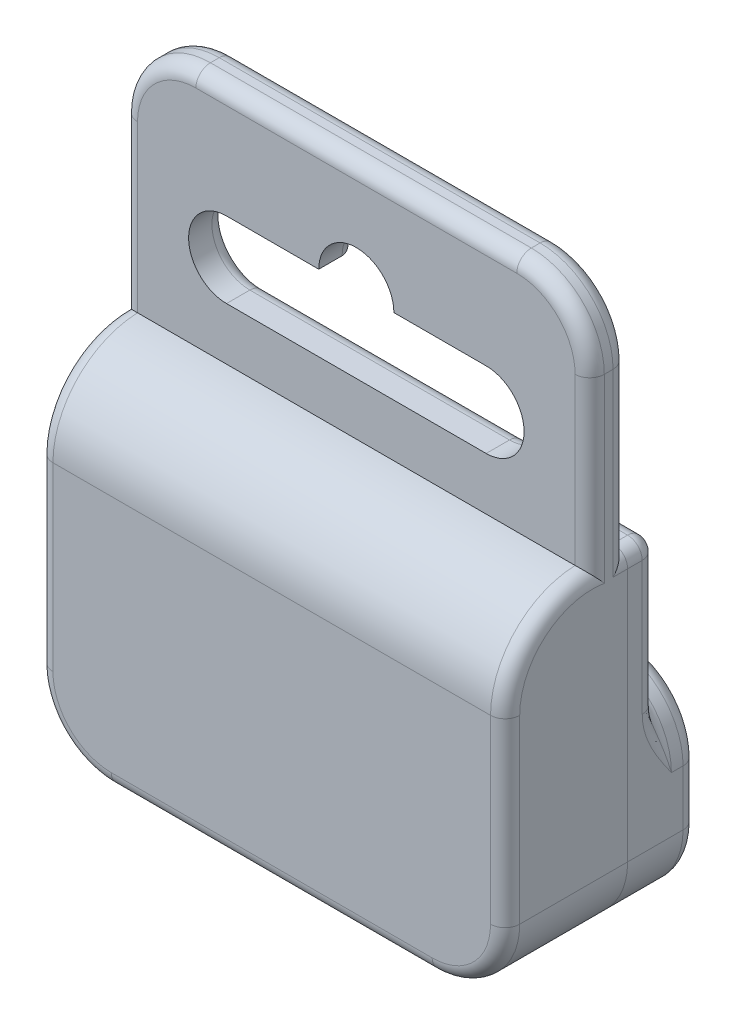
ISO-10303-21;
HEADER;
FILE_DESCRIPTION(('STEP AP214'),'2;1');
FILE_NAME('part.step','',(''),(''),'','','');
FILE_SCHEMA(('AUTOMOTIVE_DESIGN { 1 0 10303 214 1 1 1 1 }'));
ENDSEC;
DATA;
#1=APPLICATION_CONTEXT('core data for automotive mechanical design processes');
#2=APPLICATION_PROTOCOL_DEFINITION('international standard','automotive_design',2000,#1);
#3=PRODUCT_CONTEXT('',#1,'mechanical');
#4=PRODUCT('Part','Part','',(#3));
#5=PRODUCT_RELATED_PRODUCT_CATEGORY('part','',(#4));
#6=PRODUCT_DEFINITION_FORMATION('','',#4);
#7=PRODUCT_DEFINITION_CONTEXT('part definition',#1,'design');
#8=PRODUCT_DEFINITION('design','',#6,#7);
#9=PRODUCT_DEFINITION_SHAPE('','',#8);
#10=(LENGTH_UNIT() NAMED_UNIT(*) SI_UNIT(.MILLI.,.METRE.));
#11=(NAMED_UNIT(*) PLANE_ANGLE_UNIT() SI_UNIT($,.RADIAN.));
#12=(NAMED_UNIT(*) SI_UNIT($,.STERADIAN.) SOLID_ANGLE_UNIT());
#13=UNCERTAINTY_MEASURE_WITH_UNIT(LENGTH_MEASURE(1.E-05),#10,'distance_accuracy_value','');
#14=(GEOMETRIC_REPRESENTATION_CONTEXT(3) GLOBAL_UNCERTAINTY_ASSIGNED_CONTEXT((#13)) GLOBAL_UNIT_ASSIGNED_CONTEXT((#10,
#11,#12)) REPRESENTATION_CONTEXT('',''));
#15=CARTESIAN_POINT('',(0.,0.,0.));
#16=DIRECTION('',(0.,0.,1.));
#17=DIRECTION('',(1.,0.,0.));
#18=AXIS2_PLACEMENT_3D('',#15,#16,#17);
#19=CARTESIAN_POINT('',(0.,23.9695789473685,4.572));
#20=DIRECTION('',(1.,0.,0.));
#21=DIRECTION('',(0.,0.,-1.));
#22=AXIS2_PLACEMENT_3D('',#19,#20,#21);
#23=CYLINDRICAL_SURFACE('',#22,1.27);
#24=CARTESIAN_POINT('',(-13.97,23.9695789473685,4.572));
#25=DIRECTION('',(1.,0.,0.));
#26=DIRECTION('',(0.,0.,-1.));
#27=AXIS2_PLACEMENT_3D('',#24,#25,#26);
#28=CIRCLE('',#27,1.27);
#29=CARTESIAN_POINT('',(-13.97,25.2395789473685,4.572));
#30=VERTEX_POINT('',#29);
#31=CARTESIAN_POINT('',(-13.97,23.9695789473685,5.842));
#32=VERTEX_POINT('',#31);
#33=EDGE_CURVE('E451',#30,#32,#28,.T.);
#34=ORIENTED_EDGE('',*,*,#33,.T.);
#35=DIRECTION('',(-1.,0.,0.));
#36=VECTOR('',#35,1.);
#37=CARTESIAN_POINT('',(-13.97,23.9695789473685,5.842));
#38=LINE('',#37,#36);
#39=CARTESIAN_POINT('',(13.97,23.9695789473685,5.842));
#40=VERTEX_POINT('',#39);
#41=EDGE_CURVE('E415',#40,#32,#38,.T.);
#42=ORIENTED_EDGE('',*,*,#41,.F.);
#43=CARTESIAN_POINT('',(13.97,23.9695789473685,4.572));
#44=DIRECTION('',(1.,0.,0.));
#45=DIRECTION('',(0.,0.,-1.));
#46=AXIS2_PLACEMENT_3D('',#43,#44,#45);
#47=CIRCLE('',#46,1.27);
#48=CARTESIAN_POINT('',(13.97,25.2395789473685,4.572));
#49=VERTEX_POINT('',#48);
#50=EDGE_CURVE('E445',#49,#40,#47,.T.);
#51=ORIENTED_EDGE('',*,*,#50,.F.);
#52=DIRECTION('',(-1.,0.,0.));
#53=VECTOR('',#52,1.);
#54=CARTESIAN_POINT('',(13.97,25.2395789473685,4.572));
#55=LINE('',#54,#53);
#56=EDGE_CURVE('E402',#30,#49,#55,.F.);
#57=ORIENTED_EDGE('',*,*,#56,.F.);
#58=EDGE_LOOP('',(#34,#42,#51,#57));
#59=FACE_BOUND('',#58,.T.);
#60=ADVANCED_FACE('F60',(#59),#23,.T.);
#61=CARTESIAN_POINT('',(13.97,18.8895789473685,4.572));
#62=DIRECTION('',(0.,0.,1.));
#63=DIRECTION('',(1.,0.,0.));
#64=AXIS2_PLACEMENT_3D('',#61,#62,#63);
#65=TOROIDAL_SURFACE('',#64,5.08,1.27);
#66=CARTESIAN_POINT('',(19.05,18.8895789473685,4.572));
#67=DIRECTION('',(0.,1.,0.));
#68=DIRECTION('',(0.,0.,1.));
#69=AXIS2_PLACEMENT_3D('',#66,#67,#68);
#70=CIRCLE('',#69,1.27);
#71=CARTESIAN_POINT('',(19.05,18.8895789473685,5.842));
#72=VERTEX_POINT('',#71);
#73=CARTESIAN_POINT('',(20.32,18.8895789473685,4.572));
#74=VERTEX_POINT('',#73);
#75=EDGE_CURVE('E447',#72,#74,#70,.T.);
#76=ORIENTED_EDGE('',*,*,#75,.T.);
#77=CARTESIAN_POINT('',(13.97,18.8895789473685,4.572));
#78=DIRECTION('',(0.,0.,1.));
#79=DIRECTION('',(1.,0.,0.));
#80=AXIS2_PLACEMENT_3D('',#77,#78,#79);
#81=CIRCLE('',#80,6.35);
#82=EDGE_CURVE('E396',#49,#74,#81,.F.);
#83=ORIENTED_EDGE('',*,*,#82,.F.);
#84=ORIENTED_EDGE('',*,*,#50,.T.);
#85=CARTESIAN_POINT('',(13.97,18.8895789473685,5.842));
#86=DIRECTION('',(0.,0.,1.));
#87=DIRECTION('',(1.,0.,0.));
#88=AXIS2_PLACEMENT_3D('',#85,#86,#87);
#89=CIRCLE('',#88,5.08);
#90=EDGE_CURVE('E417',#72,#40,#89,.T.);
#91=ORIENTED_EDGE('',*,*,#90,.F.);
#92=EDGE_LOOP('',(#76,#83,#84,#91));
#93=FACE_BOUND('',#92,.T.);
#94=ADVANCED_FACE('F784',(#93),#65,.T.);
#95=CARTESIAN_POINT('',(-13.97,18.8895789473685,4.572));
#96=DIRECTION('',(0.,0.,1.));
#97=DIRECTION('',(1.,0.,0.));
#98=AXIS2_PLACEMENT_3D('',#95,#96,#97);
#99=TOROIDAL_SURFACE('',#98,5.08,1.27);
#100=CARTESIAN_POINT('',(-19.05,18.8895789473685,4.572));
#101=DIRECTION('',(0.,1.,0.));
#102=DIRECTION('',(0.,0.,1.));
#103=AXIS2_PLACEMENT_3D('',#100,#101,#102);
#104=CIRCLE('',#103,1.27);
#105=CARTESIAN_POINT('',(-20.32,18.8895789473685,4.572));
#106=VERTEX_POINT('',#105);
#107=CARTESIAN_POINT('',(-19.05,18.8895789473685,5.842));
#108=VERTEX_POINT('',#107);
#109=EDGE_CURVE('E438',#106,#108,#104,.T.);
#110=ORIENTED_EDGE('',*,*,#109,.T.);
#111=CARTESIAN_POINT('',(-13.97,18.8895789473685,5.842));
#112=DIRECTION('',(0.,0.,1.));
#113=DIRECTION('',(1.,0.,0.));
#114=AXIS2_PLACEMENT_3D('',#111,#112,#113);
#115=CIRCLE('',#114,5.08);
#116=EDGE_CURVE('E413',#32,#108,#115,.T.);
#117=ORIENTED_EDGE('',*,*,#116,.F.);
#118=ORIENTED_EDGE('',*,*,#33,.F.);
#119=CARTESIAN_POINT('',(-13.97,18.8895789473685,4.572));
#120=DIRECTION('',(0.,0.,1.));
#121=DIRECTION('',(1.,0.,0.));
#122=AXIS2_PLACEMENT_3D('',#119,#120,#121);
#123=CIRCLE('',#122,6.35);
#124=EDGE_CURVE('E406',#106,#30,#123,.F.);
#125=ORIENTED_EDGE('',*,*,#124,.F.);
#126=EDGE_LOOP('',(#110,#117,#118,#125));
#127=FACE_BOUND('',#126,.T.);
#128=ADVANCED_FACE('F832',(#127),#99,.T.);
#129=CARTESIAN_POINT('',(0.,0.,5.842));
#130=DIRECTION('',(0.,0.,1.));
#131=DIRECTION('',(1.,0.,0.));
#132=AXIS2_PLACEMENT_3D('',#129,#130,#131);
#133=PLANE('',#132);
#134=DIRECTION('',(1.,0.,0.));
#135=VECTOR('',#134,1.);
#136=CARTESIAN_POINT('',(0.,4.47842105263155,5.842));
#137=LINE('',#136,#135);
#138=CARTESIAN_POINT('',(-19.05,4.47842105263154,5.842));
#139=VERTEX_POINT('',#138);
#140=CARTESIAN_POINT('',(19.05,4.47842105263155,5.842));
#141=VERTEX_POINT('',#140);
#142=EDGE_CURVE('E434',#139,#141,#137,.T.);
#143=ORIENTED_EDGE('',*,*,#142,.T.);
#144=DIRECTION('',(0.,1.,0.));
#145=VECTOR('',#144,1.);
#146=CARTESIAN_POINT('',(19.05,18.8895789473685,5.842));
#147=LINE('',#146,#145);
#148=EDGE_CURVE('E420',#141,#72,#147,.T.);
#149=ORIENTED_EDGE('',*,*,#148,.T.);
#150=ORIENTED_EDGE('',*,*,#90,.T.);
#151=ORIENTED_EDGE('',*,*,#41,.T.);
#152=ORIENTED_EDGE('',*,*,#116,.T.);
#153=DIRECTION('',(0.,-1.,0.));
#154=VECTOR('',#153,1.);
#155=CARTESIAN_POINT('',(-19.05,4.47842105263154,5.842));
#156=LINE('',#155,#154);
#157=EDGE_CURVE('E411',#108,#139,#156,.T.);
#158=ORIENTED_EDGE('',*,*,#157,.T.);
#159=EDGE_LOOP('',(#143,#149,#150,#151,#152,#158));
#160=FACE_BOUND('',#159,.T.);
#161=CARTESIAN_POINT('',(0.,15.6544210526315,5.842));
#162=DIRECTION('',(0.,0.,1.));
#163=DIRECTION('',(1.,0.,0.));
#164=AXIS2_PLACEMENT_3D('',#161,#162,#163);
#165=CIRCLE('',#164,3.26971122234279);
#166=CARTESIAN_POINT('',(3.26971122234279,15.6544210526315,5.842));
#167=VERTEX_POINT('',#166);
#168=CARTESIAN_POINT('',(-3.26971122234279,15.6544210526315,5.842));
#169=VERTEX_POINT('',#168);
#170=EDGE_CURVE('E313',#167,#169,#165,.T.);
#171=ORIENTED_EDGE('',*,*,#170,.F.);
#172=DIRECTION('',(-1.,0.,0.));
#173=VECTOR('',#172,1.);
#174=CARTESIAN_POINT('',(0.,15.6544210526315,5.842));
#175=LINE('',#174,#173);
#176=CARTESIAN_POINT('',(11.303,15.6544210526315,5.842));
#177=VERTEX_POINT('',#176);
#178=EDGE_CURVE('E327',#177,#167,#175,.T.);
#179=ORIENTED_EDGE('',*,*,#178,.F.);
#180=CARTESIAN_POINT('',(11.303,12.3524210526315,5.842));
#181=DIRECTION('',(0.,0.,1.));
#182=DIRECTION('',(1.,0.,0.));
#183=AXIS2_PLACEMENT_3D('',#180,#181,#182);
#184=CIRCLE('',#183,3.302);
#185=CARTESIAN_POINT('',(11.303,9.05042105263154,5.842));
#186=VERTEX_POINT('',#185);
#187=EDGE_CURVE('E336',#186,#177,#184,.T.);
#188=ORIENTED_EDGE('',*,*,#187,.F.);
#189=DIRECTION('',(1.,0.,0.));
#190=VECTOR('',#189,1.);
#191=CARTESIAN_POINT('',(0.,9.05042105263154,5.842));
#192=LINE('',#191,#190);
#193=CARTESIAN_POINT('',(-11.303,9.05042105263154,5.842));
#194=VERTEX_POINT('',#193);
#195=EDGE_CURVE('E338',#194,#186,#192,.T.);
#196=ORIENTED_EDGE('',*,*,#195,.F.);
#197=CARTESIAN_POINT('',(-11.303,12.3524210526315,5.842));
#198=DIRECTION('',(0.,0.,1.));
#199=DIRECTION('',(1.,0.,0.));
#200=AXIS2_PLACEMENT_3D('',#197,#198,#199);
#201=CIRCLE('',#200,3.302);
#202=CARTESIAN_POINT('',(-11.303,15.6544210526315,5.842));
#203=VERTEX_POINT('',#202);
#204=EDGE_CURVE('E341',#203,#194,#201,.T.);
#205=ORIENTED_EDGE('',*,*,#204,.F.);
#206=EDGE_CURVE('E331',#169,#203,#175,.T.);
#207=ORIENTED_EDGE('',*,*,#206,.F.);
#208=EDGE_LOOP('',(#171,#179,#188,#196,#205,#207));
#209=FACE_BOUND('',#208,.T.);
#210=ADVANCED_FACE('F325',(#160,#209),#133,.T.);
#211=CARTESIAN_POINT('',(-20.32,-3.14157894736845,5.58362068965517));
#212=DIRECTION('',(1.,0.,0.));
#213=DIRECTION('',(0.,0.,-1.));
#214=AXIS2_PLACEMENT_3D('',#211,#212,#213);
#215=CYLINDRICAL_SURFACE('',#214,7.62437931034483);
#216=DIRECTION('',(1.,0.,0.));
#217=VECTOR('',#216,1.);
#218=CARTESIAN_POINT('',(-20.32,-3.14157894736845,13.208));
#219=LINE('',#218,#217);
#220=CARTESIAN_POINT('',(-19.05,-3.14157894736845,13.208));
#221=VERTEX_POINT('',#220);
#222=CARTESIAN_POINT('',(19.05,-3.14157894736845,13.208));
#223=VERTEX_POINT('',#222);
#224=EDGE_CURVE('E677',#221,#223,#219,.T.);
#225=ORIENTED_EDGE('',*,*,#224,.T.);
#226=CARTESIAN_POINT('',(19.05,-3.14157894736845,5.58362068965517));
#227=DIRECTION('',(-1.,0.,0.));
#228=DIRECTION('',(0.,-1.,0.));
#229=AXIS2_PLACEMENT_3D('',#226,#227,#228);
#230=CIRCLE('',#229,7.62437931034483);
#231=EDGE_CURVE('E752',#223,#141,#230,.T.);
#232=ORIENTED_EDGE('',*,*,#231,.T.);
#233=ORIENTED_EDGE('',*,*,#142,.F.);
#234=CARTESIAN_POINT('',(-19.05,-3.14157894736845,5.58362068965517));
#235=DIRECTION('',(1.,0.,0.));
#236=DIRECTION('',(0.,1.,0.));
#237=AXIS2_PLACEMENT_3D('',#234,#235,#236);
#238=CIRCLE('',#237,7.62437931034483);
#239=EDGE_CURVE('E755',#139,#221,#238,.T.);
#240=ORIENTED_EDGE('',*,*,#239,.T.);
#241=EDGE_LOOP('',(#225,#232,#233,#240));
#242=FACE_BOUND('',#241,.T.);
#243=ADVANCED_FACE('F564',(#242),#215,.T.);
#244=CARTESIAN_POINT('',(0.,0.,13.208));
#245=DIRECTION('',(0.,0.,1.));
#246=DIRECTION('',(1.,0.,0.));
#247=AXIS2_PLACEMENT_3D('',#244,#245,#246);
#248=PLANE('',#247);
#249=CARTESIAN_POINT('',(13.97,-18.8895789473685,13.208));
#250=DIRECTION('',(0.,0.,1.));
#251=DIRECTION('',(1.,0.,0.));
#252=AXIS2_PLACEMENT_3D('',#249,#250,#251);
#253=CIRCLE('',#252,5.08);
#254=CARTESIAN_POINT('',(13.97,-23.9695789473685,13.208));
#255=VERTEX_POINT('',#254);
#256=CARTESIAN_POINT('',(19.05,-18.8895789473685,13.208));
#257=VERTEX_POINT('',#256);
#258=EDGE_CURVE('E666',#255,#257,#253,.T.);
#259=ORIENTED_EDGE('',*,*,#258,.T.);
#260=DIRECTION('',(0.,1.,0.));
#261=VECTOR('',#260,1.);
#262=CARTESIAN_POINT('',(19.05,-3.14157894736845,13.208));
#263=LINE('',#262,#261);
#264=EDGE_CURVE('E663',#257,#223,#263,.T.);
#265=ORIENTED_EDGE('',*,*,#264,.T.);
#266=ORIENTED_EDGE('',*,*,#224,.F.);
#267=DIRECTION('',(0.,-1.,0.));
#268=VECTOR('',#267,1.);
#269=CARTESIAN_POINT('',(-19.05,-18.8895789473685,13.208));
#270=LINE('',#269,#268);
#271=CARTESIAN_POINT('',(-19.05,-18.8895789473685,13.208));
#272=VERTEX_POINT('',#271);
#273=EDGE_CURVE('E670',#221,#272,#270,.T.);
#274=ORIENTED_EDGE('',*,*,#273,.T.);
#275=CARTESIAN_POINT('',(-13.97,-18.8895789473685,13.208));
#276=DIRECTION('',(0.,0.,1.));
#277=DIRECTION('',(1.,0.,0.));
#278=AXIS2_PLACEMENT_3D('',#275,#276,#277);
#279=CIRCLE('',#278,5.08);
#280=CARTESIAN_POINT('',(-13.97,-23.9695789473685,13.208));
#281=VERTEX_POINT('',#280);
#282=EDGE_CURVE('E675',#272,#281,#279,.T.);
#283=ORIENTED_EDGE('',*,*,#282,.T.);
#284=DIRECTION('',(1.,0.,0.));
#285=VECTOR('',#284,1.);
#286=CARTESIAN_POINT('',(13.97,-23.9695789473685,13.208));
#287=LINE('',#286,#285);
#288=EDGE_CURVE('E668',#281,#255,#287,.T.);
#289=ORIENTED_EDGE('',*,*,#288,.T.);
#290=EDGE_LOOP('',(#259,#265,#266,#274,#283,#289));
#291=FACE_BOUND('',#290,.T.);
#292=ADVANCED_FACE('F567',(#291),#248,.T.);
#293=CARTESIAN_POINT('',(0.,25.2395789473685,5.842));
#294=DIRECTION('',(0.,-1.,0.));
#295=DIRECTION('',(0.,0.,-1.));
#296=AXIS2_PLACEMENT_3D('',#293,#294,#295);
#297=PLANE('',#296);
#298=DIRECTION('',(0.,0.,-1.));
#299=VECTOR('',#298,1.);
#300=CARTESIAN_POINT('',(13.97,25.2395789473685,5.842));
#301=LINE('',#300,#299);
#302=CARTESIAN_POINT('',(13.97,25.2395789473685,3.81));
#303=VERTEX_POINT('',#302);
#304=EDGE_CURVE('E362',#49,#303,#301,.T.);
#305=ORIENTED_EDGE('',*,*,#304,.T.);
#306=DIRECTION('',(-1.,0.,0.));
#307=VECTOR('',#306,1.);
#308=CARTESIAN_POINT('',(0.,25.2395789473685,3.81));
#309=LINE('',#308,#307);
#310=CARTESIAN_POINT('',(-13.97,25.2395789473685,3.81));
#311=VERTEX_POINT('',#310);
#312=EDGE_CURVE('E404',#303,#311,#309,.T.);
#313=ORIENTED_EDGE('',*,*,#312,.T.);
#314=DIRECTION('',(0.,0.,-1.));
#315=VECTOR('',#314,1.);
#316=CARTESIAN_POINT('',(-13.97,25.2395789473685,5.842));
#317=LINE('',#316,#315);
#318=EDGE_CURVE('E365',#311,#30,#317,.F.);
#319=ORIENTED_EDGE('',*,*,#318,.T.);
#320=ORIENTED_EDGE('',*,*,#56,.T.);
#321=EDGE_LOOP('',(#305,#313,#319,#320));
#322=FACE_BOUND('',#321,.T.);
#323=ADVANCED_FACE('F570',(#322),#297,.F.);
#324=CARTESIAN_POINT('',(0.,15.6544210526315,5.842));
#325=DIRECTION('',(0.,-1.,0.));
#326=DIRECTION('',(0.,0.,-1.));
#327=AXIS2_PLACEMENT_3D('',#324,#325,#326);
#328=PLANE('',#327);
#329=DIRECTION('',(0.,0.,-1.));
#330=VECTOR('',#329,1.);
#331=CARTESIAN_POINT('',(3.26971122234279,15.6544210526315,5.842));
#332=LINE('',#331,#330);
#333=CARTESIAN_POINT('',(3.26971122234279,15.6544210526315,3.81));
#334=VERTEX_POINT('',#333);
#335=EDGE_CURVE('E309',#167,#334,#332,.T.);
#336=ORIENTED_EDGE('',*,*,#335,.T.);
#337=DIRECTION('',(-1.,0.,0.));
#338=VECTOR('',#337,1.);
#339=CARTESIAN_POINT('',(11.303,15.6544210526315,3.81));
#340=LINE('',#339,#338);
#341=CARTESIAN_POINT('',(11.303,15.6544210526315,3.81));
#342=VERTEX_POINT('',#341);
#343=EDGE_CURVE('E432',#334,#342,#340,.F.);
#344=ORIENTED_EDGE('',*,*,#343,.T.);
#345=DIRECTION('',(0.,0.,-1.));
#346=VECTOR('',#345,1.);
#347=CARTESIAN_POINT('',(11.303,15.6544210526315,5.842));
#348=LINE('',#347,#346);
#349=EDGE_CURVE('E321',#177,#342,#348,.T.);
#350=ORIENTED_EDGE('',*,*,#349,.F.);
#351=ORIENTED_EDGE('',*,*,#178,.T.);
#352=EDGE_LOOP('',(#336,#344,#350,#351));
#353=FACE_BOUND('',#352,.T.);
#354=ADVANCED_FACE('F334',(#353),#328,.T.);
#355=CARTESIAN_POINT('',(11.303,12.3524210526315,5.842));
#356=DIRECTION('',(0.,0.,-1.));
#357=DIRECTION('',(-1.,0.,0.));
#358=AXIS2_PLACEMENT_3D('',#355,#356,#357);
#359=CYLINDRICAL_SURFACE('',#358,3.302);
#360=ORIENTED_EDGE('',*,*,#349,.T.);
#361=CARTESIAN_POINT('',(11.303,12.3524210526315,3.81));
#362=DIRECTION('',(0.,0.,1.));
#363=DIRECTION('',(1.,0.,0.));
#364=AXIS2_PLACEMENT_3D('',#361,#362,#363);
#365=CIRCLE('',#364,3.302);
#366=CARTESIAN_POINT('',(11.303,9.05042105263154,3.81));
#367=VERTEX_POINT('',#366);
#368=EDGE_CURVE('E429',#342,#367,#365,.F.);
#369=ORIENTED_EDGE('',*,*,#368,.T.);
#370=DIRECTION('',(0.,0.,-1.));
#371=VECTOR('',#370,1.);
#372=CARTESIAN_POINT('',(11.303,9.05042105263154,5.842));
#373=LINE('',#372,#371);
#374=EDGE_CURVE('E356',#186,#367,#373,.T.);
#375=ORIENTED_EDGE('',*,*,#374,.F.);
#376=ORIENTED_EDGE('',*,*,#187,.T.);
#377=EDGE_LOOP('',(#360,#369,#375,#376));
#378=FACE_BOUND('',#377,.T.);
#379=ADVANCED_FACE('F812',(#378),#359,.F.);
#380=CARTESIAN_POINT('',(0.,9.05042105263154,5.842));
#381=DIRECTION('',(0.,1.,0.));
#382=DIRECTION('',(0.,0.,1.));
#383=AXIS2_PLACEMENT_3D('',#380,#381,#382);
#384=PLANE('',#383);
#385=ORIENTED_EDGE('',*,*,#374,.T.);
#386=DIRECTION('',(1.,0.,0.));
#387=VECTOR('',#386,1.);
#388=CARTESIAN_POINT('',(-11.303,9.05042105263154,3.81));
#389=LINE('',#388,#387);
#390=CARTESIAN_POINT('',(-11.303,9.05042105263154,3.81));
#391=VERTEX_POINT('',#390);
#392=EDGE_CURVE('E427',#367,#391,#389,.F.);
#393=ORIENTED_EDGE('',*,*,#392,.T.);
#394=DIRECTION('',(0.,0.,-1.));
#395=VECTOR('',#394,1.);
#396=CARTESIAN_POINT('',(-11.303,9.05042105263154,5.842));
#397=LINE('',#396,#395);
#398=EDGE_CURVE('E354',#194,#391,#397,.T.);
#399=ORIENTED_EDGE('',*,*,#398,.F.);
#400=ORIENTED_EDGE('',*,*,#195,.T.);
#401=EDGE_LOOP('',(#385,#393,#399,#400));
#402=FACE_BOUND('',#401,.T.);
#403=ADVANCED_FACE('F1150',(#402),#384,.T.);
#404=CARTESIAN_POINT('',(-11.303,12.3524210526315,5.842));
#405=DIRECTION('',(0.,0.,-1.));
#406=DIRECTION('',(-1.,0.,0.));
#407=AXIS2_PLACEMENT_3D('',#404,#405,#406);
#408=CYLINDRICAL_SURFACE('',#407,3.302);
#409=ORIENTED_EDGE('',*,*,#398,.T.);
#410=CARTESIAN_POINT('',(-11.303,12.3524210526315,3.81));
#411=DIRECTION('',(0.,0.,1.));
#412=DIRECTION('',(1.,0.,0.));
#413=AXIS2_PLACEMENT_3D('',#410,#411,#412);
#414=CIRCLE('',#413,3.302);
#415=CARTESIAN_POINT('',(-11.303,15.6544210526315,3.81));
#416=VERTEX_POINT('',#415);
#417=EDGE_CURVE('E425',#391,#416,#414,.F.);
#418=ORIENTED_EDGE('',*,*,#417,.T.);
#419=DIRECTION('',(0.,0.,-1.));
#420=VECTOR('',#419,1.);
#421=CARTESIAN_POINT('',(-11.303,15.6544210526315,5.842));
#422=LINE('',#421,#420);
#423=EDGE_CURVE('E344',#203,#416,#422,.T.);
#424=ORIENTED_EDGE('',*,*,#423,.F.);
#425=ORIENTED_EDGE('',*,*,#204,.T.);
#426=EDGE_LOOP('',(#409,#418,#424,#425));
#427=FACE_BOUND('',#426,.T.);
#428=ADVANCED_FACE('F808',(#427),#408,.F.);
#429=ORIENTED_EDGE('',*,*,#423,.T.);
#430=DIRECTION('',(-1.,0.,0.));
#431=VECTOR('',#430,1.);
#432=CARTESIAN_POINT('',(-3.26971122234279,15.6544210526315,3.81));
#433=LINE('',#432,#431);
#434=CARTESIAN_POINT('',(-3.26971122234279,15.6544210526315,3.81));
#435=VERTEX_POINT('',#434);
#436=EDGE_CURVE('E422',#416,#435,#433,.F.);
#437=ORIENTED_EDGE('',*,*,#436,.T.);
#438=DIRECTION('',(0.,0.,-1.));
#439=VECTOR('',#438,1.);
#440=CARTESIAN_POINT('',(-3.26971122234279,15.6544210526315,5.842));
#441=LINE('',#440,#439);
#442=EDGE_CURVE('E340',#169,#435,#441,.T.);
#443=ORIENTED_EDGE('',*,*,#442,.F.);
#444=ORIENTED_EDGE('',*,*,#206,.T.);
#445=EDGE_LOOP('',(#429,#437,#443,#444));
#446=FACE_BOUND('',#445,.T.);
#447=ADVANCED_FACE('F803',(#446),#328,.T.);
#448=CARTESIAN_POINT('',(0.,15.6544210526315,5.842));
#449=DIRECTION('',(0.,0.,-1.));
#450=DIRECTION('',(-1.,0.,0.));
#451=AXIS2_PLACEMENT_3D('',#448,#449,#450);
#452=CYLINDRICAL_SURFACE('',#451,3.26971122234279);
#453=ORIENTED_EDGE('',*,*,#442,.T.);
#454=CARTESIAN_POINT('',(0.,15.6544210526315,3.81));
#455=DIRECTION('',(0.,0.,1.));
#456=DIRECTION('',(1.,0.,0.));
#457=AXIS2_PLACEMENT_3D('',#454,#455,#456);
#458=CIRCLE('',#457,3.26971122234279);
#459=EDGE_CURVE('E316',#435,#334,#458,.F.);
#460=ORIENTED_EDGE('',*,*,#459,.T.);
#461=ORIENTED_EDGE('',*,*,#335,.F.);
#462=ORIENTED_EDGE('',*,*,#170,.T.);
#463=EDGE_LOOP('',(#453,#460,#461,#462));
#464=FACE_BOUND('',#463,.T.);
#465=ADVANCED_FACE('F312',(#464),#452,.F.);
#466=CARTESIAN_POINT('',(19.05,0.,11.938));
#467=DIRECTION('',(0.,-1.,0.));
#468=DIRECTION('',(1.,0.,0.));
#469=AXIS2_PLACEMENT_3D('',#466,#467,#468);
#470=CYLINDRICAL_SURFACE('',#469,1.27);
#471=CARTESIAN_POINT('',(19.05,-18.8895789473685,11.938));
#472=DIRECTION('',(0.,1.,0.));
#473=DIRECTION('',(0.,0.,1.));
#474=AXIS2_PLACEMENT_3D('',#471,#472,#473);
#475=CIRCLE('',#474,1.27);
#476=CARTESIAN_POINT('',(20.32,-18.8895789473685,11.938));
#477=VERTEX_POINT('',#476);
#478=EDGE_CURVE('E514',#257,#477,#475,.T.);
#479=ORIENTED_EDGE('',*,*,#478,.T.);
#480=DIRECTION('',(0.,1.,0.));
#481=VECTOR('',#480,1.);
#482=CARTESIAN_POINT('',(20.32,-18.8895789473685,11.938));
#483=LINE('',#482,#481);
#484=CARTESIAN_POINT('',(20.32,-3.14157894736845,11.938));
#485=VERTEX_POINT('',#484);
#486=EDGE_CURVE('E757',#485,#477,#483,.F.);
#487=ORIENTED_EDGE('',*,*,#486,.F.);
#488=CARTESIAN_POINT('',(19.05,-3.14157894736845,11.938));
#489=DIRECTION('',(0.,1.,0.));
#490=DIRECTION('',(0.,0.,1.));
#491=AXIS2_PLACEMENT_3D('',#488,#489,#490);
#492=CIRCLE('',#491,1.27);
#493=EDGE_CURVE('E526',#223,#485,#492,.T.);
#494=ORIENTED_EDGE('',*,*,#493,.F.);
#495=ORIENTED_EDGE('',*,*,#264,.F.);
#496=EDGE_LOOP('',(#479,#487,#494,#495));
#497=FACE_BOUND('',#496,.T.);
#498=ADVANCED_FACE('F539',(#497),#470,.T.);
#499=CARTESIAN_POINT('',(19.05,-3.14157894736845,5.58362068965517));
#500=DIRECTION('',(-1.,0.,0.));
#501=DIRECTION('',(0.,-1.,0.));
#502=AXIS2_PLACEMENT_3D('',#499,#500,#501);
#503=TOROIDAL_SURFACE('',#502,6.35437931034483,1.27);
#504=ORIENTED_EDGE('',*,*,#493,.T.);
#505=CARTESIAN_POINT('',(20.32,-3.14157894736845,5.58362068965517));
#506=DIRECTION('',(-1.,0.,0.));
#507=DIRECTION('',(0.,-1.,0.));
#508=AXIS2_PLACEMENT_3D('',#505,#506,#507);
#509=CIRCLE('',#508,6.35437931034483);
#510=CARTESIAN_POINT('',(20.32,3.13175828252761,4.572));
#511=VERTEX_POINT('',#510);
#512=EDGE_CURVE('E689',#511,#485,#509,.F.);
#513=ORIENTED_EDGE('',*,*,#512,.F.);
#514=CARTESIAN_POINT('',(19.05,4.47842105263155,5.842));
#515=CARTESIAN_POINT('',(19.0785618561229,4.47842394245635,5.84200357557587));
#516=CARTESIAN_POINT('',(19.107106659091,4.47748887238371,5.84103562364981));
#517=CARTESIAN_POINT('',(19.1639290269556,4.47377933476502,5.83719932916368));
#518=CARTESIAN_POINT('',(19.1922067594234,4.47100611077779,5.83433227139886));
#519=CARTESIAN_POINT('',(19.275863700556,4.46004546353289,5.82300991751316));
#520=CARTESIAN_POINT('',(19.3305669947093,4.44921560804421,5.8118317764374));
#521=CARTESIAN_POINT('',(19.4363329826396,4.42123855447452,5.78305467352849));
#522=CARTESIAN_POINT('',(19.4874037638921,4.4041059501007,5.76547054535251));
#523=CARTESIAN_POINT('',(19.585203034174,4.36443506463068,5.72493863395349));
#524=CARTESIAN_POINT('',(19.6319226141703,4.34188601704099,5.70198017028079));
#525=CARTESIAN_POINT('',(19.7369274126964,4.28311372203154,5.64246931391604));
#526=CARTESIAN_POINT('',(19.7930450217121,4.24492474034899,5.60403778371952));
#527=CARTESIAN_POINT('',(19.8958148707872,4.16231457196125,5.52165954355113));
#528=CARTESIAN_POINT('',(19.9424502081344,4.11788249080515,5.47770320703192));
#529=CARTESIAN_POINT('',(20.0432490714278,4.00600892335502,5.36816022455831));
#530=CARTESIAN_POINT('',(20.0931422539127,3.93639794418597,5.3008734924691));
#531=CARTESIAN_POINT('',(20.1770687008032,3.79132027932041,5.16289332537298));
#532=CARTESIAN_POINT('',(20.2110766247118,3.7158444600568,5.09219464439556));
#533=CARTESIAN_POINT('',(20.2659807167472,3.55800062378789,4.94690718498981));
#534=CARTESIAN_POINT('',(20.2863048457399,3.47547806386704,4.87227516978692));
#535=CARTESIAN_POINT('',(20.3131645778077,3.30792799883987,4.72366800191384));
#536=CARTESIAN_POINT('',(20.3197241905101,3.22290511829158,4.64969192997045));
#537=CARTESIAN_POINT('',(20.3199971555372,3.13539867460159,4.57510105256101));
#538=CARTESIAN_POINT('',(20.319999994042,3.1335786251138,4.57355031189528));
#539=CARTESIAN_POINT('',(20.32,3.13175828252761,4.572));
#540=B_SPLINE_CURVE_WITH_KNOTS('',3,(#514,#515,#516,#517,#518,#519,#520,#521,#522,#523,#524,
#525,#526,#527,#528,#529,#530,#531,#532,#533,#534,#535,#536,#537,#538,#539),.UNSPECIFIED.,.F.,
.F.,(4,2,2,2,2,2,2,2,2,2,2,2,4),(0.,0.0856214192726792,0.171184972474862,0.340834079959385,
0.510092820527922,0.679690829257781,0.912414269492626,1.14554898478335,1.47051457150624,
1.79599679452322,2.13435748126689,2.47212746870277,2.47930077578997),.UNSPECIFIED.);
#541=EDGE_CURVE('E549',#141,#511,#540,.T.);
#542=ORIENTED_EDGE('',*,*,#541,.F.);
#543=ORIENTED_EDGE('',*,*,#231,.F.);
#544=EDGE_LOOP('',(#504,#513,#542,#543));
#545=FACE_BOUND('',#544,.T.);
#546=ADVANCED_FACE('F541',(#545),#503,.T.);
#547=CARTESIAN_POINT('',(19.05,0.,4.572));
#548=DIRECTION('',(0.,-1.,0.));
#549=DIRECTION('',(1.,0.,0.));
#550=AXIS2_PLACEMENT_3D('',#547,#548,#549);
#551=CYLINDRICAL_SURFACE('',#550,1.27);
#552=DIRECTION('',(0.,1.,0.));
#553=VECTOR('',#552,1.);
#554=CARTESIAN_POINT('',(20.32,4.47842105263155,4.572));
#555=LINE('',#554,#553);
#556=EDGE_CURVE('E686',#74,#511,#555,.F.);
#557=ORIENTED_EDGE('',*,*,#556,.F.);
#558=ORIENTED_EDGE('',*,*,#75,.F.);
#559=ORIENTED_EDGE('',*,*,#148,.F.);
#560=ORIENTED_EDGE('',*,*,#541,.T.);
#561=EDGE_LOOP('',(#557,#558,#559,#560));
#562=FACE_BOUND('',#561,.T.);
#563=ADVANCED_FACE('F545',(#562),#551,.T.);
#564=CARTESIAN_POINT('',(13.97,18.8895789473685,5.842));
#565=DIRECTION('',(0.,0.,-1.));
#566=DIRECTION('',(-1.,0.,0.));
#567=AXIS2_PLACEMENT_3D('',#564,#565,#566);
#568=CYLINDRICAL_SURFACE('',#567,6.35);
#569=DIRECTION('',(0.,0.,-1.));
#570=VECTOR('',#569,1.);
#571=CARTESIAN_POINT('',(20.32,18.8895789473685,13.208));
#572=LINE('',#571,#570);
#573=CARTESIAN_POINT('',(20.32,18.8895789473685,3.81));
#574=VERTEX_POINT('',#573);
#575=EDGE_CURVE('E368',#574,#74,#572,.F.);
#576=ORIENTED_EDGE('',*,*,#575,.F.);
#577=CARTESIAN_POINT('',(13.97,18.8895789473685,3.81));
#578=DIRECTION('',(0.,0.,1.));
#579=DIRECTION('',(1.,0.,0.));
#580=AXIS2_PLACEMENT_3D('',#577,#578,#579);
#581=CIRCLE('',#580,6.35);
#582=EDGE_CURVE('E399',#574,#303,#581,.T.);
#583=ORIENTED_EDGE('',*,*,#582,.T.);
#584=ORIENTED_EDGE('',*,*,#304,.F.);
#585=ORIENTED_EDGE('',*,*,#82,.T.);
#586=EDGE_LOOP('',(#576,#583,#584,#585));
#587=FACE_BOUND('',#586,.T.);
#588=ADVANCED_FACE('F562',(#587),#568,.T.);
#589=CARTESIAN_POINT('',(-13.97,18.8895789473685,13.208));
#590=DIRECTION('',(0.,0.,-1.));
#591=DIRECTION('',(-1.,0.,0.));
#592=AXIS2_PLACEMENT_3D('',#589,#590,#591);
#593=CYLINDRICAL_SURFACE('',#592,6.35);
#594=ORIENTED_EDGE('',*,*,#318,.F.);
#595=CARTESIAN_POINT('',(-13.97,18.8895789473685,3.81));
#596=DIRECTION('',(0.,0.,1.));
#597=DIRECTION('',(1.,0.,0.));
#598=AXIS2_PLACEMENT_3D('',#595,#596,#597);
#599=CIRCLE('',#598,6.35);
#600=CARTESIAN_POINT('',(-20.32,18.8895789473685,3.81));
#601=VERTEX_POINT('',#600);
#602=EDGE_CURVE('E408',#311,#601,#599,.T.);
#603=ORIENTED_EDGE('',*,*,#602,.T.);
#604=DIRECTION('',(0.,0.,-1.));
#605=VECTOR('',#604,1.);
#606=CARTESIAN_POINT('',(-20.32,18.8895789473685,13.208));
#607=LINE('',#606,#605);
#608=EDGE_CURVE('E320',#106,#601,#607,.T.);
#609=ORIENTED_EDGE('',*,*,#608,.F.);
#610=ORIENTED_EDGE('',*,*,#124,.T.);
#611=EDGE_LOOP('',(#594,#603,#609,#610));
#612=FACE_BOUND('',#611,.T.);
#613=ADVANCED_FACE('F814',(#612),#593,.T.);
#614=CARTESIAN_POINT('',(-19.05,0.,4.572));
#615=DIRECTION('',(0.,1.,0.));
#616=DIRECTION('',(-1.,0.,0.));
#617=AXIS2_PLACEMENT_3D('',#614,#615,#616);
#618=CYLINDRICAL_SURFACE('',#617,1.27);
#619=CARTESIAN_POINT('',(-19.05,4.47842105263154,5.842));
#620=CARTESIAN_POINT('',(-19.0785618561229,4.47842394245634,5.84200357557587));
#621=CARTESIAN_POINT('',(-19.107106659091,4.47748887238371,5.84103562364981));
#622=CARTESIAN_POINT('',(-19.1639290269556,4.47377933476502,5.83719932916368));
#623=CARTESIAN_POINT('',(-19.1922067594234,4.47100611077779,5.83433227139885));
#624=CARTESIAN_POINT('',(-19.275863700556,4.46004546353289,5.82300991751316));
#625=CARTESIAN_POINT('',(-19.3305669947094,4.44921560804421,5.8118317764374));
#626=CARTESIAN_POINT('',(-19.4363329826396,4.42123855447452,5.78305467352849));
#627=CARTESIAN_POINT('',(-19.4874037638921,4.4041059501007,5.76547054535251));
#628=CARTESIAN_POINT('',(-19.585203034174,4.36443506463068,5.72493863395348));
#629=CARTESIAN_POINT('',(-19.6319226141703,4.34188601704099,5.70198017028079));
#630=CARTESIAN_POINT('',(-19.7369274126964,4.28311372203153,5.64246931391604));
#631=CARTESIAN_POINT('',(-19.7930450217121,4.24492474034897,5.60403778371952));
#632=CARTESIAN_POINT('',(-19.8958148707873,4.16231457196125,5.52165954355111));
#633=CARTESIAN_POINT('',(-19.9424502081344,4.11788249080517,5.47770320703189));
#634=CARTESIAN_POINT('',(-20.0432490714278,4.00600892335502,5.36816022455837));
#635=CARTESIAN_POINT('',(-20.0931422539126,3.9363979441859,5.30087349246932));
#636=CARTESIAN_POINT('',(-20.1770687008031,3.79132027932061,5.16289332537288));
#637=CARTESIAN_POINT('',(-20.2110766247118,3.71584446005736,5.09219464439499));
#638=CARTESIAN_POINT('',(-20.2659807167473,3.55800062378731,4.94690718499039));
#639=CARTESIAN_POINT('',(-20.2863048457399,3.47547806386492,4.8722751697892));
#640=CARTESIAN_POINT('',(-20.3131645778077,3.30792799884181,4.72366800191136));
#641=CARTESIAN_POINT('',(-20.3197241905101,3.22290511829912,4.64969192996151));
#642=CARTESIAN_POINT('',(-20.3199971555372,3.13539867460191,4.57510105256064));
#643=CARTESIAN_POINT('',(-20.319999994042,3.13357862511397,4.57355031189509));
#644=CARTESIAN_POINT('',(-20.32,3.13175828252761,4.572));
#645=B_SPLINE_CURVE_WITH_KNOTS('',3,(#619,#620,#621,#622,#623,#624,#625,#626,#627,#628,#629,
#630,#631,#632,#633,#634,#635,#636,#637,#638,#639,#640,#641,#642,#643,#644),.UNSPECIFIED.,.F.,
.F.,(4,2,2,2,2,2,2,2,2,2,2,2,4),(0.,0.0856214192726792,0.171184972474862,0.340834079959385,
0.510092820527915,0.679690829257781,0.912414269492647,1.14554898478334,1.4705145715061,
1.79599679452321,2.1343574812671,2.47212746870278,2.47930077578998),.UNSPECIFIED.);
#646=CARTESIAN_POINT('',(-20.32,3.13175828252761,4.572));
#647=VERTEX_POINT('',#646);
#648=EDGE_CURVE('E517',#647,#139,#645,.F.);
#649=ORIENTED_EDGE('',*,*,#648,.T.);
#650=ORIENTED_EDGE('',*,*,#157,.F.);
#651=ORIENTED_EDGE('',*,*,#109,.F.);
#652=DIRECTION('',(0.,-1.,0.));
#653=VECTOR('',#652,1.);
#654=CARTESIAN_POINT('',(-20.32,18.8895789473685,4.572));
#655=LINE('',#654,#653);
#656=EDGE_CURVE('E654',#647,#106,#655,.F.);
#657=ORIENTED_EDGE('',*,*,#656,.F.);
#658=EDGE_LOOP('',(#649,#650,#651,#657));
#659=FACE_BOUND('',#658,.T.);
#660=ADVANCED_FACE('F528',(#659),#618,.T.);
#661=CARTESIAN_POINT('',(-19.05,-3.14157894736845,5.58362068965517));
#662=DIRECTION('',(1.,0.,0.));
#663=DIRECTION('',(0.,1.,0.));
#664=AXIS2_PLACEMENT_3D('',#661,#662,#663);
#665=TOROIDAL_SURFACE('',#664,6.35437931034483,1.27);
#666=CARTESIAN_POINT('',(-19.05,-3.14157894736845,11.938));
#667=DIRECTION('',(0.,1.,0.));
#668=DIRECTION('',(0.,0.,1.));
#669=AXIS2_PLACEMENT_3D('',#666,#667,#668);
#670=CIRCLE('',#669,1.27);
#671=CARTESIAN_POINT('',(-20.32,-3.14157894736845,11.938));
#672=VERTEX_POINT('',#671);
#673=EDGE_CURVE('E511',#672,#221,#670,.T.);
#674=ORIENTED_EDGE('',*,*,#673,.T.);
#675=ORIENTED_EDGE('',*,*,#239,.F.);
#676=ORIENTED_EDGE('',*,*,#648,.F.);
#677=CARTESIAN_POINT('',(-20.32,-3.14157894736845,5.58362068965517));
#678=DIRECTION('',(1.,0.,0.));
#679=DIRECTION('',(0.,1.,0.));
#680=AXIS2_PLACEMENT_3D('',#677,#678,#679);
#681=CIRCLE('',#680,6.35437931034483);
#682=EDGE_CURVE('E681',#672,#647,#681,.F.);
#683=ORIENTED_EDGE('',*,*,#682,.F.);
#684=EDGE_LOOP('',(#674,#675,#676,#683));
#685=FACE_BOUND('',#684,.T.);
#686=ADVANCED_FACE('F532',(#685),#665,.T.);
#687=CARTESIAN_POINT('',(-19.05,0.,11.938));
#688=DIRECTION('',(0.,1.,0.));
#689=DIRECTION('',(-1.,0.,0.));
#690=AXIS2_PLACEMENT_3D('',#687,#688,#689);
#691=CYLINDRICAL_SURFACE('',#690,1.27);
#692=CARTESIAN_POINT('',(-19.05,-18.8895789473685,11.938));
#693=DIRECTION('',(0.,1.,0.));
#694=DIRECTION('',(0.,0.,1.));
#695=AXIS2_PLACEMENT_3D('',#692,#693,#694);
#696=CIRCLE('',#695,1.27);
#697=CARTESIAN_POINT('',(-20.32,-18.8895789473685,11.938));
#698=VERTEX_POINT('',#697);
#699=EDGE_CURVE('E504',#698,#272,#696,.T.);
#700=ORIENTED_EDGE('',*,*,#699,.T.);
#701=ORIENTED_EDGE('',*,*,#273,.F.);
#702=ORIENTED_EDGE('',*,*,#673,.F.);
#703=DIRECTION('',(0.,-1.,0.));
#704=VECTOR('',#703,1.);
#705=CARTESIAN_POINT('',(-20.32,-3.14157894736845,11.938));
#706=LINE('',#705,#704);
#707=EDGE_CURVE('E685',#698,#672,#706,.F.);
#708=ORIENTED_EDGE('',*,*,#707,.F.);
#709=EDGE_LOOP('',(#700,#701,#702,#708));
#710=FACE_BOUND('',#709,.T.);
#711=ADVANCED_FACE('F537',(#710),#691,.T.);
#712=CARTESIAN_POINT('',(0.,-23.9695789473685,11.938));
#713=DIRECTION('',(-1.,0.,0.));
#714=DIRECTION('',(0.,-1.,0.));
#715=AXIS2_PLACEMENT_3D('',#712,#713,#714);
#716=CYLINDRICAL_SURFACE('',#715,1.27);
#717=CARTESIAN_POINT('',(-13.97,-23.9695789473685,11.938));
#718=DIRECTION('',(1.,0.,0.));
#719=DIRECTION('',(0.,0.,-1.));
#720=AXIS2_PLACEMENT_3D('',#717,#718,#719);
#721=CIRCLE('',#720,1.27);
#722=CARTESIAN_POINT('',(-13.97,-25.2395789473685,11.938));
#723=VERTEX_POINT('',#722);
#724=EDGE_CURVE('E501',#281,#723,#721,.T.);
#725=ORIENTED_EDGE('',*,*,#724,.T.);
#726=DIRECTION('',(1.,0.,0.));
#727=VECTOR('',#726,1.);
#728=CARTESIAN_POINT('',(-13.97,-25.2395789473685,11.938));
#729=LINE('',#728,#727);
#730=CARTESIAN_POINT('',(13.97,-25.2395789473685,11.938));
#731=VERTEX_POINT('',#730);
#732=EDGE_CURVE('E613',#731,#723,#729,.F.);
#733=ORIENTED_EDGE('',*,*,#732,.F.);
#734=CARTESIAN_POINT('',(13.97,-23.9695789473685,11.938));
#735=DIRECTION('',(1.,0.,0.));
#736=DIRECTION('',(0.,0.,-1.));
#737=AXIS2_PLACEMENT_3D('',#734,#735,#736);
#738=CIRCLE('',#737,1.27);
#739=EDGE_CURVE('E508',#255,#731,#738,.T.);
#740=ORIENTED_EDGE('',*,*,#739,.F.);
#741=ORIENTED_EDGE('',*,*,#288,.F.);
#742=EDGE_LOOP('',(#725,#733,#740,#741));
#743=FACE_BOUND('',#742,.T.);
#744=ADVANCED_FACE('F659',(#743),#716,.T.);
#745=CARTESIAN_POINT('',(13.97,-18.8895789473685,11.938));
#746=DIRECTION('',(0.,0.,1.));
#747=DIRECTION('',(1.,0.,0.));
#748=AXIS2_PLACEMENT_3D('',#745,#746,#747);
#749=TOROIDAL_SURFACE('',#748,5.08,1.27);
#750=ORIENTED_EDGE('',*,*,#739,.T.);
#751=CARTESIAN_POINT('',(13.97,-18.8895789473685,11.938));
#752=DIRECTION('',(0.,0.,1.));
#753=DIRECTION('',(1.,0.,0.));
#754=AXIS2_PLACEMENT_3D('',#751,#752,#753);
#755=CIRCLE('',#754,6.35);
#756=EDGE_CURVE('E650',#477,#731,#755,.F.);
#757=ORIENTED_EDGE('',*,*,#756,.F.);
#758=ORIENTED_EDGE('',*,*,#478,.F.);
#759=ORIENTED_EDGE('',*,*,#258,.F.);
#760=EDGE_LOOP('',(#750,#757,#758,#759));
#761=FACE_BOUND('',#760,.T.);
#762=ADVANCED_FACE('F580',(#761),#749,.T.);
#763=CARTESIAN_POINT('',(20.32,0.,13.208));
#764=DIRECTION('',(-1.,0.,0.));
#765=DIRECTION('',(0.,-1.,0.));
#766=AXIS2_PLACEMENT_3D('',#763,#764,#765);
#767=PLANE('',#766);
#768=DIRECTION('',(0.,0.,-1.));
#769=VECTOR('',#768,1.);
#770=CARTESIAN_POINT('',(20.32,-18.8895789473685,13.208));
#771=LINE('',#770,#769);
#772=CARTESIAN_POINT('',(20.32,-18.8895789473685,2.54));
#773=VERTEX_POINT('',#772);
#774=EDGE_CURVE('E617',#477,#773,#771,.T.);
#775=ORIENTED_EDGE('',*,*,#774,.T.);
#776=DIRECTION('',(0.,1.,0.));
#777=VECTOR('',#776,1.);
#778=CARTESIAN_POINT('',(20.32,0.,2.54));
#779=LINE('',#778,#777);
#780=CARTESIAN_POINT('',(20.32,3.20842105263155,2.54));
#781=VERTEX_POINT('',#780);
#782=EDGE_CURVE('E641',#773,#781,#779,.T.);
#783=ORIENTED_EDGE('',*,*,#782,.T.);
#784=DIRECTION('',(0.,0.,-1.));
#785=VECTOR('',#784,1.);
#786=CARTESIAN_POINT('',(20.32,3.20842105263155,2.54));
#787=LINE('',#786,#785);
#788=CARTESIAN_POINT('',(20.32,3.20842105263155,3.81));
#789=VERTEX_POINT('',#788);
#790=EDGE_CURVE('E664',#781,#789,#787,.F.);
#791=ORIENTED_EDGE('',*,*,#790,.T.);
#792=DIRECTION('',(0.,1.,0.));
#793=VECTOR('',#792,1.);
#794=CARTESIAN_POINT('',(20.32,0.,3.81));
#795=LINE('',#794,#793);
#796=EDGE_CURVE('E688',#789,#574,#795,.T.);
#797=ORIENTED_EDGE('',*,*,#796,.T.);
#798=ORIENTED_EDGE('',*,*,#575,.T.);
#799=ORIENTED_EDGE('',*,*,#556,.T.);
#800=ORIENTED_EDGE('',*,*,#512,.T.);
#801=ORIENTED_EDGE('',*,*,#486,.T.);
#802=EDGE_LOOP('',(#775,#783,#791,#797,#798,#799,#800,#801));
#803=FACE_BOUND('',#802,.T.);
#804=ADVANCED_FACE('F574',(#803),#767,.F.);
#805=CARTESIAN_POINT('',(19.05,3.20842105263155,13.208));
#806=DIRECTION('',(0.,0.,1.));
#807=DIRECTION('',(1.,0.,0.));
#808=AXIS2_PLACEMENT_3D('',#805,#806,#807);
#809=CYLINDRICAL_SURFACE('',#808,1.27);
#810=CARTESIAN_POINT('',(19.05,3.20842105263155,2.54));
#811=DIRECTION('',(0.,0.,1.));
#812=DIRECTION('',(1.,0.,0.));
#813=AXIS2_PLACEMENT_3D('',#810,#811,#812);
#814=CIRCLE('',#813,1.27);
#815=CARTESIAN_POINT('',(19.05,4.47842105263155,2.54));
#816=VERTEX_POINT('',#815);
#817=EDGE_CURVE('E85',#816,#781,#814,.F.);
#818=ORIENTED_EDGE('',*,*,#817,.F.);
#819=CARTESIAN_POINT('',(19.05,3.20842105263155,3.81));
#820=DIRECTION('',(0.,0.707106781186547,0.707106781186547));
#821=DIRECTION('',(0.,0.707106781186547,-0.707106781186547));
#822=AXIS2_PLACEMENT_3D('',#819,#820,#821);
#823=ELLIPSE('',#822,1.79605122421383,1.27);
#824=EDGE_CURVE('E505',#789,#816,#823,.T.);
#825=ORIENTED_EDGE('',*,*,#824,.F.);
#826=ORIENTED_EDGE('',*,*,#790,.F.);
#827=EDGE_LOOP('',(#818,#825,#826));
#828=FACE_BOUND('',#827,.T.);
#829=ADVANCED_FACE('F572',(#828),#809,.T.);
#830=CARTESIAN_POINT('',(-19.05,3.20842105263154,13.208));
#831=DIRECTION('',(0.,0.,1.));
#832=DIRECTION('',(1.,0.,0.));
#833=AXIS2_PLACEMENT_3D('',#830,#831,#832);
#834=CYLINDRICAL_SURFACE('',#833,1.27);
#835=CARTESIAN_POINT('',(-19.05,3.20842105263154,2.54));
#836=DIRECTION('',(0.,0.,1.));
#837=DIRECTION('',(1.,0.,0.));
#838=AXIS2_PLACEMENT_3D('',#835,#836,#837);
#839=CIRCLE('',#838,1.27);
#840=CARTESIAN_POINT('',(-20.32,3.20842105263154,2.54));
#841=VERTEX_POINT('',#840);
#842=CARTESIAN_POINT('',(-19.05,4.47842105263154,2.54));
#843=VERTEX_POINT('',#842);
#844=EDGE_CURVE('E77',#841,#843,#839,.F.);
#845=ORIENTED_EDGE('',*,*,#844,.F.);
#846=DIRECTION('',(0.,0.,-1.));
#847=VECTOR('',#846,1.);
#848=CARTESIAN_POINT('',(-20.32,3.20842105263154,0.));
#849=LINE('',#848,#847);
#850=CARTESIAN_POINT('',(-20.32,3.20842105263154,3.81));
#851=VERTEX_POINT('',#850);
#852=EDGE_CURVE('E684',#851,#841,#849,.T.);
#853=ORIENTED_EDGE('',*,*,#852,.F.);
#854=CARTESIAN_POINT('',(-19.05,3.20842105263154,3.81));
#855=DIRECTION('',(0.,0.707106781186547,0.707106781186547));
#856=DIRECTION('',(0.,-0.707106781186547,0.707106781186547));
#857=AXIS2_PLACEMENT_3D('',#854,#855,#856);
#858=ELLIPSE('',#857,1.79605122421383,1.27);
#859=EDGE_CURVE('E557',#843,#851,#858,.T.);
#860=ORIENTED_EDGE('',*,*,#859,.F.);
#861=EDGE_LOOP('',(#845,#853,#860));
#862=FACE_BOUND('',#861,.T.);
#863=ADVANCED_FACE('F547',(#862),#834,.T.);
#864=CARTESIAN_POINT('',(-20.32,0.,13.208));
#865=DIRECTION('',(1.,0.,0.));
#866=DIRECTION('',(0.,1.,0.));
#867=AXIS2_PLACEMENT_3D('',#864,#865,#866);
#868=PLANE('',#867);
#869=ORIENTED_EDGE('',*,*,#852,.T.);
#870=DIRECTION('',(0.,-1.,0.));
#871=VECTOR('',#870,1.);
#872=CARTESIAN_POINT('',(-20.32,0.,2.54));
#873=LINE('',#872,#871);
#874=CARTESIAN_POINT('',(-20.32,-18.8895789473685,2.54));
#875=VERTEX_POINT('',#874);
#876=EDGE_CURVE('E639',#841,#875,#873,.T.);
#877=ORIENTED_EDGE('',*,*,#876,.T.);
#878=DIRECTION('',(0.,0.,-1.));
#879=VECTOR('',#878,1.);
#880=CARTESIAN_POINT('',(-20.32,-18.8895789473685,13.208));
#881=LINE('',#880,#879);
#882=EDGE_CURVE('E623',#875,#698,#881,.F.);
#883=ORIENTED_EDGE('',*,*,#882,.T.);
#884=ORIENTED_EDGE('',*,*,#707,.T.);
#885=ORIENTED_EDGE('',*,*,#682,.T.);
#886=ORIENTED_EDGE('',*,*,#656,.T.);
#887=ORIENTED_EDGE('',*,*,#608,.T.);
#888=DIRECTION('',(0.,-1.,0.));
#889=VECTOR('',#888,1.);
#890=CARTESIAN_POINT('',(-20.32,0.,3.81));
#891=LINE('',#890,#889);
#892=EDGE_CURVE('E682',#601,#851,#891,.T.);
#893=ORIENTED_EDGE('',*,*,#892,.T.);
#894=EDGE_LOOP('',(#869,#877,#883,#884,#885,#886,#887,#893));
#895=FACE_BOUND('',#894,.T.);
#896=ADVANCED_FACE('F62',(#895),#868,.F.);
#897=CARTESIAN_POINT('',(19.05,0.,3.81));
#898=DIRECTION('',(0.,1.,0.));
#899=DIRECTION('',(-1.,0.,0.));
#900=AXIS2_PLACEMENT_3D('',#897,#898,#899);
#901=CYLINDRICAL_SURFACE('',#900,1.27);
#902=ORIENTED_EDGE('',*,*,#824,.T.);
#903=DIRECTION('',(0.,1.,0.));
#904=VECTOR('',#903,1.);
#905=CARTESIAN_POINT('',(19.05,0.,2.54));
#906=LINE('',#905,#904);
#907=CARTESIAN_POINT('',(19.05,18.8895789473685,2.54));
#908=VERTEX_POINT('',#907);
#909=EDGE_CURVE('E393',#908,#816,#906,.F.);
#910=ORIENTED_EDGE('',*,*,#909,.F.);
#911=CARTESIAN_POINT('',(19.05,18.8895789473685,3.81));
#912=DIRECTION('',(0.,1.,0.));
#913=DIRECTION('',(0.,0.,1.));
#914=AXIS2_PLACEMENT_3D('',#911,#912,#913);
#915=CIRCLE('',#914,1.27);
#916=EDGE_CURVE('E435',#574,#908,#915,.T.);
#917=ORIENTED_EDGE('',*,*,#916,.F.);
#918=ORIENTED_EDGE('',*,*,#796,.F.);
#919=EDGE_LOOP('',(#902,#910,#917,#918));
#920=FACE_BOUND('',#919,.T.);
#921=ADVANCED_FACE('F765',(#920),#901,.T.);
#922=CARTESIAN_POINT('',(13.97,18.8895789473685,3.81));
#923=DIRECTION('',(0.,0.,1.));
#924=DIRECTION('',(1.,0.,0.));
#925=AXIS2_PLACEMENT_3D('',#922,#923,#924);
#926=TOROIDAL_SURFACE('',#925,5.08,1.27);
#927=CARTESIAN_POINT('',(13.97,23.9695789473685,3.81));
#928=DIRECTION('',(1.,0.,0.));
#929=DIRECTION('',(0.,0.,-1.));
#930=AXIS2_PLACEMENT_3D('',#927,#928,#929);
#931=CIRCLE('',#930,1.27);
#932=CARTESIAN_POINT('',(13.97,23.9695789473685,2.54));
#933=VERTEX_POINT('',#932);
#934=EDGE_CURVE('E437',#933,#303,#931,.T.);
#935=ORIENTED_EDGE('',*,*,#934,.T.);
#936=ORIENTED_EDGE('',*,*,#582,.F.);
#937=ORIENTED_EDGE('',*,*,#916,.T.);
#938=CARTESIAN_POINT('',(13.97,18.8895789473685,2.54));
#939=DIRECTION('',(0.,0.,1.));
#940=DIRECTION('',(1.,0.,0.));
#941=AXIS2_PLACEMENT_3D('',#938,#939,#940);
#942=CIRCLE('',#941,5.08);
#943=EDGE_CURVE('E390',#933,#908,#942,.F.);
#944=ORIENTED_EDGE('',*,*,#943,.F.);
#945=EDGE_LOOP('',(#935,#936,#937,#944));
#946=FACE_BOUND('',#945,.T.);
#947=ADVANCED_FACE('F769',(#946),#926,.T.);
#948=CARTESIAN_POINT('',(0.,23.9695789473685,3.81));
#949=DIRECTION('',(-1.,0.,0.));
#950=DIRECTION('',(0.,0.,1.));
#951=AXIS2_PLACEMENT_3D('',#948,#949,#950);
#952=CYLINDRICAL_SURFACE('',#951,1.27);
#953=CARTESIAN_POINT('',(-13.97,23.9695789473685,3.81));
#954=DIRECTION('',(1.,0.,0.));
#955=DIRECTION('',(0.,0.,-1.));
#956=AXIS2_PLACEMENT_3D('',#953,#954,#955);
#957=CIRCLE('',#956,1.27);
#958=CARTESIAN_POINT('',(-13.97,23.9695789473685,2.54));
#959=VERTEX_POINT('',#958);
#960=EDGE_CURVE('E440',#959,#311,#957,.T.);
#961=ORIENTED_EDGE('',*,*,#960,.T.);
#962=ORIENTED_EDGE('',*,*,#312,.F.);
#963=ORIENTED_EDGE('',*,*,#934,.F.);
#964=DIRECTION('',(-1.,0.,0.));
#965=VECTOR('',#964,1.);
#966=CARTESIAN_POINT('',(0.,23.9695789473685,2.54));
#967=LINE('',#966,#965);
#968=EDGE_CURVE('E388',#959,#933,#967,.F.);
#969=ORIENTED_EDGE('',*,*,#968,.F.);
#970=EDGE_LOOP('',(#961,#962,#963,#969));
#971=FACE_BOUND('',#970,.T.);
#972=ADVANCED_FACE('F822',(#971),#952,.T.);
#973=CARTESIAN_POINT('',(-13.97,18.8895789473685,3.81));
#974=DIRECTION('',(0.,0.,1.));
#975=DIRECTION('',(1.,0.,0.));
#976=AXIS2_PLACEMENT_3D('',#973,#974,#975);
#977=TOROIDAL_SURFACE('',#976,5.08,1.27);
#978=CARTESIAN_POINT('',(-19.05,18.8895789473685,3.81));
#979=DIRECTION('',(0.,1.,0.));
#980=DIRECTION('',(0.,0.,1.));
#981=AXIS2_PLACEMENT_3D('',#978,#979,#980);
#982=CIRCLE('',#981,1.27);
#983=CARTESIAN_POINT('',(-19.05,18.8895789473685,2.54));
#984=VERTEX_POINT('',#983);
#985=EDGE_CURVE('E332',#984,#601,#982,.T.);
#986=ORIENTED_EDGE('',*,*,#985,.T.);
#987=ORIENTED_EDGE('',*,*,#602,.F.);
#988=ORIENTED_EDGE('',*,*,#960,.F.);
#989=CARTESIAN_POINT('',(-13.97,18.8895789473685,2.54));
#990=DIRECTION('',(0.,0.,1.));
#991=DIRECTION('',(1.,0.,0.));
#992=AXIS2_PLACEMENT_3D('',#989,#990,#991);
#993=CIRCLE('',#992,5.08);
#994=EDGE_CURVE('E386',#984,#959,#993,.F.);
#995=ORIENTED_EDGE('',*,*,#994,.F.);
#996=EDGE_LOOP('',(#986,#987,#988,#995));
#997=FACE_BOUND('',#996,.T.);
#998=ADVANCED_FACE('F825',(#997),#977,.T.);
#999=CARTESIAN_POINT('',(-19.05,0.,3.81));
#1000=DIRECTION('',(0.,-1.,0.));
#1001=DIRECTION('',(1.,0.,0.));
#1002=AXIS2_PLACEMENT_3D('',#999,#1000,#1001);
#1003=CYLINDRICAL_SURFACE('',#1002,1.27);
#1004=ORIENTED_EDGE('',*,*,#892,.F.);
#1005=ORIENTED_EDGE('',*,*,#985,.F.);
#1006=DIRECTION('',(0.,-1.,0.));
#1007=VECTOR('',#1006,1.);
#1008=CARTESIAN_POINT('',(-19.05,0.,2.54));
#1009=LINE('',#1008,#1007);
#1010=EDGE_CURVE('E384',#843,#984,#1009,.F.);
#1011=ORIENTED_EDGE('',*,*,#1010,.F.);
#1012=ORIENTED_EDGE('',*,*,#859,.T.);
#1013=EDGE_LOOP('',(#1004,#1005,#1011,#1012));
#1014=FACE_BOUND('',#1013,.T.);
#1015=ADVANCED_FACE('F486',(#1014),#1003,.T.);
#1016=CARTESIAN_POINT('',(0.,16.9244210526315,3.81));
#1017=DIRECTION('',(1.,0.,0.));
#1018=DIRECTION('',(0.,0.,-1.));
#1019=AXIS2_PLACEMENT_3D('',#1016,#1017,#1018);
#1020=CYLINDRICAL_SURFACE('',#1019,1.27);
#1021=CARTESIAN_POINT('',(11.303,16.9244210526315,3.81));
#1022=DIRECTION('',(-1.,0.,0.));
#1023=DIRECTION('',(0.,-1.,0.));
#1024=AXIS2_PLACEMENT_3D('',#1021,#1022,#1023);
#1025=CIRCLE('',#1024,1.27);
#1026=CARTESIAN_POINT('',(11.303,16.9244210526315,2.54));
#1027=VERTEX_POINT('',#1026);
#1028=EDGE_CURVE('E448',#1027,#342,#1025,.T.);
#1029=ORIENTED_EDGE('',*,*,#1028,.T.);
#1030=ORIENTED_EDGE('',*,*,#343,.F.);
#1031=CARTESIAN_POINT('',(3.26971122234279,15.6544210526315,3.81));
#1032=CARTESIAN_POINT('',(3.26970194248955,15.6544135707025,3.78106968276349));
#1033=CARTESIAN_POINT('',(3.27069945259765,15.6554093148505,3.75214604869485));
#1034=CARTESIAN_POINT('',(3.27463663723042,15.6593491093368,3.69459141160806));
#1035=CARTESIAN_POINT('',(3.27757447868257,15.6622913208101,3.66596015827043));
#1036=CARTESIAN_POINT('',(3.28528474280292,15.6700295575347,3.60948075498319));
#1037=CARTESIAN_POINT('',(3.29003965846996,15.6748078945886,3.58162777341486));
#1038=CARTESIAN_POINT('',(3.30126104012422,15.6861182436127,3.52663582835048));
#1039=CARTESIAN_POINT('',(3.30772782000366,15.6926505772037,3.49949699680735));
#1040=CARTESIAN_POINT('',(3.32943141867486,15.7146547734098,3.41961382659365));
#1041=CARTESIAN_POINT('',(3.34700830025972,15.7325702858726,3.36814796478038));
#1042=CARTESIAN_POINT('',(3.38716519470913,15.7739228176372,3.26950727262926));
#1043=CARTESIAN_POINT('',(3.40975844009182,15.7973744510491,3.22234426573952));
#1044=CARTESIAN_POINT('',(3.46948271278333,15.8601073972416,3.11311341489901));
#1045=CARTESIAN_POINT('',(3.50864932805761,15.9018252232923,3.05355302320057));
#1046=CARTESIAN_POINT('',(3.59210978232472,15.9924457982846,2.94433355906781));
#1047=CARTESIAN_POINT('',(3.63641313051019,16.0413619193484,2.8946933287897));
#1048=CARTESIAN_POINT('',(3.74133297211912,16.1595258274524,2.79237462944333));
#1049=CARTESIAN_POINT('',(3.80299709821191,16.2305923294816,2.74287096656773));
#1050=CARTESIAN_POINT('',(3.92884002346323,16.3793783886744,2.65974370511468));
#1051=CARTESIAN_POINT('',(3.99301926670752,16.4570991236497,2.62612292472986));
#1052=CARTESIAN_POINT('',(4.10708028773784,16.5986367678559,2.58079655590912));
#1053=CARTESIAN_POINT('',(4.15684779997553,16.6615292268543,2.5658258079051));
#1054=CARTESIAN_POINT('',(4.25595912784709,16.7890367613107,2.54559368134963));
#1055=CARTESIAN_POINT('',(4.30530363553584,16.8536477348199,2.54031097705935));
#1056=CARTESIAN_POINT('',(4.35553846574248,16.9205422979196,2.54000444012));
#1057=CARTESIAN_POINT('',(4.35699400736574,16.9224815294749,2.53999999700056));
#1058=CARTESIAN_POINT('',(4.35844903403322,16.9244210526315,2.54));
#1059=B_SPLINE_CURVE_WITH_KNOTS('',3,(#1031,#1032,#1033,#1034,#1035,#1036,#1037,#1038,#1039,
#1040,#1041,#1042,#1043,#1044,#1045,#1046,#1047,#1048,#1049,#1050,#1051,#1052,#1053,#1054,#1055,
#1056,#1057,#1058),.UNSPECIFIED.,.F.,.F.,(4,2,2,2,2,2,2,2,2,2,2,2,2,4),(0.,0.0867458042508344,
0.173409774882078,0.259258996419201,0.345123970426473,0.516084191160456,0.687500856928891,
0.933918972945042,1.18080077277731,1.49812864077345,1.81551279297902,2.05974047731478,
2.30342990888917,2.31070403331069),.UNSPECIFIED.);
#1060=CARTESIAN_POINT('',(4.35844903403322,16.9244210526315,2.54));
#1061=VERTEX_POINT('',#1060);
#1062=EDGE_CURVE('E489',#1061,#334,#1059,.F.);
#1063=ORIENTED_EDGE('',*,*,#1062,.F.);
#1064=DIRECTION('',(-1.,0.,0.));
#1065=VECTOR('',#1064,1.);
#1066=CARTESIAN_POINT('',(3.26971122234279,16.9244210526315,2.54));
#1067=LINE('',#1066,#1065);
#1068=EDGE_CURVE('E371',#1027,#1061,#1067,.T.);
#1069=ORIENTED_EDGE('',*,*,#1068,.F.);
#1070=EDGE_LOOP('',(#1029,#1030,#1063,#1069));
#1071=FACE_BOUND('',#1070,.T.);
#1072=ADVANCED_FACE('F481',(#1071),#1020,.T.);
#1073=CARTESIAN_POINT('',(11.303,12.3524210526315,3.81));
#1074=DIRECTION('',(0.,0.,1.));
#1075=DIRECTION('',(1.,0.,0.));
#1076=AXIS2_PLACEMENT_3D('',#1073,#1074,#1075);
#1077=TOROIDAL_SURFACE('',#1076,4.572,1.27);
#1078=CARTESIAN_POINT('',(11.303,7.78042105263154,3.81));
#1079=DIRECTION('',(-1.,0.,0.));
#1080=DIRECTION('',(0.,0.,1.));
#1081=AXIS2_PLACEMENT_3D('',#1078,#1079,#1080);
#1082=CIRCLE('',#1081,1.27);
#1083=CARTESIAN_POINT('',(11.303,7.78042105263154,2.54));
#1084=VERTEX_POINT('',#1083);
#1085=EDGE_CURVE('E496',#367,#1084,#1082,.T.);
#1086=ORIENTED_EDGE('',*,*,#1085,.F.);
#1087=ORIENTED_EDGE('',*,*,#368,.F.);
#1088=ORIENTED_EDGE('',*,*,#1028,.F.);
#1089=CARTESIAN_POINT('',(11.303,12.3524210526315,2.54));
#1090=DIRECTION('',(0.,0.,1.));
#1091=DIRECTION('',(1.,0.,0.));
#1092=AXIS2_PLACEMENT_3D('',#1089,#1090,#1091);
#1093=CIRCLE('',#1092,4.572);
#1094=EDGE_CURVE('E375',#1084,#1027,#1093,.T.);
#1095=ORIENTED_EDGE('',*,*,#1094,.F.);
#1096=EDGE_LOOP('',(#1086,#1087,#1088,#1095));
#1097=FACE_BOUND('',#1096,.T.);
#1098=ADVANCED_FACE('F485',(#1097),#1077,.T.);
#1099=CARTESIAN_POINT('',(0.,7.78042105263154,3.81));
#1100=DIRECTION('',(-1.,0.,0.));
#1101=DIRECTION('',(0.,0.,1.));
#1102=AXIS2_PLACEMENT_3D('',#1099,#1100,#1101);
#1103=CYLINDRICAL_SURFACE('',#1102,1.27);
#1104=ORIENTED_EDGE('',*,*,#1085,.T.);
#1105=DIRECTION('',(1.,0.,0.));
#1106=VECTOR('',#1105,1.);
#1107=CARTESIAN_POINT('',(11.303,7.78042105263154,2.54));
#1108=LINE('',#1107,#1106);
#1109=CARTESIAN_POINT('',(-11.303,7.78042105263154,2.54));
#1110=VERTEX_POINT('',#1109);
#1111=EDGE_CURVE('E377',#1110,#1084,#1108,.T.);
#1112=ORIENTED_EDGE('',*,*,#1111,.F.);
#1113=CARTESIAN_POINT('',(-11.303,7.78042105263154,3.81));
#1114=DIRECTION('',(-1.,0.,0.));
#1115=DIRECTION('',(0.,0.,1.));
#1116=AXIS2_PLACEMENT_3D('',#1113,#1114,#1115);
#1117=CIRCLE('',#1116,1.27);
#1118=EDGE_CURVE('E466',#391,#1110,#1117,.T.);
#1119=ORIENTED_EDGE('',*,*,#1118,.F.);
#1120=ORIENTED_EDGE('',*,*,#392,.F.);
#1121=EDGE_LOOP('',(#1104,#1112,#1119,#1120));
#1122=FACE_BOUND('',#1121,.T.);
#1123=ADVANCED_FACE('F479',(#1122),#1103,.T.);
#1124=CARTESIAN_POINT('',(-11.303,12.3524210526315,3.81));
#1125=DIRECTION('',(0.,0.,1.));
#1126=DIRECTION('',(1.,0.,0.));
#1127=AXIS2_PLACEMENT_3D('',#1124,#1125,#1126);
#1128=TOROIDAL_SURFACE('',#1127,4.572,1.27);
#1129=ORIENTED_EDGE('',*,*,#1118,.T.);
#1130=CARTESIAN_POINT('',(-11.303,12.3524210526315,2.54));
#1131=DIRECTION('',(0.,0.,1.));
#1132=DIRECTION('',(1.,0.,0.));
#1133=AXIS2_PLACEMENT_3D('',#1130,#1131,#1132);
#1134=CIRCLE('',#1133,4.572);
#1135=CARTESIAN_POINT('',(-11.303,16.9244210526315,2.54));
#1136=VERTEX_POINT('',#1135);
#1137=EDGE_CURVE('E379',#1136,#1110,#1134,.T.);
#1138=ORIENTED_EDGE('',*,*,#1137,.F.);
#1139=CARTESIAN_POINT('',(-11.303,16.9244210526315,3.81));
#1140=DIRECTION('',(1.,0.,0.));
#1141=DIRECTION('',(0.,0.,-1.));
#1142=AXIS2_PLACEMENT_3D('',#1139,#1140,#1141);
#1143=CIRCLE('',#1142,1.27);
#1144=EDGE_CURVE('E456',#416,#1136,#1143,.T.);
#1145=ORIENTED_EDGE('',*,*,#1144,.F.);
#1146=ORIENTED_EDGE('',*,*,#417,.F.);
#1147=EDGE_LOOP('',(#1129,#1138,#1145,#1146));
#1148=FACE_BOUND('',#1147,.T.);
#1149=ADVANCED_FACE('F475',(#1148),#1128,.T.);
#1150=CARTESIAN_POINT('',(0.,16.9244210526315,3.81));
#1151=DIRECTION('',(1.,0.,0.));
#1152=DIRECTION('',(0.,0.,-1.));
#1153=AXIS2_PLACEMENT_3D('',#1150,#1151,#1152);
#1154=CYLINDRICAL_SURFACE('',#1153,1.27);
#1155=CARTESIAN_POINT('',(-3.26971122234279,15.6544210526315,3.81));
#1156=CARTESIAN_POINT('',(-3.26970194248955,15.6544135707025,3.78106968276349));
#1157=CARTESIAN_POINT('',(-3.27069945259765,15.6554093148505,3.75214604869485));
#1158=CARTESIAN_POINT('',(-3.27463663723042,15.6593491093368,3.69459141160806));
#1159=CARTESIAN_POINT('',(-3.27757447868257,15.6622913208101,3.66596015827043));
#1160=CARTESIAN_POINT('',(-3.28528474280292,15.6700295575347,3.60948075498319));
#1161=CARTESIAN_POINT('',(-3.29003965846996,15.6748078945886,3.58162777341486));
#1162=CARTESIAN_POINT('',(-3.30126104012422,15.6861182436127,3.52663582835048));
#1163=CARTESIAN_POINT('',(-3.30772782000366,15.6926505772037,3.49949699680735));
#1164=CARTESIAN_POINT('',(-3.32943141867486,15.7146547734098,3.41961382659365));
#1165=CARTESIAN_POINT('',(-3.34700830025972,15.7325702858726,3.36814796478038));
#1166=CARTESIAN_POINT('',(-3.38716519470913,15.7739228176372,3.26950727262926));
#1167=CARTESIAN_POINT('',(-3.40975844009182,15.7973744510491,3.22234426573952));
#1168=CARTESIAN_POINT('',(-3.46948271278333,15.8601073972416,3.11311341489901));
#1169=CARTESIAN_POINT('',(-3.50864932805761,15.9018252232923,3.05355302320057));
#1170=CARTESIAN_POINT('',(-3.59210978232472,15.9924457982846,2.94433355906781));
#1171=CARTESIAN_POINT('',(-3.63641313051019,16.0413619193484,2.8946933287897));
#1172=CARTESIAN_POINT('',(-3.74133297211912,16.1595258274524,2.79237462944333));
#1173=CARTESIAN_POINT('',(-3.80299709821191,16.2305923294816,2.74287096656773));
#1174=CARTESIAN_POINT('',(-3.92884002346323,16.3793783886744,2.65974370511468));
#1175=CARTESIAN_POINT('',(-3.99301926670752,16.4570991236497,2.62612292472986));
#1176=CARTESIAN_POINT('',(-4.10708028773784,16.5986367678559,2.58079655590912));
#1177=CARTESIAN_POINT('',(-4.15684779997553,16.6615292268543,2.5658258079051));
#1178=CARTESIAN_POINT('',(-4.25595912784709,16.7890367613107,2.54559368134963));
#1179=CARTESIAN_POINT('',(-4.30530363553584,16.8536477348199,2.54031097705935));
#1180=CARTESIAN_POINT('',(-4.35553846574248,16.9205422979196,2.54000444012));
#1181=CARTESIAN_POINT('',(-4.35699400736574,16.9224815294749,2.53999999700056));
#1182=CARTESIAN_POINT('',(-4.35844903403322,16.9244210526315,2.54));
#1183=B_SPLINE_CURVE_WITH_KNOTS('',3,(#1155,#1156,#1157,#1158,#1159,#1160,#1161,#1162,#1163,
#1164,#1165,#1166,#1167,#1168,#1169,#1170,#1171,#1172,#1173,#1174,#1175,#1176,#1177,#1178,#1179,
#1180,#1181,#1182),.UNSPECIFIED.,.F.,.F.,(4,2,2,2,2,2,2,2,2,2,2,2,2,4),(0.,0.0867458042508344,
0.173409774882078,0.259258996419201,0.345123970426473,0.516084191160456,0.687500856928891,
0.933918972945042,1.18080077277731,1.49812864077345,1.81551279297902,2.05974047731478,
2.30342990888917,2.31070403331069),.UNSPECIFIED.);
#1184=CARTESIAN_POINT('',(-4.35844903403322,16.9244210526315,2.54));
#1185=VERTEX_POINT('',#1184);
#1186=EDGE_CURVE('E458',#1185,#435,#1183,.F.);
#1187=ORIENTED_EDGE('',*,*,#1186,.T.);
#1188=ORIENTED_EDGE('',*,*,#436,.F.);
#1189=ORIENTED_EDGE('',*,*,#1144,.T.);
#1190=DIRECTION('',(-1.,0.,0.));
#1191=VECTOR('',#1190,1.);
#1192=CARTESIAN_POINT('',(-11.303,16.9244210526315,2.54));
#1193=LINE('',#1192,#1191);
#1194=EDGE_CURVE('E381',#1185,#1136,#1193,.T.);
#1195=ORIENTED_EDGE('',*,*,#1194,.F.);
#1196=EDGE_LOOP('',(#1187,#1188,#1189,#1195));
#1197=FACE_BOUND('',#1196,.T.);
#1198=ADVANCED_FACE('F471',(#1197),#1154,.T.);
#1199=CARTESIAN_POINT('',(0.,15.6544210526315,3.81));
#1200=DIRECTION('',(0.,0.,1.));
#1201=DIRECTION('',(1.,0.,0.));
#1202=AXIS2_PLACEMENT_3D('',#1199,#1200,#1201);
#1203=TOROIDAL_SURFACE('',#1202,4.53971122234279,1.27);
#1204=ORIENTED_EDGE('',*,*,#1062,.T.);
#1205=ORIENTED_EDGE('',*,*,#459,.F.);
#1206=ORIENTED_EDGE('',*,*,#1186,.F.);
#1207=CARTESIAN_POINT('',(0.,15.6544210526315,2.54));
#1208=DIRECTION('',(0.,0.,1.));
#1209=DIRECTION('',(1.,0.,0.));
#1210=AXIS2_PLACEMENT_3D('',#1207,#1208,#1209);
#1211=CIRCLE('',#1210,4.53971122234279);
#1212=EDGE_CURVE('E373',#1061,#1185,#1211,.T.);
#1213=ORIENTED_EDGE('',*,*,#1212,.F.);
#1214=EDGE_LOOP('',(#1204,#1205,#1206,#1213));
#1215=FACE_BOUND('',#1214,.T.);
#1216=ADVANCED_FACE('F468',(#1215),#1203,.T.);
#1217=CARTESIAN_POINT('',(-13.97,-18.8895789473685,11.938));
#1218=DIRECTION('',(0.,0.,1.));
#1219=DIRECTION('',(1.,0.,0.));
#1220=AXIS2_PLACEMENT_3D('',#1217,#1218,#1219);
#1221=TOROIDAL_SURFACE('',#1220,5.08,1.27);
#1222=ORIENTED_EDGE('',*,*,#699,.F.);
#1223=CARTESIAN_POINT('',(-13.97,-18.8895789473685,11.938));
#1224=DIRECTION('',(0.,0.,1.));
#1225=DIRECTION('',(1.,0.,0.));
#1226=AXIS2_PLACEMENT_3D('',#1223,#1224,#1225);
#1227=CIRCLE('',#1226,6.35);
#1228=EDGE_CURVE('E655',#723,#698,#1227,.F.);
#1229=ORIENTED_EDGE('',*,*,#1228,.F.);
#1230=ORIENTED_EDGE('',*,*,#724,.F.);
#1231=ORIENTED_EDGE('',*,*,#282,.F.);
#1232=EDGE_LOOP('',(#1222,#1229,#1230,#1231));
#1233=FACE_BOUND('',#1232,.T.);
#1234=ADVANCED_FACE('F601',(#1233),#1221,.T.);
#1235=CARTESIAN_POINT('',(0.,-25.2395789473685,13.208));
#1236=DIRECTION('',(0.,1.,0.));
#1237=DIRECTION('',(-1.,0.,0.));
#1238=AXIS2_PLACEMENT_3D('',#1235,#1236,#1237);
#1239=PLANE('',#1238);
#1240=DIRECTION('',(0.,0.,-1.));
#1241=VECTOR('',#1240,1.);
#1242=CARTESIAN_POINT('',(-13.97,-25.2395789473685,13.208));
#1243=LINE('',#1242,#1241);
#1244=CARTESIAN_POINT('',(-13.97,-25.2395789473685,2.54));
#1245=VERTEX_POINT('',#1244);
#1246=EDGE_CURVE('E610',#723,#1245,#1243,.T.);
#1247=ORIENTED_EDGE('',*,*,#1246,.T.);
#1248=DIRECTION('',(1.,0.,0.));
#1249=VECTOR('',#1248,1.);
#1250=CARTESIAN_POINT('',(0.,-25.2395789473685,2.54));
#1251=LINE('',#1250,#1249);
#1252=CARTESIAN_POINT('',(13.97,-25.2395789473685,2.54));
#1253=VERTEX_POINT('',#1252);
#1254=EDGE_CURVE('E64',#1245,#1253,#1251,.T.);
#1255=ORIENTED_EDGE('',*,*,#1254,.T.);
#1256=DIRECTION('',(0.,0.,-1.));
#1257=VECTOR('',#1256,1.);
#1258=CARTESIAN_POINT('',(13.97,-25.2395789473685,13.208));
#1259=LINE('',#1258,#1257);
#1260=EDGE_CURVE('E618',#1253,#731,#1259,.F.);
#1261=ORIENTED_EDGE('',*,*,#1260,.T.);
#1262=ORIENTED_EDGE('',*,*,#732,.T.);
#1263=EDGE_LOOP('',(#1247,#1255,#1261,#1262));
#1264=FACE_BOUND('',#1263,.T.);
#1265=ADVANCED_FACE('F595',(#1264),#1239,.F.);
#1266=CARTESIAN_POINT('',(-13.97,-18.8895789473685,13.208));
#1267=DIRECTION('',(0.,0.,-1.));
#1268=DIRECTION('',(-1.,0.,0.));
#1269=AXIS2_PLACEMENT_3D('',#1266,#1267,#1268);
#1270=CYLINDRICAL_SURFACE('',#1269,6.35);
#1271=CARTESIAN_POINT('',(-13.97,-18.8895789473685,2.54));
#1272=DIRECTION('',(0.,0.,1.));
#1273=DIRECTION('',(1.,0.,0.));
#1274=AXIS2_PLACEMENT_3D('',#1271,#1272,#1273);
#1275=CIRCLE('',#1274,6.35);
#1276=EDGE_CURVE('E638',#1245,#875,#1275,.F.);
#1277=ORIENTED_EDGE('',*,*,#1276,.F.);
#1278=ORIENTED_EDGE('',*,*,#1246,.F.);
#1279=ORIENTED_EDGE('',*,*,#1228,.T.);
#1280=ORIENTED_EDGE('',*,*,#882,.F.);
#1281=EDGE_LOOP('',(#1277,#1278,#1279,#1280));
#1282=FACE_BOUND('',#1281,.T.);
#1283=ADVANCED_FACE('F585',(#1282),#1270,.T.);
#1284=CARTESIAN_POINT('',(13.97,-18.8895789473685,13.208));
#1285=DIRECTION('',(0.,0.,-1.));
#1286=DIRECTION('',(-1.,0.,0.));
#1287=AXIS2_PLACEMENT_3D('',#1284,#1285,#1286);
#1288=CYLINDRICAL_SURFACE('',#1287,6.35);
#1289=CARTESIAN_POINT('',(13.97,-18.8895789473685,2.54));
#1290=DIRECTION('',(0.,0.,1.));
#1291=DIRECTION('',(1.,0.,0.));
#1292=AXIS2_PLACEMENT_3D('',#1289,#1290,#1291);
#1293=CIRCLE('',#1292,6.35);
#1294=EDGE_CURVE('E643',#773,#1253,#1293,.F.);
#1295=ORIENTED_EDGE('',*,*,#1294,.F.);
#1296=ORIENTED_EDGE('',*,*,#774,.F.);
#1297=ORIENTED_EDGE('',*,*,#756,.T.);
#1298=ORIENTED_EDGE('',*,*,#1260,.F.);
#1299=EDGE_LOOP('',(#1295,#1296,#1297,#1298));
#1300=FACE_BOUND('',#1299,.T.);
#1301=ADVANCED_FACE('F582',(#1300),#1288,.T.);
#1302=CARTESIAN_POINT('',(0.,0.,2.54));
#1303=DIRECTION('',(0.,0.,1.));
#1304=DIRECTION('',(1.,0.,0.));
#1305=AXIS2_PLACEMENT_3D('',#1302,#1303,#1304);
#1306=PLANE('',#1305);
#1307=ORIENTED_EDGE('',*,*,#1010,.T.);
#1308=ORIENTED_EDGE('',*,*,#994,.T.);
#1309=ORIENTED_EDGE('',*,*,#968,.T.);
#1310=ORIENTED_EDGE('',*,*,#943,.T.);
#1311=ORIENTED_EDGE('',*,*,#909,.T.);
#1312=ORIENTED_EDGE('',*,*,#817,.T.);
#1313=ORIENTED_EDGE('',*,*,#782,.F.);
#1314=ORIENTED_EDGE('',*,*,#1294,.T.);
#1315=ORIENTED_EDGE('',*,*,#1254,.F.);
#1316=ORIENTED_EDGE('',*,*,#1276,.T.);
#1317=ORIENTED_EDGE('',*,*,#876,.F.);
#1318=ORIENTED_EDGE('',*,*,#844,.T.);
#1319=EDGE_LOOP('',(#1307,#1308,#1309,#1310,#1311,#1312,#1313,#1314,#1315,#1316,#1317,#1318));
#1320=FACE_BOUND('',#1319,.T.);
#1321=ORIENTED_EDGE('',*,*,#1212,.T.);
#1322=ORIENTED_EDGE('',*,*,#1194,.T.);
#1323=ORIENTED_EDGE('',*,*,#1137,.T.);
#1324=ORIENTED_EDGE('',*,*,#1111,.T.);
#1325=ORIENTED_EDGE('',*,*,#1094,.T.);
#1326=ORIENTED_EDGE('',*,*,#1068,.T.);
#1327=EDGE_LOOP('',(#1321,#1322,#1323,#1324,#1325,#1326));
#1328=FACE_BOUND('',#1327,.T.);
#1329=DIRECTION('',(0.,-1.,0.));
#1330=VECTOR('',#1329,1.);
#1331=CARTESIAN_POINT('',(-18.288,0.,2.54));
#1332=LINE('',#1331,#1330);
#1333=CARTESIAN_POINT('',(-18.288,2.44642105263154,2.54));
#1334=VERTEX_POINT('',#1333);
#1335=CARTESIAN_POINT('',(-18.288,-18.8895789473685,2.54));
#1336=VERTEX_POINT('',#1335);
#1337=EDGE_CURVE('E12',#1334,#1336,#1332,.T.);
#1338=ORIENTED_EDGE('',*,*,#1337,.T.);
#1339=CARTESIAN_POINT('',(-13.97,-18.8895789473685,2.54));
#1340=DIRECTION('',(0.,0.,1.));
#1341=DIRECTION('',(1.,0.,0.));
#1342=AXIS2_PLACEMENT_3D('',#1339,#1340,#1341);
#1343=CIRCLE('',#1342,4.318);
#1344=CARTESIAN_POINT('',(-13.97,-23.2075789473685,2.54));
#1345=VERTEX_POINT('',#1344);
#1346=EDGE_CURVE('E627',#1345,#1336,#1343,.F.);
#1347=ORIENTED_EDGE('',*,*,#1346,.F.);
#1348=DIRECTION('',(1.,0.,0.));
#1349=VECTOR('',#1348,1.);
#1350=CARTESIAN_POINT('',(0.,-23.2075789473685,2.54));
#1351=LINE('',#1350,#1349);
#1352=CARTESIAN_POINT('',(13.97,-23.2075789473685,2.54));
#1353=VERTEX_POINT('',#1352);
#1354=EDGE_CURVE('E630',#1345,#1353,#1351,.T.);
#1355=ORIENTED_EDGE('',*,*,#1354,.T.);
#1356=CARTESIAN_POINT('',(13.97,-18.8895789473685,2.54));
#1357=DIRECTION('',(0.,0.,1.));
#1358=DIRECTION('',(1.,0.,0.));
#1359=AXIS2_PLACEMENT_3D('',#1356,#1357,#1358);
#1360=CIRCLE('',#1359,4.318);
#1361=CARTESIAN_POINT('',(18.288,-18.8895789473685,2.54));
#1362=VERTEX_POINT('',#1361);
#1363=EDGE_CURVE('E621',#1362,#1353,#1360,.F.);
#1364=ORIENTED_EDGE('',*,*,#1363,.F.);
#1365=DIRECTION('',(0.,1.,0.));
#1366=VECTOR('',#1365,1.);
#1367=CARTESIAN_POINT('',(18.288,0.,2.54));
#1368=LINE('',#1367,#1366);
#1369=CARTESIAN_POINT('',(18.288,2.44642105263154,2.54));
#1370=VERTEX_POINT('',#1369);
#1371=EDGE_CURVE('E69',#1362,#1370,#1368,.T.);
#1372=ORIENTED_EDGE('',*,*,#1371,.T.);
#1373=DIRECTION('',(1.,0.,0.));
#1374=VECTOR('',#1373,1.);
#1375=CARTESIAN_POINT('',(-20.8941389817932,2.44642105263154,2.54));
#1376=LINE('',#1375,#1374);
#1377=EDGE_CURVE('E633',#1334,#1370,#1376,.T.);
#1378=ORIENTED_EDGE('',*,*,#1377,.F.);
#1379=EDGE_LOOP('',(#1338,#1347,#1355,#1364,#1372,#1378));
#1380=FACE_BOUND('',#1379,.T.);
#1381=ADVANCED_FACE('F584',(#1320,#1328,#1380),#1306,.F.);
#1382=CARTESIAN_POINT('',(-20.32,-3.14157894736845,5.58362068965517));
#1383=DIRECTION('',(1.,0.,0.));
#1384=DIRECTION('',(0.,0.,-1.));
#1385=AXIS2_PLACEMENT_3D('',#1382,#1383,#1384);
#1386=CYLINDRICAL_SURFACE('',#1385,5.59237931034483);
#1387=DIRECTION('',(1.,0.,0.));
#1388=VECTOR('',#1387,1.);
#1389=CARTESIAN_POINT('',(-20.32,-3.14157894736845,11.176));
#1390=LINE('',#1389,#1388);
#1391=CARTESIAN_POINT('',(-18.288,-3.14157894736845,11.176));
#1392=VERTEX_POINT('',#1391);
#1393=CARTESIAN_POINT('',(18.288,-3.14157894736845,11.176));
#1394=VERTEX_POINT('',#1393);
#1395=EDGE_CURVE('E695',#1392,#1394,#1390,.T.);
#1396=ORIENTED_EDGE('',*,*,#1395,.F.);
#1397=CARTESIAN_POINT('',(-18.288,-3.14157894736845,5.58362068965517));
#1398=DIRECTION('',(1.,0.,0.));
#1399=DIRECTION('',(0.,1.,0.));
#1400=AXIS2_PLACEMENT_3D('',#1397,#1398,#1399);
#1401=CIRCLE('',#1400,5.59237931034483);
#1402=CARTESIAN_POINT('',(-18.288,2.44642105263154,5.36234631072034));
#1403=VERTEX_POINT('',#1402);
#1404=EDGE_CURVE('E692',#1403,#1392,#1401,.T.);
#1405=ORIENTED_EDGE('',*,*,#1404,.F.);
#1406=DIRECTION('',(1.,0.,0.));
#1407=VECTOR('',#1406,1.);
#1408=CARTESIAN_POINT('',(-18.288,2.44642105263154,5.36234631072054));
#1409=LINE('',#1408,#1407);
#1410=CARTESIAN_POINT('',(18.288,2.44642105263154,5.36234631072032));
#1411=VERTEX_POINT('',#1410);
#1412=EDGE_CURVE('E733',#1403,#1411,#1409,.T.);
#1413=ORIENTED_EDGE('',*,*,#1412,.T.);
#1414=CARTESIAN_POINT('',(18.288,-3.14157894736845,5.58362068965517));
#1415=DIRECTION('',(-1.,0.,0.));
#1416=DIRECTION('',(0.,-1.,0.));
#1417=AXIS2_PLACEMENT_3D('',#1414,#1415,#1416);
#1418=CIRCLE('',#1417,5.59237931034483);
#1419=EDGE_CURVE('E718',#1411,#1394,#1418,.F.);
#1420=ORIENTED_EDGE('',*,*,#1419,.T.);
#1421=EDGE_LOOP('',(#1396,#1405,#1413,#1420));
#1422=FACE_BOUND('',#1421,.T.);
#1423=ADVANCED_FACE('F592',(#1422),#1386,.F.);
#1424=CARTESIAN_POINT('',(-20.8941389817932,2.44642105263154,-3.35834708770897));
#1425=DIRECTION('',(0.,1.,0.));
#1426=DIRECTION('',(0.,0.,1.));
#1427=AXIS2_PLACEMENT_3D('',#1424,#1425,#1426);
#1428=PLANE('',#1427);
#1429=DIRECTION('',(0.,0.,-1.));
#1430=VECTOR('',#1429,1.);
#1431=CARTESIAN_POINT('',(-18.288,2.44642105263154,-3.35834708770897));
#1432=LINE('',#1431,#1430);
#1433=CARTESIAN_POINT('',(-18.288,2.44642105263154,3.4925));
#1434=VERTEX_POINT('',#1433);
#1435=EDGE_CURVE('E707',#1434,#1334,#1432,.T.);
#1436=ORIENTED_EDGE('',*,*,#1435,.T.);
#1437=ORIENTED_EDGE('',*,*,#1377,.T.);
#1438=DIRECTION('',(0.,0.,-1.));
#1439=VECTOR('',#1438,1.);
#1440=CARTESIAN_POINT('',(18.288,2.44642105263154,13.208));
#1441=LINE('',#1440,#1439);
#1442=CARTESIAN_POINT('',(18.288,2.44642105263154,3.4925));
#1443=VERTEX_POINT('',#1442);
#1444=EDGE_CURVE('E728',#1443,#1370,#1441,.T.);
#1445=ORIENTED_EDGE('',*,*,#1444,.F.);
#1446=DIRECTION('',(0.,0.,-1.));
#1447=VECTOR('',#1446,1.);
#1448=CARTESIAN_POINT('',(18.288,2.44642105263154,13.208));
#1449=LINE('',#1448,#1447);
#1450=EDGE_CURVE('E731',#1411,#1443,#1449,.T.);
#1451=ORIENTED_EDGE('',*,*,#1450,.F.);
#1452=ORIENTED_EDGE('',*,*,#1412,.F.);
#1453=DIRECTION('',(0.,0.,1.));
#1454=VECTOR('',#1453,1.);
#1455=CARTESIAN_POINT('',(-18.288,2.44642105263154,13.208));
#1456=LINE('',#1455,#1454);
#1457=EDGE_CURVE('E556',#1434,#1403,#1456,.T.);
#1458=ORIENTED_EDGE('',*,*,#1457,.F.);
#1459=EDGE_LOOP('',(#1436,#1437,#1445,#1451,#1452,#1458));
#1460=FACE_BOUND('',#1459,.T.);
#1461=ADVANCED_FACE('F861',(#1460),#1428,.F.);
#1462=CARTESIAN_POINT('',(-18.288,0.,13.208));
#1463=DIRECTION('',(1.,0.,0.));
#1464=DIRECTION('',(0.,1.,0.));
#1465=AXIS2_PLACEMENT_3D('',#1462,#1463,#1464);
#1466=PLANE('',#1465);
#1467=ORIENTED_EDGE('',*,*,#1337,.F.);
#1468=ORIENTED_EDGE('',*,*,#1435,.F.);
#1469=ORIENTED_EDGE('',*,*,#1457,.T.);
#1470=ORIENTED_EDGE('',*,*,#1404,.T.);
#1471=DIRECTION('',(0.,-1.,0.));
#1472=VECTOR('',#1471,1.);
#1473=CARTESIAN_POINT('',(-18.288,0.,11.176));
#1474=LINE('',#1473,#1472);
#1475=CARTESIAN_POINT('',(-18.288,-18.8895789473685,11.176));
#1476=VERTEX_POINT('',#1475);
#1477=EDGE_CURVE('E698',#1392,#1476,#1474,.T.);
#1478=ORIENTED_EDGE('',*,*,#1477,.T.);
#1479=DIRECTION('',(0.,0.,1.));
#1480=VECTOR('',#1479,1.);
#1481=CARTESIAN_POINT('',(-18.288,-18.8895789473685,13.208));
#1482=LINE('',#1481,#1480);
#1483=EDGE_CURVE('E710',#1336,#1476,#1482,.T.);
#1484=ORIENTED_EDGE('',*,*,#1483,.F.);
#1485=EDGE_LOOP('',(#1467,#1468,#1469,#1470,#1478,#1484));
#1486=FACE_BOUND('',#1485,.T.);
#1487=ADVANCED_FACE('F864',(#1486),#1466,.T.);
#1488=CARTESIAN_POINT('',(0.,0.,11.176));
#1489=DIRECTION('',(0.,0.,1.));
#1490=DIRECTION('',(1.,0.,0.));
#1491=AXIS2_PLACEMENT_3D('',#1488,#1489,#1490);
#1492=PLANE('',#1491);
#1493=CARTESIAN_POINT('',(13.97,-18.8895789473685,11.176));
#1494=DIRECTION('',(0.,0.,1.));
#1495=DIRECTION('',(1.,0.,0.));
#1496=AXIS2_PLACEMENT_3D('',#1493,#1494,#1495);
#1497=CIRCLE('',#1496,4.318);
#1498=CARTESIAN_POINT('',(18.288,-18.8895789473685,11.176));
#1499=VERTEX_POINT('',#1498);
#1500=CARTESIAN_POINT('',(13.97,-23.2075789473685,11.176));
#1501=VERTEX_POINT('',#1500);
#1502=EDGE_CURVE('E701',#1499,#1501,#1497,.F.);
#1503=ORIENTED_EDGE('',*,*,#1502,.T.);
#1504=DIRECTION('',(-1.,0.,0.));
#1505=VECTOR('',#1504,1.);
#1506=CARTESIAN_POINT('',(0.,-23.2075789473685,11.176));
#1507=LINE('',#1506,#1505);
#1508=CARTESIAN_POINT('',(-13.97,-23.2075789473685,11.176));
#1509=VERTEX_POINT('',#1508);
#1510=EDGE_CURVE('E723',#1501,#1509,#1507,.T.);
#1511=ORIENTED_EDGE('',*,*,#1510,.T.);
#1512=CARTESIAN_POINT('',(-13.97,-18.8895789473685,11.176));
#1513=DIRECTION('',(0.,0.,1.));
#1514=DIRECTION('',(1.,0.,0.));
#1515=AXIS2_PLACEMENT_3D('',#1512,#1513,#1514);
#1516=CIRCLE('',#1515,4.318);
#1517=EDGE_CURVE('E704',#1509,#1476,#1516,.F.);
#1518=ORIENTED_EDGE('',*,*,#1517,.T.);
#1519=ORIENTED_EDGE('',*,*,#1477,.F.);
#1520=ORIENTED_EDGE('',*,*,#1395,.T.);
#1521=DIRECTION('',(0.,-1.,0.));
#1522=VECTOR('',#1521,1.);
#1523=CARTESIAN_POINT('',(18.288,0.,11.176));
#1524=LINE('',#1523,#1522);
#1525=EDGE_CURVE('E715',#1394,#1499,#1524,.T.);
#1526=ORIENTED_EDGE('',*,*,#1525,.T.);
#1527=EDGE_LOOP('',(#1503,#1511,#1518,#1519,#1520,#1526));
#1528=FACE_BOUND('',#1527,.T.);
#1529=ADVANCED_FACE('F870',(#1528),#1492,.F.);
#1530=CARTESIAN_POINT('',(0.,-23.2075789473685,13.208));
#1531=DIRECTION('',(0.,1.,0.));
#1532=DIRECTION('',(-1.,0.,0.));
#1533=AXIS2_PLACEMENT_3D('',#1530,#1531,#1532);
#1534=PLANE('',#1533);
#1535=ORIENTED_EDGE('',*,*,#1354,.F.);
#1536=DIRECTION('',(0.,0.,1.));
#1537=VECTOR('',#1536,1.);
#1538=CARTESIAN_POINT('',(-13.97,-23.2075789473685,13.208));
#1539=LINE('',#1538,#1537);
#1540=EDGE_CURVE('E720',#1509,#1345,#1539,.F.);
#1541=ORIENTED_EDGE('',*,*,#1540,.F.);
#1542=ORIENTED_EDGE('',*,*,#1510,.F.);
#1543=DIRECTION('',(0.,0.,1.));
#1544=VECTOR('',#1543,1.);
#1545=CARTESIAN_POINT('',(13.97,-23.2075789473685,13.208));
#1546=LINE('',#1545,#1544);
#1547=EDGE_CURVE('E726',#1353,#1501,#1546,.T.);
#1548=ORIENTED_EDGE('',*,*,#1547,.F.);
#1549=EDGE_LOOP('',(#1535,#1541,#1542,#1548));
#1550=FACE_BOUND('',#1549,.T.);
#1551=ADVANCED_FACE('F866',(#1550),#1534,.T.);
#1552=CARTESIAN_POINT('',(18.288,0.,13.208));
#1553=DIRECTION('',(-1.,0.,0.));
#1554=DIRECTION('',(0.,-1.,0.));
#1555=AXIS2_PLACEMENT_3D('',#1552,#1553,#1554);
#1556=PLANE('',#1555);
#1557=ORIENTED_EDGE('',*,*,#1371,.F.);
#1558=DIRECTION('',(0.,0.,1.));
#1559=VECTOR('',#1558,1.);
#1560=CARTESIAN_POINT('',(18.288,-18.8895789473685,13.208));
#1561=LINE('',#1560,#1559);
#1562=EDGE_CURVE('E712',#1499,#1362,#1561,.F.);
#1563=ORIENTED_EDGE('',*,*,#1562,.F.);
#1564=ORIENTED_EDGE('',*,*,#1525,.F.);
#1565=ORIENTED_EDGE('',*,*,#1419,.F.);
#1566=ORIENTED_EDGE('',*,*,#1450,.T.);
#1567=ORIENTED_EDGE('',*,*,#1444,.T.);
#1568=EDGE_LOOP('',(#1557,#1563,#1564,#1565,#1566,#1567));
#1569=FACE_BOUND('',#1568,.T.);
#1570=ADVANCED_FACE('F869',(#1569),#1556,.T.);
#1571=CARTESIAN_POINT('',(13.97,-18.8895789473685,13.208));
#1572=DIRECTION('',(0.,0.,-1.));
#1573=DIRECTION('',(-1.,0.,0.));
#1574=AXIS2_PLACEMENT_3D('',#1571,#1572,#1573);
#1575=CYLINDRICAL_SURFACE('',#1574,4.318);
#1576=ORIENTED_EDGE('',*,*,#1562,.T.);
#1577=ORIENTED_EDGE('',*,*,#1363,.T.);
#1578=ORIENTED_EDGE('',*,*,#1547,.T.);
#1579=ORIENTED_EDGE('',*,*,#1502,.F.);
#1580=EDGE_LOOP('',(#1576,#1577,#1578,#1579));
#1581=FACE_BOUND('',#1580,.T.);
#1582=ADVANCED_FACE('F874',(#1581),#1575,.F.);
#1583=CARTESIAN_POINT('',(-13.97,-18.8895789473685,13.208));
#1584=DIRECTION('',(0.,0.,-1.));
#1585=DIRECTION('',(-1.,0.,0.));
#1586=AXIS2_PLACEMENT_3D('',#1583,#1584,#1585);
#1587=CYLINDRICAL_SURFACE('',#1586,4.318);
#1588=ORIENTED_EDGE('',*,*,#1540,.T.);
#1589=ORIENTED_EDGE('',*,*,#1346,.T.);
#1590=ORIENTED_EDGE('',*,*,#1483,.T.);
#1591=ORIENTED_EDGE('',*,*,#1517,.F.);
#1592=EDGE_LOOP('',(#1588,#1589,#1590,#1591));
#1593=FACE_BOUND('',#1592,.T.);
#1594=ADVANCED_FACE('F594',(#1593),#1587,.F.);
#1595=CLOSED_SHELL('',(#60,#94,#128,#210,#243,#292,#323,#354,#379,#403,#428,#447,#465,#498,#546,
#563,#588,#613,#660,#686,#711,#744,#762,#804,#829,#863,#896,#921,#947,#972,#998,#1015,#1072,
#1098,#1123,#1149,#1198,#1216,#1234,#1265,#1283,#1301,#1381,#1423,#1461,#1487,#1529,#1551,#1570,
#1582,#1594));
#1596=MANIFOLD_SOLID_BREP('B2',#1595);
#1597=CARTESIAN_POINT('',(-20.8941389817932,6.86845760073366,2.54));
#1598=DIRECTION('',(0.,0.,1.));
#1599=DIRECTION('',(1.,0.,0.));
#1600=AXIS2_PLACEMENT_3D('',#1597,#1598,#1599);
#1601=PLANE('',#1600);
#1602=CARTESIAN_POINT('',(-13.97,-18.8895789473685,2.54));
#1603=DIRECTION('',(0.,0.,1.));
#1604=DIRECTION('',(1.,0.,0.));
#1605=AXIS2_PLACEMENT_3D('',#1602,#1603,#1604);
#1606=CIRCLE('',#1605,6.35);
#1607=CARTESIAN_POINT('',(-13.97,-25.2395789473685,2.54));
#1608=VERTEX_POINT('',#1607);
#1609=CARTESIAN_POINT('',(-20.32,-18.8895789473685,2.54));
#1610=VERTEX_POINT('',#1609);
#1611=EDGE_CURVE('E1641',#1608,#1610,#1606,.F.);
#1612=ORIENTED_EDGE('',*,*,#1611,.F.);
#1613=DIRECTION('',(1.,0.,0.));
#1614=VECTOR('',#1613,1.);
#1615=CARTESIAN_POINT('',(0.,-25.2395789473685,2.54));
#1616=LINE('',#1615,#1614);
#1617=CARTESIAN_POINT('',(13.97,-25.2395789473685,2.54));
#1618=VERTEX_POINT('',#1617);
#1619=EDGE_CURVE('E1651',#1608,#1618,#1616,.T.);
#1620=ORIENTED_EDGE('',*,*,#1619,.T.);
#1621=CARTESIAN_POINT('',(13.97,-18.8895789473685,2.54));
#1622=DIRECTION('',(0.,0.,1.));
#1623=DIRECTION('',(1.,0.,0.));
#1624=AXIS2_PLACEMENT_3D('',#1621,#1622,#1623);
#1625=CIRCLE('',#1624,6.35);
#1626=CARTESIAN_POINT('',(20.32,-18.8895789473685,2.54));
#1627=VERTEX_POINT('',#1626);
#1628=EDGE_CURVE('E1643',#1627,#1618,#1625,.F.);
#1629=ORIENTED_EDGE('',*,*,#1628,.F.);
#1630=DIRECTION('',(0.,1.,0.));
#1631=VECTOR('',#1630,1.);
#1632=CARTESIAN_POINT('',(20.32,0.,2.54));
#1633=LINE('',#1632,#1631);
#1634=CARTESIAN_POINT('',(20.32,3.20842105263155,2.54));
#1635=VERTEX_POINT('',#1634);
#1636=EDGE_CURVE('E1645',#1627,#1635,#1633,.T.);
#1637=ORIENTED_EDGE('',*,*,#1636,.T.);
#1638=CARTESIAN_POINT('',(19.05,3.20842105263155,2.54));
#1639=DIRECTION('',(0.,0.,1.));
#1640=DIRECTION('',(1.,0.,0.));
#1641=AXIS2_PLACEMENT_3D('',#1638,#1639,#1640);
#1642=CIRCLE('',#1641,1.27);
#1643=CARTESIAN_POINT('',(19.05,4.47842105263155,2.54));
#1644=VERTEX_POINT('',#1643);
#1645=EDGE_CURVE('E1639',#1644,#1635,#1642,.F.);
#1646=ORIENTED_EDGE('',*,*,#1645,.F.);
#1647=DIRECTION('',(1.,0.,0.));
#1648=VECTOR('',#1647,1.);
#1649=CARTESIAN_POINT('',(0.,4.47842105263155,2.54));
#1650=LINE('',#1649,#1648);
#1651=CARTESIAN_POINT('',(-19.05,4.47842105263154,2.54));
#1652=VERTEX_POINT('',#1651);
#1653=EDGE_CURVE('E58',#1652,#1644,#1650,.T.);
#1654=ORIENTED_EDGE('',*,*,#1653,.F.);
#1655=CARTESIAN_POINT('',(-19.05,3.20842105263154,2.54));
#1656=DIRECTION('',(0.,0.,1.));
#1657=DIRECTION('',(1.,0.,0.));
#1658=AXIS2_PLACEMENT_3D('',#1655,#1656,#1657);
#1659=CIRCLE('',#1658,1.27);
#1660=CARTESIAN_POINT('',(-20.32,3.20842105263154,2.54));
#1661=VERTEX_POINT('',#1660);
#1662=EDGE_CURVE('E1547',#1661,#1652,#1659,.F.);
#1663=ORIENTED_EDGE('',*,*,#1662,.F.);
#1664=DIRECTION('',(0.,-1.,0.));
#1665=VECTOR('',#1664,1.);
#1666=CARTESIAN_POINT('',(-20.32,0.,2.54));
#1667=LINE('',#1666,#1665);
#1668=EDGE_CURVE('E1648',#1661,#1610,#1667,.T.);
#1669=ORIENTED_EDGE('',*,*,#1668,.T.);
#1670=EDGE_LOOP('',(#1612,#1620,#1629,#1637,#1646,#1654,#1663,#1669));
#1671=FACE_BOUND('',#1670,.T.);
#1672=DIRECTION('',(0.,-1.,0.));
#1673=VECTOR('',#1672,1.);
#1674=CARTESIAN_POINT('',(-18.288,0.,2.54));
#1675=LINE('',#1674,#1673);
#1676=CARTESIAN_POINT('',(-18.288,2.44642105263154,2.54));
#1677=VERTEX_POINT('',#1676);
#1678=CARTESIAN_POINT('',(-18.288,-18.8895789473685,2.54));
#1679=VERTEX_POINT('',#1678);
#1680=EDGE_CURVE('E1633',#1677,#1679,#1675,.T.);
#1681=ORIENTED_EDGE('',*,*,#1680,.F.);
#1682=DIRECTION('',(1.,0.,0.));
#1683=VECTOR('',#1682,1.);
#1684=CARTESIAN_POINT('',(-20.8941389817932,2.44642105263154,2.54));
#1685=LINE('',#1684,#1683);
#1686=CARTESIAN_POINT('',(18.288,2.44642105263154,2.54));
#1687=VERTEX_POINT('',#1686);
#1688=EDGE_CURVE('E1553',#1677,#1687,#1685,.T.);
#1689=ORIENTED_EDGE('',*,*,#1688,.T.);
#1690=DIRECTION('',(0.,1.,0.));
#1691=VECTOR('',#1690,1.);
#1692=CARTESIAN_POINT('',(18.288,0.,2.54));
#1693=LINE('',#1692,#1691);
#1694=CARTESIAN_POINT('',(18.288,-18.8895789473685,2.54));
#1695=VERTEX_POINT('',#1694);
#1696=EDGE_CURVE('E1546',#1695,#1687,#1693,.T.);
#1697=ORIENTED_EDGE('',*,*,#1696,.F.);
#1698=CARTESIAN_POINT('',(13.97,-18.8895789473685,2.54));
#1699=DIRECTION('',(0.,0.,1.));
#1700=DIRECTION('',(1.,0.,0.));
#1701=AXIS2_PLACEMENT_3D('',#1698,#1699,#1700);
#1702=CIRCLE('',#1701,4.318);
#1703=CARTESIAN_POINT('',(13.97,-23.2075789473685,2.54));
#1704=VERTEX_POINT('',#1703);
#1705=EDGE_CURVE('E1531',#1695,#1704,#1702,.F.);
#1706=ORIENTED_EDGE('',*,*,#1705,.T.);
#1707=DIRECTION('',(1.,0.,0.));
#1708=VECTOR('',#1707,1.);
#1709=CARTESIAN_POINT('',(0.,-23.2075789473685,2.54));
#1710=LINE('',#1709,#1708);
#1711=CARTESIAN_POINT('',(-13.97,-23.2075789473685,2.54));
#1712=VERTEX_POINT('',#1711);
#1713=EDGE_CURVE('E1541',#1712,#1704,#1710,.T.);
#1714=ORIENTED_EDGE('',*,*,#1713,.F.);
#1715=CARTESIAN_POINT('',(-13.97,-18.8895789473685,2.54));
#1716=DIRECTION('',(0.,0.,1.));
#1717=DIRECTION('',(1.,0.,0.));
#1718=AXIS2_PLACEMENT_3D('',#1715,#1716,#1717);
#1719=CIRCLE('',#1718,4.318);
#1720=EDGE_CURVE('E1551',#1712,#1679,#1719,.F.);
#1721=ORIENTED_EDGE('',*,*,#1720,.T.);
#1722=EDGE_LOOP('',(#1681,#1689,#1697,#1706,#1714,#1721));
#1723=FACE_BOUND('',#1722,.T.);
#1724=ADVANCED_FACE('F1342',(#1671,#1723),#1601,.T.);
#1725=CARTESIAN_POINT('',(-20.8941389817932,2.44642105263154,-3.35834708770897));
#1726=DIRECTION('',(0.,1.,0.));
#1727=DIRECTION('',(0.,0.,1.));
#1728=AXIS2_PLACEMENT_3D('',#1725,#1726,#1727);
#1729=PLANE('',#1728);
#1730=ORIENTED_EDGE('',*,*,#1688,.F.);
#1731=DIRECTION('',(0.,0.,-1.));
#1732=VECTOR('',#1731,1.);
#1733=CARTESIAN_POINT('',(-18.288,2.44642105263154,-3.35834708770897));
#1734=LINE('',#1733,#1732);
#1735=CARTESIAN_POINT('',(-18.288,2.44642105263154,2.032));
#1736=VERTEX_POINT('',#1735);
#1737=EDGE_CURVE('E1569',#1677,#1736,#1734,.T.);
#1738=ORIENTED_EDGE('',*,*,#1737,.T.);
#1739=DIRECTION('',(-1.,0.,0.));
#1740=VECTOR('',#1739,1.);
#1741=CARTESIAN_POINT('',(-20.8941389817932,2.44642105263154,2.032));
#1742=LINE('',#1741,#1740);
#1743=CARTESIAN_POINT('',(18.288,2.44642105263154,2.032));
#1744=VERTEX_POINT('',#1743);
#1745=EDGE_CURVE('E1537',#1744,#1736,#1742,.T.);
#1746=ORIENTED_EDGE('',*,*,#1745,.F.);
#1747=DIRECTION('',(0.,0.,-1.));
#1748=VECTOR('',#1747,1.);
#1749=CARTESIAN_POINT('',(18.288,2.44642105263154,13.208));
#1750=LINE('',#1749,#1748);
#1751=EDGE_CURVE('E1578',#1687,#1744,#1750,.T.);
#1752=ORIENTED_EDGE('',*,*,#1751,.F.);
#1753=EDGE_LOOP('',(#1730,#1738,#1746,#1752));
#1754=FACE_BOUND('',#1753,.T.);
#1755=ADVANCED_FACE('F1658',(#1754),#1729,.F.);
#1756=CARTESIAN_POINT('',(0.,-23.2075789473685,13.208));
#1757=DIRECTION('',(0.,1.,0.));
#1758=DIRECTION('',(-1.,0.,0.));
#1759=AXIS2_PLACEMENT_3D('',#1756,#1757,#1758);
#1760=PLANE('',#1759);
#1761=DIRECTION('',(0.,0.,1.));
#1762=VECTOR('',#1761,1.);
#1763=CARTESIAN_POINT('',(-13.97,-23.2075789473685,13.208));
#1764=LINE('',#1763,#1762);
#1765=CARTESIAN_POINT('',(-13.97,-23.2075789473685,2.032));
#1766=VERTEX_POINT('',#1765);
#1767=EDGE_CURVE('E1538',#1712,#1766,#1764,.F.);
#1768=ORIENTED_EDGE('',*,*,#1767,.F.);
#1769=ORIENTED_EDGE('',*,*,#1713,.T.);
#1770=DIRECTION('',(0.,0.,1.));
#1771=VECTOR('',#1770,1.);
#1772=CARTESIAN_POINT('',(13.97,-23.2075789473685,13.208));
#1773=LINE('',#1772,#1771);
#1774=CARTESIAN_POINT('',(13.97,-23.2075789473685,2.032));
#1775=VERTEX_POINT('',#1774);
#1776=EDGE_CURVE('E1527',#1775,#1704,#1773,.T.);
#1777=ORIENTED_EDGE('',*,*,#1776,.F.);
#1778=DIRECTION('',(-1.,0.,0.));
#1779=VECTOR('',#1778,1.);
#1780=CARTESIAN_POINT('',(0.,-23.2075789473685,2.032));
#1781=LINE('',#1780,#1779);
#1782=EDGE_CURVE('E1672',#1775,#1766,#1781,.T.);
#1783=ORIENTED_EDGE('',*,*,#1782,.T.);
#1784=EDGE_LOOP('',(#1768,#1769,#1777,#1783));
#1785=FACE_BOUND('',#1784,.T.);
#1786=ADVANCED_FACE('F1542',(#1785),#1760,.T.);
#1787=CARTESIAN_POINT('',(18.288,0.,13.208));
#1788=DIRECTION('',(-1.,0.,0.));
#1789=DIRECTION('',(0.,-1.,0.));
#1790=AXIS2_PLACEMENT_3D('',#1787,#1788,#1789);
#1791=PLANE('',#1790);
#1792=DIRECTION('',(0.,0.,1.));
#1793=VECTOR('',#1792,1.);
#1794=CARTESIAN_POINT('',(18.288,-18.8895789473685,13.208));
#1795=LINE('',#1794,#1793);
#1796=CARTESIAN_POINT('',(18.288,-18.8895789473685,2.032));
#1797=VERTEX_POINT('',#1796);
#1798=EDGE_CURVE('E1574',#1695,#1797,#1795,.F.);
#1799=ORIENTED_EDGE('',*,*,#1798,.F.);
#1800=ORIENTED_EDGE('',*,*,#1696,.T.);
#1801=ORIENTED_EDGE('',*,*,#1751,.T.);
#1802=DIRECTION('',(0.,-1.,0.));
#1803=VECTOR('',#1802,1.);
#1804=CARTESIAN_POINT('',(18.288,0.,2.032));
#1805=LINE('',#1804,#1803);
#1806=CARTESIAN_POINT('',(18.288,-8.38396628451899,2.032));
#1807=VERTEX_POINT('',#1806);
#1808=EDGE_CURVE('E1616',#1744,#1807,#1805,.T.);
#1809=ORIENTED_EDGE('',*,*,#1808,.T.);
#1810=DIRECTION('',(0.,1.,0.));
#1811=VECTOR('',#1810,1.);
#1812=CARTESIAN_POINT('',(18.288,-28.3593371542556,2.032));
#1813=LINE('',#1812,#1811);
#1814=CARTESIAN_POINT('',(18.288,-12.1732871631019,2.032));
#1815=VERTEX_POINT('',#1814);
#1816=EDGE_CURVE('E1576',#1815,#1807,#1813,.T.);
#1817=ORIENTED_EDGE('',*,*,#1816,.F.);
#1818=DIRECTION('',(0.,-1.,0.));
#1819=VECTOR('',#1818,1.);
#1820=CARTESIAN_POINT('',(18.288,0.,2.032));
#1821=LINE('',#1820,#1819);
#1822=EDGE_CURVE('E1669',#1815,#1797,#1821,.T.);
#1823=ORIENTED_EDGE('',*,*,#1822,.T.);
#1824=EDGE_LOOP('',(#1799,#1800,#1801,#1809,#1817,#1823));
#1825=FACE_BOUND('',#1824,.T.);
#1826=ADVANCED_FACE('F1662',(#1825),#1791,.T.);
#1827=CARTESIAN_POINT('',(-18.288,0.,13.208));
#1828=DIRECTION('',(1.,0.,0.));
#1829=DIRECTION('',(0.,1.,0.));
#1830=AXIS2_PLACEMENT_3D('',#1827,#1828,#1829);
#1831=PLANE('',#1830);
#1832=ORIENTED_EDGE('',*,*,#1737,.F.);
#1833=ORIENTED_EDGE('',*,*,#1680,.T.);
#1834=DIRECTION('',(0.,0.,1.));
#1835=VECTOR('',#1834,1.);
#1836=CARTESIAN_POINT('',(-18.288,-18.8895789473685,13.208));
#1837=LINE('',#1836,#1835);
#1838=CARTESIAN_POINT('',(-18.288,-18.8895789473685,2.032));
#1839=VERTEX_POINT('',#1838);
#1840=EDGE_CURVE('E1571',#1839,#1679,#1837,.T.);
#1841=ORIENTED_EDGE('',*,*,#1840,.F.);
#1842=DIRECTION('',(0.,1.,0.));
#1843=VECTOR('',#1842,1.);
#1844=CARTESIAN_POINT('',(-18.288,0.,2.032));
#1845=LINE('',#1844,#1843);
#1846=CARTESIAN_POINT('',(-18.288,-12.1732871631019,2.032));
#1847=VERTEX_POINT('',#1846);
#1848=EDGE_CURVE('E1579',#1839,#1847,#1845,.T.);
#1849=ORIENTED_EDGE('',*,*,#1848,.T.);
#1850=DIRECTION('',(0.,-1.,0.));
#1851=VECTOR('',#1850,1.);
#1852=CARTESIAN_POINT('',(-18.288,-28.3593371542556,2.032));
#1853=LINE('',#1852,#1851);
#1854=CARTESIAN_POINT('',(-18.288,-8.383966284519,2.032));
#1855=VERTEX_POINT('',#1854);
#1856=EDGE_CURVE('E1683',#1855,#1847,#1853,.T.);
#1857=ORIENTED_EDGE('',*,*,#1856,.F.);
#1858=DIRECTION('',(0.,-1.,0.));
#1859=VECTOR('',#1858,1.);
#1860=CARTESIAN_POINT('',(-18.288,-28.3593371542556,2.032));
#1861=LINE('',#1860,#1859);
#1862=EDGE_CURVE('E1572',#1736,#1855,#1861,.T.);
#1863=ORIENTED_EDGE('',*,*,#1862,.F.);
#1864=EDGE_LOOP('',(#1832,#1833,#1841,#1849,#1857,#1863));
#1865=FACE_BOUND('',#1864,.T.);
#1866=ADVANCED_FACE('F1867',(#1865),#1831,.T.);
#1867=CARTESIAN_POINT('',(-13.97,-18.8895789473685,13.208));
#1868=DIRECTION('',(0.,0.,-1.));
#1869=DIRECTION('',(-1.,0.,0.));
#1870=AXIS2_PLACEMENT_3D('',#1867,#1868,#1869);
#1871=CYLINDRICAL_SURFACE('',#1870,4.318);
#1872=ORIENTED_EDGE('',*,*,#1720,.F.);
#1873=ORIENTED_EDGE('',*,*,#1767,.T.);
#1874=CARTESIAN_POINT('',(-13.97,-18.8895789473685,2.032));
#1875=DIRECTION('',(0.,0.,-1.));
#1876=DIRECTION('',(-1.,0.,0.));
#1877=AXIS2_PLACEMENT_3D('',#1874,#1875,#1876);
#1878=CIRCLE('',#1877,4.318);
#1879=EDGE_CURVE('E1684',#1839,#1766,#1878,.F.);
#1880=ORIENTED_EDGE('',*,*,#1879,.F.);
#1881=ORIENTED_EDGE('',*,*,#1840,.T.);
#1882=EDGE_LOOP('',(#1872,#1873,#1880,#1881));
#1883=FACE_BOUND('',#1882,.T.);
#1884=ADVANCED_FACE('F1344',(#1883),#1871,.F.);
#1885=CARTESIAN_POINT('',(13.97,-18.8895789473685,13.208));
#1886=DIRECTION('',(0.,0.,-1.));
#1887=DIRECTION('',(-1.,0.,0.));
#1888=AXIS2_PLACEMENT_3D('',#1885,#1886,#1887);
#1889=CYLINDRICAL_SURFACE('',#1888,4.318);
#1890=ORIENTED_EDGE('',*,*,#1705,.F.);
#1891=ORIENTED_EDGE('',*,*,#1798,.T.);
#1892=CARTESIAN_POINT('',(13.97,-18.8895789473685,2.032));
#1893=DIRECTION('',(0.,0.,-1.));
#1894=DIRECTION('',(-1.,0.,0.));
#1895=AXIS2_PLACEMENT_3D('',#1892,#1893,#1894);
#1896=CIRCLE('',#1895,4.318);
#1897=EDGE_CURVE('E1533',#1775,#1797,#1896,.F.);
#1898=ORIENTED_EDGE('',*,*,#1897,.F.);
#1899=ORIENTED_EDGE('',*,*,#1776,.T.);
#1900=EDGE_LOOP('',(#1890,#1891,#1898,#1899));
#1901=FACE_BOUND('',#1900,.T.);
#1902=ADVANCED_FACE('F1529',(#1901),#1889,.F.);
#1903=CARTESIAN_POINT('',(-20.8941389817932,-28.3593371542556,2.032));
#1904=DIRECTION('',(0.,0.,-1.));
#1905=DIRECTION('',(-1.,0.,0.));
#1906=AXIS2_PLACEMENT_3D('',#1903,#1904,#1905);
#1907=PLANE('',#1906);
#1908=ORIENTED_EDGE('',*,*,#1856,.T.);
#1909=ORIENTED_EDGE('',*,*,#1848,.F.);
#1910=ORIENTED_EDGE('',*,*,#1879,.T.);
#1911=ORIENTED_EDGE('',*,*,#1782,.F.);
#1912=ORIENTED_EDGE('',*,*,#1897,.T.);
#1913=ORIENTED_EDGE('',*,*,#1822,.F.);
#1914=ORIENTED_EDGE('',*,*,#1816,.T.);
#1915=ORIENTED_EDGE('',*,*,#1808,.F.);
#1916=ORIENTED_EDGE('',*,*,#1745,.T.);
#1917=ORIENTED_EDGE('',*,*,#1862,.T.);
#1918=EDGE_LOOP('',(#1908,#1909,#1910,#1911,#1912,#1913,#1914,#1915,#1916,#1917));
#1919=FACE_BOUND('',#1918,.T.);
#1920=ADVANCED_FACE('F1666',(#1919),#1907,.F.);
#1921=CARTESIAN_POINT('',(20.32,0.,13.208));
#1922=DIRECTION('',(-1.,0.,0.));
#1923=DIRECTION('',(0.,-1.,0.));
#1924=AXIS2_PLACEMENT_3D('',#1921,#1922,#1923);
#1925=PLANE('',#1924);
#1926=ORIENTED_EDGE('',*,*,#1636,.F.);
#1927=DIRECTION('',(0.,0.,-1.));
#1928=VECTOR('',#1927,1.);
#1929=CARTESIAN_POINT('',(20.32,-18.8895789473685,13.208));
#1930=LINE('',#1929,#1928);
#1931=CARTESIAN_POINT('',(20.32,-18.8895789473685,-2.286));
#1932=VERTEX_POINT('',#1931);
#1933=EDGE_CURVE('E1557',#1627,#1932,#1930,.T.);
#1934=ORIENTED_EDGE('',*,*,#1933,.T.);
#1935=DIRECTION('',(0.,-1.,0.));
#1936=VECTOR('',#1935,1.);
#1937=CARTESIAN_POINT('',(20.32,0.,-2.286));
#1938=LINE('',#1937,#1936);
#1939=CARTESIAN_POINT('',(20.32,-14.0635789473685,-2.286));
#1940=VERTEX_POINT('',#1939);
#1941=EDGE_CURVE('E2325',#1932,#1940,#1938,.F.);
#1942=ORIENTED_EDGE('',*,*,#1941,.T.);
#1943=DIRECTION('',(0.,0.,1.));
#1944=VECTOR('',#1943,1.);
#1945=CARTESIAN_POINT('',(20.32,-14.0635789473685,-3.556));
#1946=LINE('',#1945,#1944);
#1947=CARTESIAN_POINT('',(20.32,-14.0635789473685,-1.27));
#1948=VERTEX_POINT('',#1947);
#1949=EDGE_CURVE('E2242',#1940,#1948,#1946,.T.);
#1950=ORIENTED_EDGE('',*,*,#1949,.T.);
#1951=CARTESIAN_POINT('',(20.32,-7.113966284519,1.0698256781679));
#1952=CARTESIAN_POINT('',(20.32,-7.63182904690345,-0.44879971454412));
#1953=CARTESIAN_POINT('',(18.7583777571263,-7.51291542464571,-0.100087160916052));
#1954=CARTESIAN_POINT('',(20.32,-7.21648194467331,1.10477975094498));
#1955=CARTESIAN_POINT('',(20.32,-7.67634091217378,-0.403477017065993));
#1956=CARTESIAN_POINT('',(18.7799899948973,-7.57997399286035,-0.0826101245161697));
#1957=CARTESIAN_POINT('',(20.32,-7.32055396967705,1.13483026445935));
#1958=CARTESIAN_POINT('',(20.32,-7.72645360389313,-0.358872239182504));
#1959=CARTESIAN_POINT('',(18.8023962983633,-7.64873534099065,-0.0675848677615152));
#1960=CARTESIAN_POINT('',(20.32,-7.53082992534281,1.18558757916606));
#1961=CARTESIAN_POINT('',(20.32,-7.83629023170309,-0.273625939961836));
#1962=CARTESIAN_POINT('',(18.8486561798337,-7.78927511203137,-0.0422062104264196));
#1963=CARTESIAN_POINT('',(20.32,-7.63703114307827,1.20630556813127));
#1964=CARTESIAN_POINT('',(20.32,-7.89575588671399,-0.232924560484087));
#1965=CARTESIAN_POINT('',(18.8725079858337,-7.86104980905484,-0.0318472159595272));
#1966=CARTESIAN_POINT('',(20.32,-7.95553018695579,1.25492463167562));
#1967=CARTESIAN_POINT('',(20.32,-8.08389796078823,-0.120443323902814));
#1968=CARTESIAN_POINT('',(18.9455953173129,-8.07905014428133,-0.00753768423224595));
#1969=CARTESIAN_POINT('',(20.32,-8.16987289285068,1.26998914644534));
#1970=CARTESIAN_POINT('',(20.32,-8.22607569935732,-0.0543463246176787));
#1971=CARTESIAN_POINT('',(18.9968133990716,-8.22934801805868,-5.42687467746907E-06));
#1972=CARTESIAN_POINT('',(20.32,-8.53300011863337,1.27000755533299));
#1973=CARTESIAN_POINT('',(20.32,-8.49002873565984,0.036506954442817));
#1974=CARTESIAN_POINT('',(19.0870240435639,-8.49159853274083,3.77773425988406E-06));
#1975=CARTESIAN_POINT('',(20.32,-8.68191314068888,1.26272044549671));
#1976=CARTESIAN_POINT('',(20.32,-8.60326138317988,0.0677404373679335));
#1977=CARTESIAN_POINT('',(19.1250019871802,-8.60132434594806,-0.00363977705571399));
#1978=CARTESIAN_POINT('',(20.32,-8.97857728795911,1.23511827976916));
#1979=CARTESIAN_POINT('',(20.32,-8.83886710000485,0.117513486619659));
#1980=CARTESIAN_POINT('',(19.2024566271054,-8.82484190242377,-0.0174408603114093));
#1981=CARTESIAN_POINT('',(20.32,-9.1263280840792,1.21479965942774));
#1982=CARTESIAN_POINT('',(20.32,-8.96100715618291,0.13639821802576));
#1983=CARTESIAN_POINT('',(19.2419337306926,-8.93863475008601,-0.0276001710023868));
#1984=CARTESIAN_POINT('',(20.32,-9.42036687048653,1.16249936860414));
#1985=CARTESIAN_POINT('',(20.32,-9.2124191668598,0.161644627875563));
#1986=CARTESIAN_POINT('',(19.3220158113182,-9.1705748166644,-0.053750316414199));
#1987=CARTESIAN_POINT('',(20.32,-9.56664568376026,1.13046727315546));
#1988=CARTESIAN_POINT('',(20.32,-9.34161487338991,0.168287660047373));
#1989=CARTESIAN_POINT('',(19.3626249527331,-9.28873884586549,-0.0697663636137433));
#1990=CARTESIAN_POINT('',(20.32,-9.85654585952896,1.05618788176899));
#1991=CARTESIAN_POINT('',(20.32,-9.60456251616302,0.169517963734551));
#1992=CARTESIAN_POINT('',(19.4442061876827,-9.52891780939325,-0.106906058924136));
#1993=CARTESIAN_POINT('',(20.32,-10.0001674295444,1.01394138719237));
#1994=CARTESIAN_POINT('',(20.32,-9.73829489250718,0.164402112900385));
#1995=CARTESIAN_POINT('',(19.4851782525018,-9.65093244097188,-0.128029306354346));
#1996=CARTESIAN_POINT('',(20.32,-10.2967227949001,0.916534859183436));
#1997=CARTESIAN_POINT('',(20.32,-10.02004035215,0.142125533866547));
#1998=CARTESIAN_POINT('',(19.5703409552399,-9.90953909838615,-0.176732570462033));
#1999=CARTESIAN_POINT('',(20.32,-10.4493922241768,0.860575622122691));
#2000=CARTESIAN_POINT('',(20.32,-10.1686789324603,0.124240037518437));
#2001=CARTESIAN_POINT('',(19.6145046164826,-10.0464811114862,-0.204712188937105));
#2002=CARTESIAN_POINT('',(20.32,-10.7511794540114,0.739718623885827));
#2003=CARTESIAN_POINT('',(20.32,-10.4677929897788,0.076684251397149));
#2004=CARTESIAN_POINT('',(19.7015457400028,-10.3250474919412,-0.265140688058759));
#2005=CARTESIAN_POINT('',(20.32,-10.9002960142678,0.674817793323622));
#2006=CARTESIAN_POINT('',(20.32,-10.6184494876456,0.0472417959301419));
#2007=CARTESIAN_POINT('',(19.7444227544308,-10.4666734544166,-0.297591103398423));
#2008=CARTESIAN_POINT('',(20.32,-11.195193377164,0.537430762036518));
#2009=CARTESIAN_POINT('',(20.32,-10.9205649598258,-0.0219517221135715));
#2010=CARTESIAN_POINT('',(19.8279057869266,-10.7547413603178,-0.366284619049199));
#2011=CARTESIAN_POINT('',(20.32,-11.3409698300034,0.464935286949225));
#2012=CARTESIAN_POINT('',(20.32,-11.0722843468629,-0.0615679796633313));
#2013=CARTESIAN_POINT('',(19.8685089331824,-10.9011890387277,-0.402532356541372));
#2014=CARTESIAN_POINT('',(20.32,-11.6292671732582,0.313709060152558));
#2015=CARTESIAN_POINT('',(20.32,-11.3755783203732,-0.149545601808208));
#2016=CARTESIAN_POINT('',(19.9463246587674,-11.1986482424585,-0.478145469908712));
#2017=CARTESIAN_POINT('',(20.32,-11.7717874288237,0.234977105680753));
#2018=CARTESIAN_POINT('',(20.32,-11.5274695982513,-0.197842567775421));
#2019=CARTESIAN_POINT('',(19.9835365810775,-11.3496606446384,-0.517511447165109));
#2020=CARTESIAN_POINT('',(20.32,-12.0542521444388,0.0722738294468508));
#2021=CARTESIAN_POINT('',(20.32,-11.8309549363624,-0.301759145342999));
#2022=CARTESIAN_POINT('',(20.0535752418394,-11.6563250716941,-0.598863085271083));
#2023=CARTESIAN_POINT('',(20.32,-12.194189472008,-0.0117098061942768));
#2024=CARTESIAN_POINT('',(20.32,-11.9829184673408,-0.357408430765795));
#2025=CARTESIAN_POINT('',(20.0863910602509,-11.8119875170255,-0.640854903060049));
#2026=CARTESIAN_POINT('',(20.32,-12.4715989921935,-0.183659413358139));
#2027=CARTESIAN_POINT('',(20.32,-12.2859437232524,-0.474431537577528));
#2028=CARTESIAN_POINT('',(20.1465079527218,-12.1271521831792,-0.726829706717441));
#2029=CARTESIAN_POINT('',(20.32,-12.6090709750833,-0.27162572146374));
#2030=CARTESIAN_POINT('',(20.32,-12.4374077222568,-0.535884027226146));
#2031=CARTESIAN_POINT('',(20.1738085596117,-12.286654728,-0.770812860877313));
#2032=CARTESIAN_POINT('',(20.32,-12.8819753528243,-0.450468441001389));
#2033=CARTESIAN_POINT('',(20.32,-12.7392631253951,-0.663006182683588));
#2034=CARTESIAN_POINT('',(20.2219683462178,-12.6087297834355,-0.860234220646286));
#2035=CARTESIAN_POINT('',(20.32,-13.0174089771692,-0.541342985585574));
#2036=CARTESIAN_POINT('',(20.32,-12.8900827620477,-0.728807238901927));
#2037=CARTESIAN_POINT('',(20.2428315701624,-12.7713002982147,-0.90567149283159));
#2038=CARTESIAN_POINT('',(20.32,-13.2868948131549,-0.725110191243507));
#2039=CARTESIAN_POINT('',(20.32,-13.1908173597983,-0.863251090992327));
#2040=CARTESIAN_POINT('',(20.2774094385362,-13.098776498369,-0.997555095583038));
#2041=CARTESIAN_POINT('',(20.32,-13.4209470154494,-0.818002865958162));
#2042=CARTESIAN_POINT('',(20.32,-13.341179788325,-0.93207146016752));
#2043=CARTESIAN_POINT('',(20.2911240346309,-13.2636821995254,-1.04400143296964));
#2044=CARTESIAN_POINT('',(20.32,-13.6377315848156,-0.969570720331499));
#2045=CARTESIAN_POINT('',(20.32,-13.5846310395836,-1.04496978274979));
#2046=CARTESIAN_POINT('',(20.3071741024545,-13.5322438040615,-1.11978536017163));
#2047=CARTESIAN_POINT('',(20.32,-13.720704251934,-1.02790386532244));
#2048=CARTESIAN_POINT('',(20.32,-13.6779114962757,-1.08857687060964));
#2049=CARTESIAN_POINT('',(20.3118513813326,-13.6354838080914,-1.1489519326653));
#2050=CARTESIAN_POINT('',(20.32,-13.8864323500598,-1.14474649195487));
#2051=CARTESIAN_POINT('',(20.32,-13.8642337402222,-1.17603669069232));
#2052=CARTESIAN_POINT('',(20.3181870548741,-13.8421573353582,-1.2073732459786));
#2053=CARTESIAN_POINT('',(20.32,-13.9691878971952,-1.2032558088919));
#2054=CARTESIAN_POINT('',(20.3200000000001,-13.9573865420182,-1.2199408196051));
#2055=CARTESIAN_POINT('',(20.3198477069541,-13.9455906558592,-1.236627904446));
#2056=CARTESIAN_POINT('',(20.32,-14.055819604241,-1.26451331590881));
#2057=CARTESIAN_POINT('',(20.32,-14.0548496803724,-1.26588498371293));
#2058=CARTESIAN_POINT('',(20.3199966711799,-14.0538797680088,-1.2672566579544));
#2059=CARTESIAN_POINT('',(20.32,-14.0596992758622,-1.26725665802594));
#2060=CARTESIAN_POINT('',(20.32,-14.0592143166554,-1.26794249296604));
#2061=CARTESIAN_POINT('',(20.3200000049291,-14.058729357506,-1.26862832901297));
#2062=CARTESIAN_POINT('',(20.32,-14.0635789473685,-1.27));
#2063=CARTESIAN_POINT('',(20.32,-14.0635789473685,-1.27));
#2064=CARTESIAN_POINT('',(20.32,-14.0635789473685,-1.27));
#2065=(BOUNDED_SURFACE() B_SPLINE_SURFACE(3,2,((#1951,#1952,#1953),(#1954,#1955,#1956),(#1957,
#1958,#1959),(#1960,#1961,#1962),(#1963,#1964,#1965),(#1966,#1967,#1968),(#1969,#1970,#1971),
(#1972,#1973,#1974),(#1975,#1976,#1977),(#1978,#1979,#1980),(#1981,#1982,#1983),(#1984,#1985,
#1986),(#1987,#1988,#1989),(#1990,#1991,#1992),(#1993,#1994,#1995),(#1996,#1997,#1998),(#1999,
#2000,#2001),(#2002,#2003,#2004),(#2005,#2006,#2007),(#2008,#2009,#2010),(#2011,#2012,#2013),
(#2014,#2015,#2016),(#2017,#2018,#2019),(#2020,#2021,#2022),(#2023,#2024,#2025),(#2026,#2027,
#2028),(#2029,#2030,#2031),(#2032,#2033,#2034),(#2035,#2036,#2037),(#2038,#2039,#2040),(#2041,
#2042,#2043),(#2044,#2045,#2046),(#2047,#2048,#2049),(#2050,#2051,#2052),(#2053,#2054,#2055),
(#2056,#2057,#2058),(#2059,#2060,#2061),(#2062,#2063,#2064)),.UNSPECIFIED.,.F.,.F.,
.F.) B_SPLINE_SURFACE_WITH_KNOTS((4,2,2,2,2,2,2,2,2,2,2,2,2,2,2,2,2,2,4),(3,3),(0.,
0.324629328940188,0.648868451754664,1.29065255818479,1.73740873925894,2.18428717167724,
2.63311245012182,3.08190252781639,3.56937564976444,4.05701652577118,4.54525999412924,
5.03359785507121,5.52312711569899,6.01269782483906,6.50196033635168,6.99122615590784,
7.29550370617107,7.59955346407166,7.61380828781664),(0.,1.),
.UNSPECIFIED.) GEOMETRIC_REPRESENTATION_ITEM() RATIONAL_B_SPLINE_SURFACE(((1.,0.620635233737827,
1.),(1.,0.6274908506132,1.),(1.,0.634483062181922,1.),(1.,0.648676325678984,1.),(1.,
0.655877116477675,1.),(1.,0.677571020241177,1.),(1.,0.692299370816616,1.),(1.,0.717414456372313,
1.),(1.,0.727760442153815,1.),(1.,0.748417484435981,1.),(1.,0.758728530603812,1.),(1.,
0.779229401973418,1.),(1.,0.789418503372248,1.),(1.,0.809506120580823,1.),(1.,0.819404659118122,
1.),(1.,0.8396245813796,1.),(1.,0.849908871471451,1.),(1.,0.869835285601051,1.),(1.,
0.879477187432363,1.),(1.,0.897968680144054,1.),(1.,0.906817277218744,1.),(1.,0.923554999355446,
1.),(1.,0.931443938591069,1.),(1.,0.946130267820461,1.),(1.,0.952924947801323,1.),(1.,
0.965263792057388,1.),(1.,0.970807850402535,1.),(1.,0.980524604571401,1.),(1.,0.984698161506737,
1.),(1.,0.991586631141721,1.),(1.,0.994301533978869,1.),(1.,0.997472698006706,1.),(1.,
0.998394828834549,1.),(1.,0.999643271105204,1.),(1.,0.999970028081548,1.),(1.,0.999999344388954,
1.),(1.,1.00000000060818,1.),(1.,1.,1.))) REPRESENTATION_ITEM('') SURFACE());
#2066=CARTESIAN_POINT('',(20.32,-7.113966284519,1.0698256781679));
#2067=CARTESIAN_POINT('',(20.32,-7.21648194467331,1.10477975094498));
#2068=CARTESIAN_POINT('',(20.32,-7.32055396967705,1.13483026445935));
#2069=CARTESIAN_POINT('',(20.32,-7.53082992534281,1.18558757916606));
#2070=CARTESIAN_POINT('',(20.32,-7.63703114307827,1.20630556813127));
#2071=CARTESIAN_POINT('',(20.32,-7.95553018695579,1.25492463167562));
#2072=CARTESIAN_POINT('',(20.32,-8.16987289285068,1.26998914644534));
#2073=CARTESIAN_POINT('',(20.32,-8.53300011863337,1.27000755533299));
#2074=CARTESIAN_POINT('',(20.32,-8.68191314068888,1.26272044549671));
#2075=CARTESIAN_POINT('',(20.32,-8.97857728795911,1.23511827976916));
#2076=CARTESIAN_POINT('',(20.32,-9.1263280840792,1.21479965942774));
#2077=CARTESIAN_POINT('',(20.32,-9.42036687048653,1.16249936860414));
#2078=CARTESIAN_POINT('',(20.32,-9.56664568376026,1.13046727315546));
#2079=CARTESIAN_POINT('',(20.32,-9.85654585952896,1.05618788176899));
#2080=CARTESIAN_POINT('',(20.32,-10.0001674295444,1.01394138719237));
#2081=CARTESIAN_POINT('',(20.32,-10.2967227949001,0.916534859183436));
#2082=CARTESIAN_POINT('',(20.32,-10.4493922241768,0.860575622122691));
#2083=CARTESIAN_POINT('',(20.32,-10.7511794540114,0.739718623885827));
#2084=CARTESIAN_POINT('',(20.32,-10.9002960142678,0.674817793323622));
#2085=CARTESIAN_POINT('',(20.32,-11.195193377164,0.537430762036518));
#2086=CARTESIAN_POINT('',(20.32,-11.3409698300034,0.464935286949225));
#2087=CARTESIAN_POINT('',(20.32,-11.6292671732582,0.313709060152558));
#2088=CARTESIAN_POINT('',(20.32,-11.7717874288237,0.234977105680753));
#2089=CARTESIAN_POINT('',(20.32,-12.0542521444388,0.0722738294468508));
#2090=CARTESIAN_POINT('',(20.32,-12.194189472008,-0.0117098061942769));
#2091=CARTESIAN_POINT('',(20.32,-12.4715989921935,-0.183659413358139));
#2092=CARTESIAN_POINT('',(20.32,-12.6090709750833,-0.27162572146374));
#2093=CARTESIAN_POINT('',(20.32,-12.8819753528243,-0.450468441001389));
#2094=CARTESIAN_POINT('',(20.32,-13.0174089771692,-0.541342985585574));
#2095=CARTESIAN_POINT('',(20.32,-13.2868948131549,-0.725110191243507));
#2096=CARTESIAN_POINT('',(20.32,-13.4209470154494,-0.818002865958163));
#2097=CARTESIAN_POINT('',(20.32,-13.6377315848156,-0.969570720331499));
#2098=CARTESIAN_POINT('',(20.32,-13.720704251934,-1.02790386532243));
#2099=CARTESIAN_POINT('',(20.32,-13.8864323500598,-1.14474649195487));
#2100=CARTESIAN_POINT('',(20.32,-13.9691878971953,-1.20325580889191));
#2101=CARTESIAN_POINT('',(20.32,-14.055819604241,-1.26451331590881));
#2102=CARTESIAN_POINT('',(20.32,-14.0596992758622,-1.26725665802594));
#2103=CARTESIAN_POINT('',(20.32,-14.0635789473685,-1.27));
#2104=B_SPLINE_CURVE_WITH_KNOTS('',3,(#2066,#2067,#2068,#2069,#2070,#2071,#2072,#2073,#2074,
#2075,#2076,#2077,#2078,#2079,#2080,#2081,#2082,#2083,#2084,#2085,#2086,#2087,#2088,#2089,#2090,
#2091,#2092,#2093,#2094,#2095,#2096,#2097,#2098,#2099,#2100,#2101,#2102,#2103),.UNSPECIFIED.,
.F.,.F.,(4,2,2,2,2,2,2,2,2,2,2,2,2,2,2,2,2,2,4),(0.,0.324629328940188,0.648868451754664,
1.29065255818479,1.73740873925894,2.18428717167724,2.63311245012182,3.08190252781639,
3.56937564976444,4.05701652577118,4.54525999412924,5.03359785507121,5.52312711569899,
6.01269782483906,6.50196033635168,6.99122615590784,7.29550370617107,7.59955346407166,
7.61380828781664),.UNSPECIFIED.);
#2105=CARTESIAN_POINT('',(20.32,-8.383966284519,1.27));
#2106=VERTEX_POINT('',#2105);
#2107=EDGE_CURVE('E1705',#1948,#2106,#2104,.F.);
#2108=ORIENTED_EDGE('',*,*,#2107,.T.);
#2109=DIRECTION('',(0.,1.,0.));
#2110=VECTOR('',#2109,1.);
#2111=CARTESIAN_POINT('',(20.32,0.,1.27));
#2112=LINE('',#2111,#2110);
#2113=CARTESIAN_POINT('',(20.32,3.20842105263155,1.27));
#2114=VERTEX_POINT('',#2113);
#2115=EDGE_CURVE('E1583',#2106,#2114,#2112,.T.);
#2116=ORIENTED_EDGE('',*,*,#2115,.T.);
#2117=DIRECTION('',(0.,0.,-1.));
#2118=VECTOR('',#2117,1.);
#2119=CARTESIAN_POINT('',(20.32,3.20842105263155,2.54));
#2120=LINE('',#2119,#2118);
#2121=EDGE_CURVE('E1580',#2114,#1635,#2120,.F.);
#2122=ORIENTED_EDGE('',*,*,#2121,.T.);
#2123=EDGE_LOOP('',(#1926,#1934,#1942,#1950,#2108,#2116,#2122));
#2124=FACE_BOUND('',#2123,.T.);
#2125=ADVANCED_FACE('F1784',(#2124),#1925,.F.);
#2126=CARTESIAN_POINT('',(-20.32,0.,13.208));
#2127=DIRECTION('',(1.,0.,0.));
#2128=DIRECTION('',(0.,1.,0.));
#2129=AXIS2_PLACEMENT_3D('',#2126,#2127,#2128);
#2130=PLANE('',#2129);
#2131=ORIENTED_EDGE('',*,*,#1668,.F.);
#2132=DIRECTION('',(0.,0.,-1.));
#2133=VECTOR('',#2132,1.);
#2134=CARTESIAN_POINT('',(-20.32,3.20842105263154,0.));
#2135=LINE('',#2134,#2133);
#2136=CARTESIAN_POINT('',(-20.32,3.20842105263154,1.27));
#2137=VERTEX_POINT('',#2136);
#2138=EDGE_CURVE('E1346',#1661,#2137,#2135,.T.);
#2139=ORIENTED_EDGE('',*,*,#2138,.T.);
#2140=DIRECTION('',(0.,-1.,0.));
#2141=VECTOR('',#2140,1.);
#2142=CARTESIAN_POINT('',(-20.32,0.,1.27));
#2143=LINE('',#2142,#2141);
#2144=CARTESIAN_POINT('',(-20.32,-8.383966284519,1.27));
#2145=VERTEX_POINT('',#2144);
#2146=EDGE_CURVE('E1610',#2137,#2145,#2143,.T.);
#2147=ORIENTED_EDGE('',*,*,#2146,.T.);
#2148=CARTESIAN_POINT('',(-18.7583777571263,-7.51291542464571,-0.100087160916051));
#2149=CARTESIAN_POINT('',(-20.32,-7.63182904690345,-0.448799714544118));
#2150=CARTESIAN_POINT('',(-20.32,-7.113966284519,1.0698256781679));
#2151=CARTESIAN_POINT('',(-18.7799899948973,-7.57997399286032,-0.0826101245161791));
#2152=CARTESIAN_POINT('',(-20.32,-7.67634091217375,-0.403477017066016));
#2153=CARTESIAN_POINT('',(-20.32,-7.21648194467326,1.10477975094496));
#2154=CARTESIAN_POINT('',(-18.8023962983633,-7.64873534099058,-0.067584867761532));
#2155=CARTESIAN_POINT('',(-20.32,-7.72645360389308,-0.358872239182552));
#2156=CARTESIAN_POINT('',(-20.32,-7.32055396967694,1.13483026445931));
#2157=CARTESIAN_POINT('',(-18.8486561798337,-7.78927511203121,-0.0422062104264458));
#2158=CARTESIAN_POINT('',(-20.32,-7.83629023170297,-0.273625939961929));
#2159=CARTESIAN_POINT('',(-20.32,-7.53082992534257,1.185587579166));
#2160=CARTESIAN_POINT('',(-18.8725079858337,-7.86104980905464,-0.0318472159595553));
#2161=CARTESIAN_POINT('',(-20.32,-7.89575588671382,-0.232924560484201));
#2162=CARTESIAN_POINT('',(-20.32,-7.63703114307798,1.20630556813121));
#2163=CARTESIAN_POINT('',(-18.9455953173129,-8.07905014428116,-0.00753768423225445));
#2164=CARTESIAN_POINT('',(-20.32,-8.08389796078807,-0.120443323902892));
#2165=CARTESIAN_POINT('',(-20.32,-7.95553018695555,1.2549246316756));
#2166=CARTESIAN_POINT('',(-18.9968133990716,-8.2293480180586,-5.4268746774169E-06));
#2167=CARTESIAN_POINT('',(-20.32,-8.22607569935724,-0.0543463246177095));
#2168=CARTESIAN_POINT('',(-20.32,-8.16987289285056,1.26998914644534));
#2169=CARTESIAN_POINT('',(-19.0870240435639,-8.49159853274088,3.77773425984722E-06));
#2170=CARTESIAN_POINT('',(-20.32,-8.49002873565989,0.0365069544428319));
#2171=CARTESIAN_POINT('',(-20.32,-8.53300011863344,1.27000755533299));
#2172=CARTESIAN_POINT('',(-19.1250019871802,-8.60132434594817,-0.0036397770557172));
#2173=CARTESIAN_POINT('',(-20.32,-8.60326138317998,0.0677404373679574));
#2174=CARTESIAN_POINT('',(-20.32,-8.68191314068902,1.2627204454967));
#2175=CARTESIAN_POINT('',(-19.2024566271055,-8.82484190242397,-0.0174408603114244));
#2176=CARTESIAN_POINT('',(-20.32,-8.83886710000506,0.117513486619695));
#2177=CARTESIAN_POINT('',(-20.32,-8.97857728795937,1.23511827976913));
#2178=CARTESIAN_POINT('',(-19.2419337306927,-8.93863475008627,-0.0276001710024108));
#2179=CARTESIAN_POINT('',(-20.32,-8.96100715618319,0.1363982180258));
#2180=CARTESIAN_POINT('',(-20.32,-9.12632808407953,1.21479965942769));
#2181=CARTESIAN_POINT('',(-19.3220158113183,-9.17057481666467,-0.0537503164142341));
#2182=CARTESIAN_POINT('',(-20.32,-9.21241916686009,0.161644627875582));
#2183=CARTESIAN_POINT('',(-20.32,-9.42036687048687,1.16249936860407));
#2184=CARTESIAN_POINT('',(-19.3626249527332,-9.28873884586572,-0.0697663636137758));
#2185=CARTESIAN_POINT('',(-20.32,-9.34161487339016,0.168287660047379));
#2186=CARTESIAN_POINT('',(-20.32,-9.56664568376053,1.1304672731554));
#2187=CARTESIAN_POINT('',(-19.4442061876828,-9.52891780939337,-0.106906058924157));
#2188=CARTESIAN_POINT('',(-20.32,-9.60456251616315,0.169517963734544));
#2189=CARTESIAN_POINT('',(-20.32,-9.8565458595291,1.05618788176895));
#2190=CARTESIAN_POINT('',(-19.4851782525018,-9.65093244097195,-0.128029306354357));
#2191=CARTESIAN_POINT('',(-20.32,-9.73829489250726,0.164402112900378));
#2192=CARTESIAN_POINT('',(-20.32,-10.0001674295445,1.01394138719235));
#2193=CARTESIAN_POINT('',(-19.5703409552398,-9.90953909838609,-0.176732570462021));
#2194=CARTESIAN_POINT('',(-20.32,-10.02004035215,0.142125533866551));
#2195=CARTESIAN_POINT('',(-20.32,-10.2967227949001,0.916534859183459));
#2196=CARTESIAN_POINT('',(-19.6145046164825,-10.0464811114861,-0.204712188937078));
#2197=CARTESIAN_POINT('',(-20.32,-10.1686789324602,0.124240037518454));
#2198=CARTESIAN_POINT('',(-20.32,-10.4493922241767,0.860575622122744));
#2199=CARTESIAN_POINT('',(-19.7015457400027,-10.3250474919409,-0.265140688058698));
#2200=CARTESIAN_POINT('',(-20.32,-10.4677929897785,0.0766842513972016));
#2201=CARTESIAN_POINT('',(-20.32,-10.7511794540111,0.73971862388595));
#2202=CARTESIAN_POINT('',(-19.7444227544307,-10.4666734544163,-0.297591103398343));
#2203=CARTESIAN_POINT('',(-20.32,-10.6184494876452,0.0472417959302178));
#2204=CARTESIAN_POINT('',(-20.32,-10.9002960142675,0.674817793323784));
#2205=CARTESIAN_POINT('',(-19.8279057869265,-10.7547413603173,-0.366284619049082));
#2206=CARTESIAN_POINT('',(-20.32,-10.9205649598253,-0.0219517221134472));
#2207=CARTESIAN_POINT('',(-20.32,-11.1951933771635,0.537430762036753));
#2208=CARTESIAN_POINT('',(-19.8685089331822,-10.9011890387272,-0.402532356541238));
#2209=CARTESIAN_POINT('',(-20.32,-11.0722843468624,-0.0615679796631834));
#2210=CARTESIAN_POINT('',(-20.32,-11.3409698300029,0.464935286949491));
#2211=CARTESIAN_POINT('',(-19.9463246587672,-11.1986482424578,-0.478145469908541));
#2212=CARTESIAN_POINT('',(-20.32,-11.3755783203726,-0.149545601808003));
#2213=CARTESIAN_POINT('',(-20.32,-11.6292671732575,0.313709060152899));
#2214=CARTESIAN_POINT('',(-19.9835365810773,-11.3496606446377,-0.517511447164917));
#2215=CARTESIAN_POINT('',(-20.32,-11.5274695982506,-0.197842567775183));
#2216=CARTESIAN_POINT('',(-20.32,-11.771787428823,0.234977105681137));
#2217=CARTESIAN_POINT('',(-20.0535752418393,-11.6563250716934,-0.598863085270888));
#2218=CARTESIAN_POINT('',(-20.32,-11.8309549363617,-0.301759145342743));
#2219=CARTESIAN_POINT('',(-20.32,-12.0542521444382,0.0722738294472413));
#2220=CARTESIAN_POINT('',(-20.0863910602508,-11.8119875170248,-0.640854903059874));
#2221=CARTESIAN_POINT('',(-20.32,-11.9829184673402,-0.357408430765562));
#2222=CARTESIAN_POINT('',(-20.32,-12.1941894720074,-0.0117098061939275));
#2223=CARTESIAN_POINT('',(-20.1465079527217,-12.1271521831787,-0.726829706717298));
#2224=CARTESIAN_POINT('',(-20.32,-12.2859437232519,-0.474431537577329));
#2225=CARTESIAN_POINT('',(-20.32,-12.4715989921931,-0.183659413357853));
#2226=CARTESIAN_POINT('',(-20.1738085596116,-12.2866547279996,-0.77081286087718));
#2227=CARTESIAN_POINT('',(-20.32,-12.4374077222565,-0.535884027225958));
#2228=CARTESIAN_POINT('',(-20.32,-12.609070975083,-0.271625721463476));
#2229=CARTESIAN_POINT('',(-20.2219683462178,-12.6087297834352,-0.860234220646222));
#2230=CARTESIAN_POINT('',(-20.32,-12.7392631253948,-0.663006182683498));
#2231=CARTESIAN_POINT('',(-20.32,-12.8819753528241,-0.450468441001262));
#2232=CARTESIAN_POINT('',(-20.2428315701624,-12.7713002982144,-0.905671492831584));
#2233=CARTESIAN_POINT('',(-20.32,-12.8900827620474,-0.728807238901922));
#2234=CARTESIAN_POINT('',(-20.32,-13.0174089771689,-0.541342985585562));
#2235=CARTESIAN_POINT('',(-20.2774094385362,-13.098776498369,-0.997555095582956));
#2236=CARTESIAN_POINT('',(-20.32,-13.1908173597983,-0.863251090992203));
#2237=CARTESIAN_POINT('',(-20.32,-13.2868948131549,-0.725110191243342));
#2238=CARTESIAN_POINT('',(-20.2911240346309,-13.2636821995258,-1.04400143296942));
#2239=CARTESIAN_POINT('',(-20.32,-13.3411797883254,-0.932071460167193));
#2240=CARTESIAN_POINT('',(-20.32,-13.4209470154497,-0.818002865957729));
#2241=CARTESIAN_POINT('',(-20.3071741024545,-13.5322438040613,-1.11978536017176));
#2242=CARTESIAN_POINT('',(-20.32,-13.5846310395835,-1.04496978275));
#2243=CARTESIAN_POINT('',(-20.32,-13.6377315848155,-0.969570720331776));
#2244=CARTESIAN_POINT('',(-20.3118513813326,-13.6354838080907,-1.14895193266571));
#2245=CARTESIAN_POINT('',(-20.32,-13.6779114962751,-1.08857687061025));
#2246=CARTESIAN_POINT('',(-20.32,-13.7207042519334,-1.02790386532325));
#2247=CARTESIAN_POINT('',(-20.3181870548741,-13.842157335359,-1.20737324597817));
#2248=CARTESIAN_POINT('',(-20.32,-13.864233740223,-1.17603669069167));
#2249=CARTESIAN_POINT('',(-20.32,-13.8864323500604,-1.144746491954));
#2250=CARTESIAN_POINT('',(-20.3198477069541,-13.9455906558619,-1.23662790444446));
#2251=CARTESIAN_POINT('',(-20.3200000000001,-13.9573865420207,-1.21994081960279));
#2252=CARTESIAN_POINT('',(-20.32,-13.9691878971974,-1.20325580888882));
#2253=CARTESIAN_POINT('',(-20.3199966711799,-14.0538797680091,-1.26725665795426));
#2254=CARTESIAN_POINT('',(-20.32,-14.0548496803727,-1.26588498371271));
#2255=CARTESIAN_POINT('',(-20.32,-14.0558196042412,-1.26451331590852));
#2256=CARTESIAN_POINT('',(-20.3200000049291,-14.0587293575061,-1.26862832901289));
#2257=CARTESIAN_POINT('',(-20.32,-14.0592143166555,-1.26794249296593));
#2258=CARTESIAN_POINT('',(-20.32,-14.0596992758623,-1.26725665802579));
#2259=CARTESIAN_POINT('',(-20.32,-14.0635789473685,-1.27));
#2260=CARTESIAN_POINT('',(-20.32,-14.0635789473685,-1.27));
#2261=CARTESIAN_POINT('',(-20.32,-14.0635789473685,-1.27));
#2262=(BOUNDED_SURFACE() B_SPLINE_SURFACE(3,2,((#2148,#2149,#2150),(#2151,#2152,#2153),(#2154,
#2155,#2156),(#2157,#2158,#2159),(#2160,#2161,#2162),(#2163,#2164,#2165),(#2166,#2167,#2168),
(#2169,#2170,#2171),(#2172,#2173,#2174),(#2175,#2176,#2177),(#2178,#2179,#2180),(#2181,#2182,
#2183),(#2184,#2185,#2186),(#2187,#2188,#2189),(#2190,#2191,#2192),(#2193,#2194,#2195),(#2196,
#2197,#2198),(#2199,#2200,#2201),(#2202,#2203,#2204),(#2205,#2206,#2207),(#2208,#2209,#2210),
(#2211,#2212,#2213),(#2214,#2215,#2216),(#2217,#2218,#2219),(#2220,#2221,#2222),(#2223,#2224,
#2225),(#2226,#2227,#2228),(#2229,#2230,#2231),(#2232,#2233,#2234),(#2235,#2236,#2237),(#2238,
#2239,#2240),(#2241,#2242,#2243),(#2244,#2245,#2246),(#2247,#2248,#2249),(#2250,#2251,#2252),
(#2253,#2254,#2255),(#2256,#2257,#2258),(#2259,#2260,#2261)),.UNSPECIFIED.,.F.,.F.,
.F.) B_SPLINE_SURFACE_WITH_KNOTS((4,2,2,2,2,2,2,2,2,2,2,2,2,2,2,2,2,2,4),(3,3),(0.,
0.324629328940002,0.648868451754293,1.29065255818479,1.73740873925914,2.18428717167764,
2.63311245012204,3.08190252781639,3.56937564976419,4.05701652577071,4.54525999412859,
5.03359785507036,5.52312711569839,6.01269782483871,6.50196033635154,6.99122615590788,
7.29550370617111,7.59955346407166,7.61380828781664),(0.,1.),
.UNSPECIFIED.) GEOMETRIC_REPRESENTATION_ITEM() RATIONAL_B_SPLINE_SURFACE(((1.,0.620635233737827,
1.),(1.,0.627490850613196,1.),(1.,0.634483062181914,1.),(1.,0.648676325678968,1.),(1.,
0.655877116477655,1.),(1.,0.67757102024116,1.),(1.,0.692299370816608,1.),(1.,0.717414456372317,
1.),(1.,0.727760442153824,1.),(1.,0.748417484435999,1.),(1.,0.758728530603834,1.),(1.,
0.779229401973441,1.),(1.,0.789418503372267,1.),(1.,0.809506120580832,1.),(1.,0.819404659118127,
1.),(1.,0.839624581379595,1.),(1.,0.849908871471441,1.),(1.,0.869835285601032,1.),(1.,
0.879477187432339,1.),(1.,0.897968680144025,1.),(1.,0.906817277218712,1.),(1.,0.92355499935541,
1.),(1.,0.931443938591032,1.),(1.,0.946130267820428,1.),(1.,0.952924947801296,1.),(1.,
0.96526379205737,1.),(1.,0.970807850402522,1.),(1.,0.980524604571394,1.),(1.,0.984698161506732,
1.),(1.,0.99158663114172,1.),(1.,0.994301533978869,1.),(1.,0.997472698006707,1.),(1.,
0.998394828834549,1.),(1.,0.999643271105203,1.),(1.,0.999970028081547,1.),(1.,0.999999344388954,
1.),(1.,1.00000000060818,1.),(1.,1.,1.))) REPRESENTATION_ITEM('') SURFACE());
#2263=CARTESIAN_POINT('',(-20.32,-7.113966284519,1.0698256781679));
#2264=CARTESIAN_POINT('',(-20.32,-7.21648194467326,1.10477975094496));
#2265=CARTESIAN_POINT('',(-20.32,-7.32055396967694,1.13483026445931));
#2266=CARTESIAN_POINT('',(-20.32,-7.53082992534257,1.185587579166));
#2267=CARTESIAN_POINT('',(-20.32,-7.63703114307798,1.20630556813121));
#2268=CARTESIAN_POINT('',(-20.32,-7.95553018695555,1.2549246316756));
#2269=CARTESIAN_POINT('',(-20.32,-8.16987289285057,1.26998914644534));
#2270=CARTESIAN_POINT('',(-20.32,-8.53300011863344,1.27000755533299));
#2271=CARTESIAN_POINT('',(-20.32,-8.68191314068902,1.2627204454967));
#2272=CARTESIAN_POINT('',(-20.32,-8.97857728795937,1.23511827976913));
#2273=CARTESIAN_POINT('',(-20.32,-9.12632808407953,1.21479965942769));
#2274=CARTESIAN_POINT('',(-20.32,-9.42036687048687,1.16249936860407));
#2275=CARTESIAN_POINT('',(-20.32,-9.56664568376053,1.1304672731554));
#2276=CARTESIAN_POINT('',(-20.32,-9.85654585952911,1.05618788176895));
#2277=CARTESIAN_POINT('',(-20.32,-10.0001674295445,1.01394138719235));
#2278=CARTESIAN_POINT('',(-20.32,-10.2967227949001,0.916534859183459));
#2279=CARTESIAN_POINT('',(-20.32,-10.4493922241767,0.860575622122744));
#2280=CARTESIAN_POINT('',(-20.32,-10.7511794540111,0.73971862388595));
#2281=CARTESIAN_POINT('',(-20.32,-10.9002960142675,0.674817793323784));
#2282=CARTESIAN_POINT('',(-20.32,-11.1951933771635,0.537430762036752));
#2283=CARTESIAN_POINT('',(-20.32,-11.3409698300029,0.464935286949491));
#2284=CARTESIAN_POINT('',(-20.32,-11.6292671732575,0.313709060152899));
#2285=CARTESIAN_POINT('',(-20.32,-11.771787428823,0.234977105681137));
#2286=CARTESIAN_POINT('',(-20.32,-12.0542521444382,0.0722738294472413));
#2287=CARTESIAN_POINT('',(-20.32,-12.1941894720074,-0.0117098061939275));
#2288=CARTESIAN_POINT('',(-20.32,-12.4715989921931,-0.183659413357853));
#2289=CARTESIAN_POINT('',(-20.32,-12.609070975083,-0.271625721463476));
#2290=CARTESIAN_POINT('',(-20.32,-12.8819753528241,-0.450468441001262));
#2291=CARTESIAN_POINT('',(-20.32,-13.0174089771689,-0.541342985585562));
#2292=CARTESIAN_POINT('',(-20.32,-13.2868948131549,-0.725110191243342));
#2293=CARTESIAN_POINT('',(-20.32,-13.4209470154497,-0.818002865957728));
#2294=CARTESIAN_POINT('',(-20.32,-13.6377315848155,-0.969570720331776));
#2295=CARTESIAN_POINT('',(-20.32,-13.7207042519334,-1.02790386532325));
#2296=CARTESIAN_POINT('',(-20.32,-13.8864323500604,-1.14474649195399));
#2297=CARTESIAN_POINT('',(-20.32,-13.9691878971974,-1.20325580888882));
#2298=CARTESIAN_POINT('',(-20.32,-14.0558196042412,-1.26451331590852));
#2299=CARTESIAN_POINT('',(-20.32,-14.0596992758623,-1.26725665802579));
#2300=CARTESIAN_POINT('',(-20.32,-14.0635789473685,-1.27));
#2301=B_SPLINE_CURVE_WITH_KNOTS('',3,(#2263,#2264,#2265,#2266,#2267,#2268,#2269,#2270,#2271,
#2272,#2273,#2274,#2275,#2276,#2277,#2278,#2279,#2280,#2281,#2282,#2283,#2284,#2285,#2286,#2287,
#2288,#2289,#2290,#2291,#2292,#2293,#2294,#2295,#2296,#2297,#2298,#2299,#2300),.UNSPECIFIED.,
.F.,.F.,(4,2,2,2,2,2,2,2,2,2,2,2,2,2,2,2,2,2,4),(0.,0.324629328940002,0.648868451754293,
1.29065255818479,1.73740873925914,2.18428717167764,2.63311245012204,3.08190252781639,
3.56937564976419,4.05701652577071,4.54525999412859,5.03359785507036,5.52312711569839,
6.01269782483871,6.50196033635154,6.99122615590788,7.29550370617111,7.59955346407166,
7.61380828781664),.UNSPECIFIED.);
#2302=CARTESIAN_POINT('',(-20.32,-14.0635789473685,-1.27));
#2303=VERTEX_POINT('',#2302);
#2304=EDGE_CURVE('E1364',#2145,#2303,#2301,.T.);
#2305=ORIENTED_EDGE('',*,*,#2304,.T.);
#2306=DIRECTION('',(0.,0.,1.));
#2307=VECTOR('',#2306,1.);
#2308=CARTESIAN_POINT('',(-20.32,-14.0635789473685,-3.556));
#2309=LINE('',#2308,#2307);
#2310=CARTESIAN_POINT('',(-20.32,-14.0635789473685,-2.286));
#2311=VERTEX_POINT('',#2310);
#2312=EDGE_CURVE('E1560',#2311,#2303,#2309,.T.);
#2313=ORIENTED_EDGE('',*,*,#2312,.F.);
#2314=DIRECTION('',(0.,1.,0.));
#2315=VECTOR('',#2314,1.);
#2316=CARTESIAN_POINT('',(-20.32,0.,-2.286));
#2317=LINE('',#2316,#2315);
#2318=CARTESIAN_POINT('',(-20.32,-18.8895789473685,-2.286));
#2319=VERTEX_POINT('',#2318);
#2320=EDGE_CURVE('E2323',#2311,#2319,#2317,.F.);
#2321=ORIENTED_EDGE('',*,*,#2320,.T.);
#2322=DIRECTION('',(0.,0.,-1.));
#2323=VECTOR('',#2322,1.);
#2324=CARTESIAN_POINT('',(-20.32,-18.8895789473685,13.208));
#2325=LINE('',#2324,#2323);
#2326=EDGE_CURVE('E1565',#2319,#1610,#2325,.F.);
#2327=ORIENTED_EDGE('',*,*,#2326,.T.);
#2328=EDGE_LOOP('',(#2131,#2139,#2147,#2305,#2313,#2321,#2327));
#2329=FACE_BOUND('',#2328,.T.);
#2330=ADVANCED_FACE('F1707',(#2329),#2130,.F.);
#2331=CARTESIAN_POINT('',(0.,-25.2395789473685,13.208));
#2332=DIRECTION('',(0.,1.,0.));
#2333=DIRECTION('',(-1.,0.,0.));
#2334=AXIS2_PLACEMENT_3D('',#2331,#2332,#2333);
#2335=PLANE('',#2334);
#2336=ORIENTED_EDGE('',*,*,#1619,.F.);
#2337=DIRECTION('',(0.,0.,-1.));
#2338=VECTOR('',#2337,1.);
#2339=CARTESIAN_POINT('',(-13.97,-25.2395789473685,13.208));
#2340=LINE('',#2339,#2338);
#2341=CARTESIAN_POINT('',(-13.97,-25.2395789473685,-2.286));
#2342=VERTEX_POINT('',#2341);
#2343=EDGE_CURVE('E1559',#1608,#2342,#2340,.T.);
#2344=ORIENTED_EDGE('',*,*,#2343,.T.);
#2345=DIRECTION('',(-1.,0.,0.));
#2346=VECTOR('',#2345,1.);
#2347=CARTESIAN_POINT('',(0.,-25.2395789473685,-2.286));
#2348=LINE('',#2347,#2346);
#2349=CARTESIAN_POINT('',(13.97,-25.2395789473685,-2.286));
#2350=VERTEX_POINT('',#2349);
#2351=EDGE_CURVE('E1568',#2342,#2350,#2348,.F.);
#2352=ORIENTED_EDGE('',*,*,#2351,.T.);
#2353=DIRECTION('',(0.,0.,-1.));
#2354=VECTOR('',#2353,1.);
#2355=CARTESIAN_POINT('',(13.97,-25.2395789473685,13.208));
#2356=LINE('',#2355,#2354);
#2357=EDGE_CURVE('E1562',#2350,#1618,#2356,.F.);
#2358=ORIENTED_EDGE('',*,*,#2357,.T.);
#2359=EDGE_LOOP('',(#2336,#2344,#2352,#2358));
#2360=FACE_BOUND('',#2359,.T.);
#2361=ADVANCED_FACE('F2001',(#2360),#2335,.F.);
#2362=CARTESIAN_POINT('',(13.97,-18.8895789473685,13.208));
#2363=DIRECTION('',(0.,0.,-1.));
#2364=DIRECTION('',(-1.,0.,0.));
#2365=AXIS2_PLACEMENT_3D('',#2362,#2363,#2364);
#2366=CYLINDRICAL_SURFACE('',#2365,6.35);
#2367=ORIENTED_EDGE('',*,*,#1933,.F.);
#2368=ORIENTED_EDGE('',*,*,#1628,.T.);
#2369=ORIENTED_EDGE('',*,*,#2357,.F.);
#2370=CARTESIAN_POINT('',(13.97,-18.8895789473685,-2.286));
#2371=DIRECTION('',(0.,0.,1.));
#2372=DIRECTION('',(1.,0.,0.));
#2373=AXIS2_PLACEMENT_3D('',#2370,#2371,#2372);
#2374=CIRCLE('',#2373,6.35);
#2375=EDGE_CURVE('E2320',#2350,#1932,#2374,.T.);
#2376=ORIENTED_EDGE('',*,*,#2375,.T.);
#2377=EDGE_LOOP('',(#2367,#2368,#2369,#2376));
#2378=FACE_BOUND('',#2377,.T.);
#2379=ADVANCED_FACE('F1865',(#2378),#2366,.T.);
#2380=CARTESIAN_POINT('',(-13.97,-18.8895789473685,13.208));
#2381=DIRECTION('',(0.,0.,-1.));
#2382=DIRECTION('',(-1.,0.,0.));
#2383=AXIS2_PLACEMENT_3D('',#2380,#2381,#2382);
#2384=CYLINDRICAL_SURFACE('',#2383,6.35);
#2385=ORIENTED_EDGE('',*,*,#2343,.F.);
#2386=ORIENTED_EDGE('',*,*,#1611,.T.);
#2387=ORIENTED_EDGE('',*,*,#2326,.F.);
#2388=CARTESIAN_POINT('',(-13.97,-18.8895789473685,-2.286));
#2389=DIRECTION('',(0.,0.,1.));
#2390=DIRECTION('',(1.,0.,0.));
#2391=AXIS2_PLACEMENT_3D('',#2388,#2389,#2390);
#2392=CIRCLE('',#2391,6.35);
#2393=EDGE_CURVE('E2317',#2319,#2342,#2392,.T.);
#2394=ORIENTED_EDGE('',*,*,#2393,.T.);
#2395=EDGE_LOOP('',(#2385,#2386,#2387,#2394));
#2396=FACE_BOUND('',#2395,.T.);
#2397=ADVANCED_FACE('F1983',(#2396),#2384,.T.);
#2398=CARTESIAN_POINT('',(19.05,3.20842105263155,13.208));
#2399=DIRECTION('',(0.,0.,1.));
#2400=DIRECTION('',(1.,0.,0.));
#2401=AXIS2_PLACEMENT_3D('',#2398,#2399,#2400);
#2402=CYLINDRICAL_SURFACE('',#2401,1.27);
#2403=DIRECTION('',(0.,0.,-1.));
#2404=VECTOR('',#2403,1.);
#2405=CARTESIAN_POINT('',(19.05,4.47842105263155,0.));
#2406=LINE('',#2405,#2404);
#2407=CARTESIAN_POINT('',(19.05,4.47842105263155,1.27));
#2408=VERTEX_POINT('',#2407);
#2409=EDGE_CURVE('E1601',#1644,#2408,#2406,.T.);
#2410=ORIENTED_EDGE('',*,*,#2409,.F.);
#2411=ORIENTED_EDGE('',*,*,#1645,.T.);
#2412=ORIENTED_EDGE('',*,*,#2121,.F.);
#2413=CARTESIAN_POINT('',(19.05,3.20842105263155,1.27));
#2414=DIRECTION('',(0.,0.,-1.));
#2415=DIRECTION('',(-1.,0.,0.));
#2416=AXIS2_PLACEMENT_3D('',#2413,#2414,#2415);
#2417=CIRCLE('',#2416,1.27);
#2418=EDGE_CURVE('E1612',#2114,#2408,#2417,.F.);
#2419=ORIENTED_EDGE('',*,*,#2418,.T.);
#2420=EDGE_LOOP('',(#2410,#2411,#2412,#2419));
#2421=FACE_BOUND('',#2420,.T.);
#2422=ADVANCED_FACE('F1817',(#2421),#2402,.T.);
#2423=CARTESIAN_POINT('',(-19.05,3.20842105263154,13.208));
#2424=DIRECTION('',(0.,0.,1.));
#2425=DIRECTION('',(1.,0.,0.));
#2426=AXIS2_PLACEMENT_3D('',#2423,#2424,#2425);
#2427=CYLINDRICAL_SURFACE('',#2426,1.27);
#2428=ORIENTED_EDGE('',*,*,#2138,.F.);
#2429=ORIENTED_EDGE('',*,*,#1662,.T.);
#2430=DIRECTION('',(0.,0.,-1.));
#2431=VECTOR('',#2430,1.);
#2432=CARTESIAN_POINT('',(-19.05,4.47842105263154,2.54));
#2433=LINE('',#2432,#2431);
#2434=CARTESIAN_POINT('',(-19.05,4.47842105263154,1.27));
#2435=VERTEX_POINT('',#2434);
#2436=EDGE_CURVE('E1587',#2435,#1652,#2433,.F.);
#2437=ORIENTED_EDGE('',*,*,#2436,.F.);
#2438=CARTESIAN_POINT('',(-19.05,3.20842105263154,1.27));
#2439=DIRECTION('',(0.,0.,-1.));
#2440=DIRECTION('',(0.,1.,0.));
#2441=AXIS2_PLACEMENT_3D('',#2438,#2439,#2440);
#2442=CIRCLE('',#2441,1.27);
#2443=EDGE_CURVE('E1628',#2435,#2137,#2442,.F.);
#2444=ORIENTED_EDGE('',*,*,#2443,.T.);
#2445=EDGE_LOOP('',(#2428,#2429,#2437,#2444));
#2446=FACE_BOUND('',#2445,.T.);
#2447=ADVANCED_FACE('F1753',(#2446),#2427,.T.);
#2448=CARTESIAN_POINT('',(-13.97,-14.0635789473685,-3.556));
#2449=DIRECTION('',(0.,0.,1.));
#2450=DIRECTION('',(1.,0.,0.));
#2451=AXIS2_PLACEMENT_3D('',#2448,#2449,#2450);
#2452=CYLINDRICAL_SURFACE('',#2451,6.35);
#2453=ORIENTED_EDGE('',*,*,#2312,.T.);
#2454=CARTESIAN_POINT('',(-13.97,-14.0635789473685,-1.27));
#2455=DIRECTION('',(0.,0.,1.));
#2456=DIRECTION('',(1.,0.,0.));
#2457=AXIS2_PLACEMENT_3D('',#2454,#2455,#2456);
#2458=CIRCLE('',#2457,6.35);
#2459=CARTESIAN_POINT('',(-13.97,-7.71357894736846,-1.27));
#2460=VERTEX_POINT('',#2459);
#2461=EDGE_CURVE('E2231',#2303,#2460,#2458,.F.);
#2462=ORIENTED_EDGE('',*,*,#2461,.T.);
#2463=DIRECTION('',(0.,0.,1.));
#2464=VECTOR('',#2463,1.);
#2465=CARTESIAN_POINT('',(-13.97,-7.71357894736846,-3.556));
#2466=LINE('',#2465,#2464);
#2467=CARTESIAN_POINT('',(-13.97,-7.71357894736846,-2.286));
#2468=VERTEX_POINT('',#2467);
#2469=EDGE_CURVE('E2235',#2468,#2460,#2466,.T.);
#2470=ORIENTED_EDGE('',*,*,#2469,.F.);
#2471=CARTESIAN_POINT('',(-13.97,-14.0635789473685,-2.286));
#2472=DIRECTION('',(0.,0.,1.));
#2473=DIRECTION('',(1.,0.,0.));
#2474=AXIS2_PLACEMENT_3D('',#2471,#2472,#2473);
#2475=CIRCLE('',#2474,6.35);
#2476=EDGE_CURVE('E2234',#2468,#2311,#2475,.T.);
#2477=ORIENTED_EDGE('',*,*,#2476,.T.);
#2478=EDGE_LOOP('',(#2453,#2462,#2470,#2477));
#2479=FACE_BOUND('',#2478,.T.);
#2480=ADVANCED_FACE('F1788',(#2479),#2452,.T.);
#2481=CARTESIAN_POINT('',(0.,-7.71357894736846,-3.556));
#2482=DIRECTION('',(0.,-1.,0.));
#2483=DIRECTION('',(0.,0.,-1.));
#2484=AXIS2_PLACEMENT_3D('',#2481,#2482,#2483);
#2485=PLANE('',#2484);
#2486=ORIENTED_EDGE('',*,*,#2469,.T.);
#2487=DIRECTION('',(1.,0.,0.));
#2488=VECTOR('',#2487,1.);
#2489=CARTESIAN_POINT('',(13.97,-7.71357894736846,-1.27));
#2490=LINE('',#2489,#2488);
#2491=CARTESIAN_POINT('',(13.97,-7.71357894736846,-1.27));
#2492=VERTEX_POINT('',#2491);
#2493=EDGE_CURVE('E2313',#2460,#2492,#2490,.T.);
#2494=ORIENTED_EDGE('',*,*,#2493,.T.);
#2495=DIRECTION('',(0.,0.,1.));
#2496=VECTOR('',#2495,1.);
#2497=CARTESIAN_POINT('',(13.97,-7.71357894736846,-3.556));
#2498=LINE('',#2497,#2496);
#2499=CARTESIAN_POINT('',(13.97,-7.71357894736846,-2.286));
#2500=VERTEX_POINT('',#2499);
#2501=EDGE_CURVE('E2244',#2500,#2492,#2498,.T.);
#2502=ORIENTED_EDGE('',*,*,#2501,.F.);
#2503=DIRECTION('',(1.,0.,0.));
#2504=VECTOR('',#2503,1.);
#2505=CARTESIAN_POINT('',(0.,-7.71357894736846,-2.286));
#2506=LINE('',#2505,#2504);
#2507=EDGE_CURVE('E2240',#2500,#2468,#2506,.F.);
#2508=ORIENTED_EDGE('',*,*,#2507,.T.);
#2509=EDGE_LOOP('',(#2486,#2494,#2502,#2508));
#2510=FACE_BOUND('',#2509,.T.);
#2511=ADVANCED_FACE('F1953',(#2510),#2485,.F.);
#2512=CARTESIAN_POINT('',(13.97,-14.0635789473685,-3.556));
#2513=DIRECTION('',(0.,0.,1.));
#2514=DIRECTION('',(1.,0.,0.));
#2515=AXIS2_PLACEMENT_3D('',#2512,#2513,#2514);
#2516=CYLINDRICAL_SURFACE('',#2515,6.35);
#2517=ORIENTED_EDGE('',*,*,#2501,.T.);
#2518=CARTESIAN_POINT('',(13.97,-14.0635789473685,-1.27));
#2519=DIRECTION('',(0.,0.,1.));
#2520=DIRECTION('',(1.,0.,0.));
#2521=AXIS2_PLACEMENT_3D('',#2518,#2519,#2520);
#2522=CIRCLE('',#2521,6.35);
#2523=EDGE_CURVE('E2296',#2492,#1948,#2522,.F.);
#2524=ORIENTED_EDGE('',*,*,#2523,.T.);
#2525=ORIENTED_EDGE('',*,*,#1949,.F.);
#2526=CARTESIAN_POINT('',(13.97,-14.0635789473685,-2.286));
#2527=DIRECTION('',(0.,0.,1.));
#2528=DIRECTION('',(1.,0.,0.));
#2529=AXIS2_PLACEMENT_3D('',#2526,#2527,#2528);
#2530=CIRCLE('',#2529,6.35);
#2531=EDGE_CURVE('E2311',#1940,#2500,#2530,.T.);
#2532=ORIENTED_EDGE('',*,*,#2531,.T.);
#2533=EDGE_LOOP('',(#2517,#2524,#2525,#2532));
#2534=FACE_BOUND('',#2533,.T.);
#2535=ADVANCED_FACE('F1842',(#2534),#2516,.T.);
#2536=CARTESIAN_POINT('',(-13.97,-18.8895789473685,-3.556));
#2537=DIRECTION('',(0.,0.,1.));
#2538=DIRECTION('',(1.,0.,0.));
#2539=AXIS2_PLACEMENT_3D('',#2536,#2537,#2538);
#2540=PLANE('',#2539);
#2541=CARTESIAN_POINT('',(13.97,-18.8895789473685,-3.556));
#2542=DIRECTION('',(0.,0.,1.));
#2543=DIRECTION('',(1.,0.,0.));
#2544=AXIS2_PLACEMENT_3D('',#2541,#2542,#2543);
#2545=CIRCLE('',#2544,5.08);
#2546=CARTESIAN_POINT('',(19.05,-18.8895789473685,-3.556));
#2547=VERTEX_POINT('',#2546);
#2548=CARTESIAN_POINT('',(13.97,-23.9695789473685,-3.556));
#2549=VERTEX_POINT('',#2548);
#2550=EDGE_CURVE('E2299',#2547,#2549,#2545,.F.);
#2551=ORIENTED_EDGE('',*,*,#2550,.T.);
#2552=DIRECTION('',(-1.,0.,0.));
#2553=VECTOR('',#2552,1.);
#2554=CARTESIAN_POINT('',(-13.97,-23.9695789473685,-3.556));
#2555=LINE('',#2554,#2553);
#2556=CARTESIAN_POINT('',(-13.97,-23.9695789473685,-3.556));
#2557=VERTEX_POINT('',#2556);
#2558=EDGE_CURVE('E1833',#2549,#2557,#2555,.T.);
#2559=ORIENTED_EDGE('',*,*,#2558,.T.);
#2560=CARTESIAN_POINT('',(-13.97,-18.8895789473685,-3.556));
#2561=DIRECTION('',(0.,0.,1.));
#2562=DIRECTION('',(1.,0.,0.));
#2563=AXIS2_PLACEMENT_3D('',#2560,#2561,#2562);
#2564=CIRCLE('',#2563,5.08);
#2565=CARTESIAN_POINT('',(-19.05,-18.8895789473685,-3.556));
#2566=VERTEX_POINT('',#2565);
#2567=EDGE_CURVE('E2292',#2557,#2566,#2564,.F.);
#2568=ORIENTED_EDGE('',*,*,#2567,.T.);
#2569=DIRECTION('',(0.,1.,0.));
#2570=VECTOR('',#2569,1.);
#2571=CARTESIAN_POINT('',(-19.05,-18.8895789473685,-3.556));
#2572=LINE('',#2571,#2570);
#2573=CARTESIAN_POINT('',(-19.05,-14.0635789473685,-3.556));
#2574=VERTEX_POINT('',#2573);
#2575=EDGE_CURVE('E2295',#2566,#2574,#2572,.T.);
#2576=ORIENTED_EDGE('',*,*,#2575,.T.);
#2577=CARTESIAN_POINT('',(-13.97,-14.0635789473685,-3.556));
#2578=DIRECTION('',(0.,0.,1.));
#2579=DIRECTION('',(1.,0.,0.));
#2580=AXIS2_PLACEMENT_3D('',#2577,#2578,#2579);
#2581=CIRCLE('',#2580,5.07999999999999);
#2582=CARTESIAN_POINT('',(-13.97,-8.98357894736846,-3.556));
#2583=VERTEX_POINT('',#2582);
#2584=EDGE_CURVE('E2307',#2574,#2583,#2581,.F.);
#2585=ORIENTED_EDGE('',*,*,#2584,.T.);
#2586=DIRECTION('',(1.,0.,0.));
#2587=VECTOR('',#2586,1.);
#2588=CARTESIAN_POINT('',(-13.97,-8.98357894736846,-3.556));
#2589=LINE('',#2588,#2587);
#2590=CARTESIAN_POINT('',(13.97,-8.98357894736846,-3.556));
#2591=VERTEX_POINT('',#2590);
#2592=EDGE_CURVE('E2305',#2583,#2591,#2589,.T.);
#2593=ORIENTED_EDGE('',*,*,#2592,.T.);
#2594=CARTESIAN_POINT('',(13.97,-14.0635789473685,-3.556));
#2595=DIRECTION('',(0.,0.,1.));
#2596=DIRECTION('',(1.,0.,0.));
#2597=AXIS2_PLACEMENT_3D('',#2594,#2595,#2596);
#2598=CIRCLE('',#2597,5.07999999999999);
#2599=CARTESIAN_POINT('',(19.05,-14.0635789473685,-3.556));
#2600=VERTEX_POINT('',#2599);
#2601=EDGE_CURVE('E2301',#2591,#2600,#2598,.F.);
#2602=ORIENTED_EDGE('',*,*,#2601,.T.);
#2603=DIRECTION('',(0.,-1.,0.));
#2604=VECTOR('',#2603,1.);
#2605=CARTESIAN_POINT('',(19.05,-18.8895789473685,-3.556));
#2606=LINE('',#2605,#2604);
#2607=EDGE_CURVE('E2300',#2600,#2547,#2606,.T.);
#2608=ORIENTED_EDGE('',*,*,#2607,.T.);
#2609=EDGE_LOOP('',(#2551,#2559,#2568,#2576,#2585,#2593,#2602,#2608));
#2610=FACE_BOUND('',#2609,.T.);
#2611=ADVANCED_FACE('F1714',(#2610),#2540,.F.);
#2612=CARTESIAN_POINT('',(-13.97,-14.0635789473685,-1.27));
#2613=DIRECTION('',(0.,0.,1.));
#2614=DIRECTION('',(1.,0.,0.));
#2615=AXIS2_PLACEMENT_3D('',#2612,#2613,#2614);
#2616=TOROIDAL_SURFACE('',#2615,7.62,1.27);
#2617=CARTESIAN_POINT('',(-13.97,-6.44357894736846,-1.27));
#2618=DIRECTION('',(-1.,0.,0.));
#2619=DIRECTION('',(0.,0.,1.));
#2620=AXIS2_PLACEMENT_3D('',#2617,#2618,#2619);
#2621=CIRCLE('',#2620,1.27);
#2622=CARTESIAN_POINT('',(-13.97,-6.44357894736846,0.));
#2623=VERTEX_POINT('',#2622);
#2624=EDGE_CURVE('E2238',#2460,#2623,#2621,.T.);
#2625=ORIENTED_EDGE('',*,*,#2624,.F.);
#2626=ORIENTED_EDGE('',*,*,#2461,.F.);
#2627=CARTESIAN_POINT('',(-18.7583777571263,-7.51291542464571,-0.100087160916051));
#2628=CARTESIAN_POINT('',(-18.7799899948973,-7.57997399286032,-0.0826101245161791));
#2629=CARTESIAN_POINT('',(-18.8023962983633,-7.64873534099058,-0.067584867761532));
#2630=CARTESIAN_POINT('',(-18.8486561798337,-7.78927511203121,-0.0422062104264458));
#2631=CARTESIAN_POINT('',(-18.8725079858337,-7.86104980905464,-0.0318472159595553));
#2632=CARTESIAN_POINT('',(-18.9455953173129,-8.07905014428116,-0.00753768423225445));
#2633=CARTESIAN_POINT('',(-18.9968133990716,-8.2293480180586,-5.42687467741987E-06));
#2634=CARTESIAN_POINT('',(-19.0870240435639,-8.49159853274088,3.77773425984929E-06));
#2635=CARTESIAN_POINT('',(-19.1250019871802,-8.60132434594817,-0.0036397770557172));
#2636=CARTESIAN_POINT('',(-19.2024566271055,-8.82484190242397,-0.0174408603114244));
#2637=CARTESIAN_POINT('',(-19.2419337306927,-8.93863475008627,-0.0276001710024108));
#2638=CARTESIAN_POINT('',(-19.3220158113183,-9.17057481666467,-0.0537503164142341));
#2639=CARTESIAN_POINT('',(-19.3626249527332,-9.28873884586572,-0.0697663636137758));
#2640=CARTESIAN_POINT('',(-19.4442061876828,-9.52891780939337,-0.106906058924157));
#2641=CARTESIAN_POINT('',(-19.4851782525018,-9.65093244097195,-0.128029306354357));
#2642=CARTESIAN_POINT('',(-19.5703409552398,-9.90953909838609,-0.176732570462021));
#2643=CARTESIAN_POINT('',(-19.6145046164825,-10.0464811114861,-0.204712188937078));
#2644=CARTESIAN_POINT('',(-19.7015457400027,-10.3250474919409,-0.265140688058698));
#2645=CARTESIAN_POINT('',(-19.7444227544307,-10.4666734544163,-0.297591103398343));
#2646=CARTESIAN_POINT('',(-19.8279057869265,-10.7547413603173,-0.366284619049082));
#2647=CARTESIAN_POINT('',(-19.8685089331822,-10.9011890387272,-0.402532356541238));
#2648=CARTESIAN_POINT('',(-19.9463246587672,-11.1986482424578,-0.478145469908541));
#2649=CARTESIAN_POINT('',(-19.9835365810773,-11.3496606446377,-0.517511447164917));
#2650=CARTESIAN_POINT('',(-20.0535752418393,-11.6563250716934,-0.598863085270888));
#2651=CARTESIAN_POINT('',(-20.0863910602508,-11.8119875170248,-0.640854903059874));
#2652=CARTESIAN_POINT('',(-20.1465079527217,-12.1271521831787,-0.726829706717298));
#2653=CARTESIAN_POINT('',(-20.1738085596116,-12.2866547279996,-0.77081286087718));
#2654=CARTESIAN_POINT('',(-20.2219683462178,-12.6087297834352,-0.860234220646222));
#2655=CARTESIAN_POINT('',(-20.2428315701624,-12.7713002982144,-0.905671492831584));
#2656=CARTESIAN_POINT('',(-20.2774094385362,-13.098776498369,-0.997555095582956));
#2657=CARTESIAN_POINT('',(-20.2911240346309,-13.2636821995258,-1.04400143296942));
#2658=CARTESIAN_POINT('',(-20.3071741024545,-13.5322438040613,-1.11978536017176));
#2659=CARTESIAN_POINT('',(-20.3118513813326,-13.6354838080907,-1.14895193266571));
#2660=CARTESIAN_POINT('',(-20.3181870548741,-13.8421573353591,-1.20737324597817));
#2661=CARTESIAN_POINT('',(-20.3198477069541,-13.9455906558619,-1.23662790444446));
#2662=CARTESIAN_POINT('',(-20.3199966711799,-14.0538797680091,-1.26725665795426));
#2663=CARTESIAN_POINT('',(-20.3200000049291,-14.0587293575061,-1.26862832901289));
#2664=CARTESIAN_POINT('',(-20.32,-14.0635789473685,-1.27));
#2665=B_SPLINE_CURVE_WITH_KNOTS('',3,(#2627,#2628,#2629,#2630,#2631,#2632,#2633,#2634,#2635,
#2636,#2637,#2638,#2639,#2640,#2641,#2642,#2643,#2644,#2645,#2646,#2647,#2648,#2649,#2650,#2651,
#2652,#2653,#2654,#2655,#2656,#2657,#2658,#2659,#2660,#2661,#2662,#2663,#2664),.UNSPECIFIED.,
.F.,.F.,(4,2,2,2,2,2,2,2,2,2,2,2,2,2,2,2,2,2,4),(0.,0.324629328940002,0.648868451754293,
1.29065255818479,1.73740873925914,2.18428717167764,2.63311245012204,3.08190252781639,
3.56937564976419,4.05701652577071,4.54525999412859,5.03359785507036,5.52312711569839,
6.01269782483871,6.50196033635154,6.99122615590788,7.29550370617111,7.59955346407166,
7.61380828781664),.UNSPECIFIED.);
#2666=CARTESIAN_POINT('',(-19.05,-8.383966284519,0.));
#2667=VERTEX_POINT('',#2666);
#2668=EDGE_CURVE('E1737',#2667,#2303,#2665,.T.);
#2669=ORIENTED_EDGE('',*,*,#2668,.F.);
#2670=CARTESIAN_POINT('',(-13.97,-14.0635789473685,0.));
#2671=DIRECTION('',(0.,0.,1.));
#2672=DIRECTION('',(1.,0.,0.));
#2673=AXIS2_PLACEMENT_3D('',#2670,#2671,#2672);
#2674=CIRCLE('',#2673,7.62);
#2675=EDGE_CURVE('E1693',#2623,#2667,#2674,.T.);
#2676=ORIENTED_EDGE('',*,*,#2675,.F.);
#2677=EDGE_LOOP('',(#2625,#2626,#2669,#2676));
#2678=FACE_BOUND('',#2677,.T.);
#2679=ADVANCED_FACE('F1723',(#2678),#2616,.F.);
#2680=ORIENTED_EDGE('',*,*,#2304,.F.);
#2681=CARTESIAN_POINT('',(-19.05,-8.383966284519,1.27));
#2682=DIRECTION('',(0.,1.,0.));
#2683=DIRECTION('',(0.,0.,1.));
#2684=AXIS2_PLACEMENT_3D('',#2681,#2682,#2683);
#2685=CIRCLE('',#2684,1.27);
#2686=EDGE_CURVE('E1589',#2667,#2145,#2685,.T.);
#2687=ORIENTED_EDGE('',*,*,#2686,.F.);
#2688=ORIENTED_EDGE('',*,*,#2668,.T.);
#2689=EDGE_LOOP('',(#2680,#2687,#2688));
#2690=FACE_BOUND('',#2689,.T.);
#2691=ADVANCED_FACE('F1716',(#2690),#2262,.T.);
#2692=CARTESIAN_POINT('',(0.,-6.44357894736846,-1.27));
#2693=DIRECTION('',(-1.,0.,0.));
#2694=DIRECTION('',(0.,0.,1.));
#2695=AXIS2_PLACEMENT_3D('',#2692,#2693,#2694);
#2696=CYLINDRICAL_SURFACE('',#2695,1.27);
#2697=ORIENTED_EDGE('',*,*,#2624,.T.);
#2698=DIRECTION('',(1.,0.,0.));
#2699=VECTOR('',#2698,1.);
#2700=CARTESIAN_POINT('',(-13.97,-6.44357894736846,0.));
#2701=LINE('',#2700,#2699);
#2702=CARTESIAN_POINT('',(13.97,-6.44357894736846,0.));
#2703=VERTEX_POINT('',#2702);
#2704=EDGE_CURVE('E1689',#2703,#2623,#2701,.F.);
#2705=ORIENTED_EDGE('',*,*,#2704,.F.);
#2706=CARTESIAN_POINT('',(13.97,-6.44357894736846,-1.27));
#2707=DIRECTION('',(-1.,0.,0.));
#2708=DIRECTION('',(0.,0.,1.));
#2709=AXIS2_PLACEMENT_3D('',#2706,#2707,#2708);
#2710=CIRCLE('',#2709,1.27);
#2711=EDGE_CURVE('E2246',#2492,#2703,#2710,.T.);
#2712=ORIENTED_EDGE('',*,*,#2711,.F.);
#2713=ORIENTED_EDGE('',*,*,#2493,.F.);
#2714=EDGE_LOOP('',(#2697,#2705,#2712,#2713));
#2715=FACE_BOUND('',#2714,.T.);
#2716=ADVANCED_FACE('F1722',(#2715),#2696,.F.);
#2717=CARTESIAN_POINT('',(13.97,-14.0635789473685,-1.27));
#2718=DIRECTION('',(0.,0.,1.));
#2719=DIRECTION('',(1.,0.,0.));
#2720=AXIS2_PLACEMENT_3D('',#2717,#2718,#2719);
#2721=TOROIDAL_SURFACE('',#2720,7.62,1.27);
#2722=ORIENTED_EDGE('',*,*,#2711,.T.);
#2723=CARTESIAN_POINT('',(13.97,-14.0635789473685,0.));
#2724=DIRECTION('',(0.,0.,1.));
#2725=DIRECTION('',(1.,0.,0.));
#2726=AXIS2_PLACEMENT_3D('',#2723,#2724,#2725);
#2727=CIRCLE('',#2726,7.62);
#2728=CARTESIAN_POINT('',(19.05,-8.383966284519,0.));
#2729=VERTEX_POINT('',#2728);
#2730=EDGE_CURVE('E1687',#2729,#2703,#2727,.T.);
#2731=ORIENTED_EDGE('',*,*,#2730,.F.);
#2732=CARTESIAN_POINT('',(18.7583777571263,-7.51291542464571,-0.100087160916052));
#2733=CARTESIAN_POINT('',(18.7799899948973,-7.57997399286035,-0.0826101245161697));
#2734=CARTESIAN_POINT('',(18.8023962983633,-7.64873534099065,-0.0675848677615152));
#2735=CARTESIAN_POINT('',(18.8486561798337,-7.78927511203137,-0.0422062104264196));
#2736=CARTESIAN_POINT('',(18.8725079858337,-7.86104980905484,-0.0318472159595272));
#2737=CARTESIAN_POINT('',(18.9455953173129,-8.07905014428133,-0.00753768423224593));
#2738=CARTESIAN_POINT('',(18.9968133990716,-8.22934801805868,-5.42687467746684E-06));
#2739=CARTESIAN_POINT('',(19.0870240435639,-8.49159853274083,3.77773425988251E-06));
#2740=CARTESIAN_POINT('',(19.1250019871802,-8.60132434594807,-0.00363977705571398));
#2741=CARTESIAN_POINT('',(19.2024566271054,-8.82484190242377,-0.0174408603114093));
#2742=CARTESIAN_POINT('',(19.2419337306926,-8.93863475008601,-0.0276001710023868));
#2743=CARTESIAN_POINT('',(19.3220158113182,-9.1705748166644,-0.053750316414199));
#2744=CARTESIAN_POINT('',(19.3626249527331,-9.28873884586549,-0.0697663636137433));
#2745=CARTESIAN_POINT('',(19.4442061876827,-9.52891780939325,-0.106906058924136));
#2746=CARTESIAN_POINT('',(19.4851782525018,-9.65093244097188,-0.128029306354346));
#2747=CARTESIAN_POINT('',(19.5703409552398,-9.90953909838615,-0.176732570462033));
#2748=CARTESIAN_POINT('',(19.6145046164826,-10.0464811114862,-0.204712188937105));
#2749=CARTESIAN_POINT('',(19.7015457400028,-10.3250474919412,-0.265140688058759));
#2750=CARTESIAN_POINT('',(19.7444227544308,-10.4666734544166,-0.297591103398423));
#2751=CARTESIAN_POINT('',(19.8279057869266,-10.7547413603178,-0.366284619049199));
#2752=CARTESIAN_POINT('',(19.8685089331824,-10.9011890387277,-0.402532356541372));
#2753=CARTESIAN_POINT('',(19.9463246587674,-11.1986482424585,-0.478145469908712));
#2754=CARTESIAN_POINT('',(19.9835365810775,-11.3496606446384,-0.517511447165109));
#2755=CARTESIAN_POINT('',(20.0535752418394,-11.6563250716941,-0.598863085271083));
#2756=CARTESIAN_POINT('',(20.0863910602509,-11.8119875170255,-0.640854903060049));
#2757=CARTESIAN_POINT('',(20.1465079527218,-12.1271521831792,-0.726829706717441));
#2758=CARTESIAN_POINT('',(20.1738085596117,-12.286654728,-0.770812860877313));
#2759=CARTESIAN_POINT('',(20.2219683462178,-12.6087297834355,-0.860234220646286));
#2760=CARTESIAN_POINT('',(20.2428315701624,-12.7713002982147,-0.90567149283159));
#2761=CARTESIAN_POINT('',(20.2774094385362,-13.098776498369,-0.997555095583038));
#2762=CARTESIAN_POINT('',(20.2911240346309,-13.2636821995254,-1.04400143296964));
#2763=CARTESIAN_POINT('',(20.3071741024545,-13.5322438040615,-1.11978536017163));
#2764=CARTESIAN_POINT('',(20.3118513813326,-13.6354838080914,-1.1489519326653));
#2765=CARTESIAN_POINT('',(20.3181870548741,-13.8421573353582,-1.2073732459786));
#2766=CARTESIAN_POINT('',(20.3198477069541,-13.9455906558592,-1.236627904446));
#2767=CARTESIAN_POINT('',(20.3199966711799,-14.0538797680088,-1.2672566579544));
#2768=CARTESIAN_POINT('',(20.3200000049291,-14.058729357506,-1.26862832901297));
#2769=CARTESIAN_POINT('',(20.32,-14.0635789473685,-1.27));
#2770=B_SPLINE_CURVE_WITH_KNOTS('',3,(#2732,#2733,#2734,#2735,#2736,#2737,#2738,#2739,#2740,
#2741,#2742,#2743,#2744,#2745,#2746,#2747,#2748,#2749,#2750,#2751,#2752,#2753,#2754,#2755,#2756,
#2757,#2758,#2759,#2760,#2761,#2762,#2763,#2764,#2765,#2766,#2767,#2768,#2769),.UNSPECIFIED.,
.F.,.F.,(4,2,2,2,2,2,2,2,2,2,2,2,2,2,2,2,2,2,4),(0.,0.324629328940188,0.648868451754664,
1.29065255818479,1.73740873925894,2.18428717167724,2.63311245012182,3.08190252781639,
3.56937564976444,4.05701652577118,4.54525999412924,5.03359785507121,5.52312711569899,
6.01269782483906,6.50196033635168,6.99122615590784,7.29550370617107,7.59955346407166,
7.61380828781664),.UNSPECIFIED.);
#2771=EDGE_CURVE('E1835',#1948,#2729,#2770,.F.);
#2772=ORIENTED_EDGE('',*,*,#2771,.F.);
#2773=ORIENTED_EDGE('',*,*,#2523,.F.);
#2774=EDGE_LOOP('',(#2722,#2731,#2772,#2773));
#2775=FACE_BOUND('',#2774,.T.);
#2776=ADVANCED_FACE('F1844',(#2775),#2721,.F.);
#2777=ORIENTED_EDGE('',*,*,#2771,.T.);
#2778=CARTESIAN_POINT('',(19.05,-8.383966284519,1.27));
#2779=DIRECTION('',(0.,1.,0.));
#2780=DIRECTION('',(0.,0.,1.));
#2781=AXIS2_PLACEMENT_3D('',#2778,#2779,#2780);
#2782=CIRCLE('',#2781,1.27);
#2783=EDGE_CURVE('E1622',#2106,#2729,#2782,.T.);
#2784=ORIENTED_EDGE('',*,*,#2783,.F.);
#2785=ORIENTED_EDGE('',*,*,#2107,.F.);
#2786=EDGE_LOOP('',(#2777,#2784,#2785));
#2787=FACE_BOUND('',#2786,.T.);
#2788=ADVANCED_FACE('F1780',(#2787),#2065,.T.);
#2789=CARTESIAN_POINT('',(-13.97,-8.98357894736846,-2.286));
#2790=DIRECTION('',(1.,0.,0.));
#2791=DIRECTION('',(0.,0.,-1.));
#2792=AXIS2_PLACEMENT_3D('',#2789,#2790,#2791);
#2793=CYLINDRICAL_SURFACE('',#2792,1.27);
#2794=CARTESIAN_POINT('',(-13.97,-8.98357894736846,-2.286));
#2795=DIRECTION('',(-1.,0.,0.));
#2796=DIRECTION('',(0.,0.,1.));
#2797=AXIS2_PLACEMENT_3D('',#2794,#2795,#2796);
#2798=CIRCLE('',#2797,1.27);
#2799=EDGE_CURVE('E2263',#2468,#2583,#2798,.T.);
#2800=ORIENTED_EDGE('',*,*,#2799,.F.);
#2801=ORIENTED_EDGE('',*,*,#2507,.F.);
#2802=CARTESIAN_POINT('',(13.97,-8.98357894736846,-2.286));
#2803=DIRECTION('',(1.,0.,0.));
#2804=DIRECTION('',(0.,0.,-1.));
#2805=AXIS2_PLACEMENT_3D('',#2802,#2803,#2804);
#2806=CIRCLE('',#2805,1.27);
#2807=EDGE_CURVE('E1675',#2591,#2500,#2806,.T.);
#2808=ORIENTED_EDGE('',*,*,#2807,.F.);
#2809=ORIENTED_EDGE('',*,*,#2592,.F.);
#2810=EDGE_LOOP('',(#2800,#2801,#2808,#2809));
#2811=FACE_BOUND('',#2810,.T.);
#2812=ADVANCED_FACE('F1776',(#2811),#2793,.T.);
#2813=CARTESIAN_POINT('',(13.97,-14.0635789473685,-2.286));
#2814=DIRECTION('',(0.,0.,1.));
#2815=DIRECTION('',(1.,0.,0.));
#2816=AXIS2_PLACEMENT_3D('',#2813,#2814,#2815);
#2817=TOROIDAL_SURFACE('',#2816,5.07999999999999,1.27);
#2818=ORIENTED_EDGE('',*,*,#2807,.T.);
#2819=ORIENTED_EDGE('',*,*,#2531,.F.);
#2820=CARTESIAN_POINT('',(19.05,-14.0635789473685,-2.286));
#2821=DIRECTION('',(0.,-1.,0.));
#2822=DIRECTION('',(0.,0.,-1.));
#2823=AXIS2_PLACEMENT_3D('',#2820,#2821,#2822);
#2824=CIRCLE('',#2823,1.27);
#2825=EDGE_CURVE('E2268',#2600,#1940,#2824,.T.);
#2826=ORIENTED_EDGE('',*,*,#2825,.F.);
#2827=ORIENTED_EDGE('',*,*,#2601,.F.);
#2828=EDGE_LOOP('',(#2818,#2819,#2826,#2827));
#2829=FACE_BOUND('',#2828,.T.);
#2830=ADVANCED_FACE('F1772',(#2829),#2817,.T.);
#2831=CARTESIAN_POINT('',(-13.97,-14.0635789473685,-2.286));
#2832=DIRECTION('',(0.,0.,1.));
#2833=DIRECTION('',(1.,0.,0.));
#2834=AXIS2_PLACEMENT_3D('',#2831,#2832,#2833);
#2835=TOROIDAL_SURFACE('',#2834,5.07999999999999,1.27);
#2836=ORIENTED_EDGE('',*,*,#2799,.T.);
#2837=ORIENTED_EDGE('',*,*,#2584,.F.);
#2838=CARTESIAN_POINT('',(-19.05,-14.0635789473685,-2.286));
#2839=DIRECTION('',(0.,-1.,0.));
#2840=DIRECTION('',(0.,0.,-1.));
#2841=AXIS2_PLACEMENT_3D('',#2838,#2839,#2840);
#2842=CIRCLE('',#2841,1.27);
#2843=EDGE_CURVE('E2272',#2311,#2574,#2842,.T.);
#2844=ORIENTED_EDGE('',*,*,#2843,.F.);
#2845=ORIENTED_EDGE('',*,*,#2476,.F.);
#2846=EDGE_LOOP('',(#2836,#2837,#2844,#2845));
#2847=FACE_BOUND('',#2846,.T.);
#2848=ADVANCED_FACE('F1768',(#2847),#2835,.T.);
#2849=CARTESIAN_POINT('',(19.05,-18.8895789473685,-2.286));
#2850=DIRECTION('',(0.,-1.,0.));
#2851=DIRECTION('',(1.,0.,0.));
#2852=AXIS2_PLACEMENT_3D('',#2849,#2850,#2851);
#2853=CYLINDRICAL_SURFACE('',#2852,1.27);
#2854=ORIENTED_EDGE('',*,*,#2825,.T.);
#2855=ORIENTED_EDGE('',*,*,#1941,.F.);
#2856=CARTESIAN_POINT('',(19.05,-18.8895789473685,-2.286));
#2857=DIRECTION('',(0.,-1.,0.));
#2858=DIRECTION('',(0.,0.,-1.));
#2859=AXIS2_PLACEMENT_3D('',#2856,#2857,#2858);
#2860=CIRCLE('',#2859,1.27);
#2861=EDGE_CURVE('E2277',#2547,#1932,#2860,.T.);
#2862=ORIENTED_EDGE('',*,*,#2861,.F.);
#2863=ORIENTED_EDGE('',*,*,#2607,.F.);
#2864=EDGE_LOOP('',(#2854,#2855,#2862,#2863));
#2865=FACE_BOUND('',#2864,.T.);
#2866=ADVANCED_FACE('F1764',(#2865),#2853,.T.);
#2867=CARTESIAN_POINT('',(-19.05,-18.8895789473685,-2.286));
#2868=DIRECTION('',(0.,1.,0.));
#2869=DIRECTION('',(-1.,0.,0.));
#2870=AXIS2_PLACEMENT_3D('',#2867,#2868,#2869);
#2871=CYLINDRICAL_SURFACE('',#2870,1.27);
#2872=ORIENTED_EDGE('',*,*,#2843,.T.);
#2873=ORIENTED_EDGE('',*,*,#2575,.F.);
#2874=CARTESIAN_POINT('',(-19.05,-18.8895789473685,-2.286));
#2875=DIRECTION('',(0.,-1.,0.));
#2876=DIRECTION('',(0.,0.,-1.));
#2877=AXIS2_PLACEMENT_3D('',#2874,#2875,#2876);
#2878=CIRCLE('',#2877,1.27);
#2879=EDGE_CURVE('E2280',#2319,#2566,#2878,.T.);
#2880=ORIENTED_EDGE('',*,*,#2879,.F.);
#2881=ORIENTED_EDGE('',*,*,#2320,.F.);
#2882=EDGE_LOOP('',(#2872,#2873,#2880,#2881));
#2883=FACE_BOUND('',#2882,.T.);
#2884=ADVANCED_FACE('F1760',(#2883),#2871,.T.);
#2885=CARTESIAN_POINT('',(13.97,-18.8895789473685,-2.286));
#2886=DIRECTION('',(0.,0.,1.));
#2887=DIRECTION('',(1.,0.,0.));
#2888=AXIS2_PLACEMENT_3D('',#2885,#2886,#2887);
#2889=TOROIDAL_SURFACE('',#2888,5.08,1.27);
#2890=ORIENTED_EDGE('',*,*,#2861,.T.);
#2891=ORIENTED_EDGE('',*,*,#2375,.F.);
#2892=CARTESIAN_POINT('',(13.97,-23.9695789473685,-2.286));
#2893=DIRECTION('',(-1.,0.,0.));
#2894=DIRECTION('',(0.,0.,1.));
#2895=AXIS2_PLACEMENT_3D('',#2892,#2893,#2894);
#2896=CIRCLE('',#2895,1.27);
#2897=EDGE_CURVE('E2282',#2549,#2350,#2896,.T.);
#2898=ORIENTED_EDGE('',*,*,#2897,.F.);
#2899=ORIENTED_EDGE('',*,*,#2550,.F.);
#2900=EDGE_LOOP('',(#2890,#2891,#2898,#2899));
#2901=FACE_BOUND('',#2900,.T.);
#2902=ADVANCED_FACE('F1756',(#2901),#2889,.T.);
#2903=CARTESIAN_POINT('',(-13.97,-18.8895789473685,-2.286));
#2904=DIRECTION('',(0.,0.,1.));
#2905=DIRECTION('',(1.,0.,0.));
#2906=AXIS2_PLACEMENT_3D('',#2903,#2904,#2905);
#2907=TOROIDAL_SURFACE('',#2906,5.08,1.27);
#2908=ORIENTED_EDGE('',*,*,#2879,.T.);
#2909=ORIENTED_EDGE('',*,*,#2567,.F.);
#2910=CARTESIAN_POINT('',(-13.97,-23.9695789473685,-2.286));
#2911=DIRECTION('',(1.,0.,0.));
#2912=DIRECTION('',(0.,0.,-1.));
#2913=AXIS2_PLACEMENT_3D('',#2910,#2911,#2912);
#2914=CIRCLE('',#2913,1.27);
#2915=EDGE_CURVE('E1636',#2342,#2557,#2914,.T.);
#2916=ORIENTED_EDGE('',*,*,#2915,.F.);
#2917=ORIENTED_EDGE('',*,*,#2393,.F.);
#2918=EDGE_LOOP('',(#2908,#2909,#2916,#2917));
#2919=FACE_BOUND('',#2918,.T.);
#2920=ADVANCED_FACE('F1751',(#2919),#2907,.T.);
#2921=CARTESIAN_POINT('',(-13.97,-23.9695789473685,-2.286));
#2922=DIRECTION('',(-1.,0.,0.));
#2923=DIRECTION('',(0.,-1.,0.));
#2924=AXIS2_PLACEMENT_3D('',#2921,#2922,#2923);
#2925=CYLINDRICAL_SURFACE('',#2924,1.27);
#2926=ORIENTED_EDGE('',*,*,#2897,.T.);
#2927=ORIENTED_EDGE('',*,*,#2351,.F.);
#2928=ORIENTED_EDGE('',*,*,#2915,.T.);
#2929=ORIENTED_EDGE('',*,*,#2558,.F.);
#2930=EDGE_LOOP('',(#2926,#2927,#2928,#2929));
#2931=FACE_BOUND('',#2930,.T.);
#2932=ADVANCED_FACE('F1747',(#2931),#2925,.T.);
#2933=CARTESIAN_POINT('',(-20.8941389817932,-28.3593371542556,0.));
#2934=DIRECTION('',(0.,0.,-1.));
#2935=DIRECTION('',(-1.,0.,0.));
#2936=AXIS2_PLACEMENT_3D('',#2933,#2934,#2935);
#2937=PLANE('',#2936);
#2938=DIRECTION('',(0.,1.,0.));
#2939=VECTOR('',#2938,1.);
#2940=CARTESIAN_POINT('',(19.05,0.,0.));
#2941=LINE('',#2940,#2939);
#2942=CARTESIAN_POINT('',(19.05,3.20842105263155,0.));
#2943=VERTEX_POINT('',#2942);
#2944=EDGE_CURVE('E1607',#2943,#2729,#2941,.F.);
#2945=ORIENTED_EDGE('',*,*,#2944,.T.);
#2946=ORIENTED_EDGE('',*,*,#2730,.T.);
#2947=ORIENTED_EDGE('',*,*,#2704,.T.);
#2948=ORIENTED_EDGE('',*,*,#2675,.T.);
#2949=DIRECTION('',(0.,-1.,0.));
#2950=VECTOR('',#2949,1.);
#2951=CARTESIAN_POINT('',(-19.05,0.,0.));
#2952=LINE('',#2951,#2950);
#2953=CARTESIAN_POINT('',(-19.05,3.20842105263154,0.));
#2954=VERTEX_POINT('',#2953);
#2955=EDGE_CURVE('E1605',#2667,#2954,#2952,.F.);
#2956=ORIENTED_EDGE('',*,*,#2955,.T.);
#2957=DIRECTION('',(1.,0.,0.));
#2958=VECTOR('',#2957,1.);
#2959=CARTESIAN_POINT('',(20.32,3.20842105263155,0.));
#2960=LINE('',#2959,#2958);
#2961=EDGE_CURVE('E1603',#2954,#2943,#2960,.T.);
#2962=ORIENTED_EDGE('',*,*,#2961,.T.);
#2963=EDGE_LOOP('',(#2945,#2946,#2947,#2948,#2956,#2962));
#2964=FACE_BOUND('',#2963,.T.);
#2965=ADVANCED_FACE('F1750',(#2964),#2937,.T.);
#2966=CARTESIAN_POINT('',(-20.8941389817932,4.47842105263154,-3.35834708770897));
#2967=DIRECTION('',(0.,1.,0.));
#2968=DIRECTION('',(0.,0.,1.));
#2969=AXIS2_PLACEMENT_3D('',#2966,#2967,#2968);
#2970=PLANE('',#2969);
#2971=ORIENTED_EDGE('',*,*,#2436,.T.);
#2972=ORIENTED_EDGE('',*,*,#1653,.T.);
#2973=ORIENTED_EDGE('',*,*,#2409,.T.);
#2974=DIRECTION('',(1.,0.,0.));
#2975=VECTOR('',#2974,1.);
#2976=CARTESIAN_POINT('',(-20.32,4.47842105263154,1.27));
#2977=LINE('',#2976,#2975);
#2978=EDGE_CURVE('E1582',#2408,#2435,#2977,.F.);
#2979=ORIENTED_EDGE('',*,*,#2978,.T.);
#2980=EDGE_LOOP('',(#2971,#2972,#2973,#2979));
#2981=FACE_BOUND('',#2980,.T.);
#2982=ADVANCED_FACE('F1787',(#2981),#2970,.T.);
#2983=CARTESIAN_POINT('',(19.05,3.20842105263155,1.27));
#2984=DIRECTION('',(0.,0.,1.));
#2985=DIRECTION('',(1.,0.,0.));
#2986=AXIS2_PLACEMENT_3D('',#2983,#2984,#2985);
#2987=SPHERICAL_SURFACE('',#2986,1.27);
#2988=CARTESIAN_POINT('',(19.05,3.20842105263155,1.27));
#2989=DIRECTION('',(0.,1.,0.));
#2990=DIRECTION('',(0.,0.,1.));
#2991=AXIS2_PLACEMENT_3D('',#2988,#2989,#2990);
#2992=CIRCLE('',#2991,1.27);
#2993=EDGE_CURVE('E1615',#2114,#2943,#2992,.T.);
#2994=ORIENTED_EDGE('',*,*,#2993,.T.);
#2995=CARTESIAN_POINT('',(19.05,3.20842105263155,1.27));
#2996=DIRECTION('',(1.,0.,0.));
#2997=DIRECTION('',(0.,1.,0.));
#2998=AXIS2_PLACEMENT_3D('',#2995,#2996,#2997);
#2999=CIRCLE('',#2998,1.27);
#3000=EDGE_CURVE('E1619',#2943,#2408,#2999,.T.);
#3001=ORIENTED_EDGE('',*,*,#3000,.T.);
#3002=ORIENTED_EDGE('',*,*,#2418,.F.);
#3003=EDGE_LOOP('',(#2994,#3001,#3002));
#3004=FACE_BOUND('',#3003,.T.);
#3005=ADVANCED_FACE('F1791',(#3004),#2987,.T.);
#3006=CARTESIAN_POINT('',(19.05,0.,1.27));
#3007=DIRECTION('',(0.,1.,0.));
#3008=DIRECTION('',(-1.,0.,0.));
#3009=AXIS2_PLACEMENT_3D('',#3006,#3007,#3008);
#3010=CYLINDRICAL_SURFACE('',#3009,1.27);
#3011=ORIENTED_EDGE('',*,*,#2783,.T.);
#3012=ORIENTED_EDGE('',*,*,#2944,.F.);
#3013=ORIENTED_EDGE('',*,*,#2993,.F.);
#3014=ORIENTED_EDGE('',*,*,#2115,.F.);
#3015=EDGE_LOOP('',(#3011,#3012,#3013,#3014));
#3016=FACE_BOUND('',#3015,.T.);
#3017=ADVANCED_FACE('F1795',(#3016),#3010,.T.);
#3018=CARTESIAN_POINT('',(-19.05,3.20842105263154,1.27));
#3019=DIRECTION('',(0.,0.,1.));
#3020=DIRECTION('',(1.,0.,0.));
#3021=AXIS2_PLACEMENT_3D('',#3018,#3019,#3020);
#3022=SPHERICAL_SURFACE('',#3021,1.27);
#3023=CARTESIAN_POINT('',(-19.05,3.20842105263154,1.27));
#3024=DIRECTION('',(-1.,0.,0.));
#3025=DIRECTION('',(0.,0.,1.));
#3026=AXIS2_PLACEMENT_3D('',#3023,#3024,#3025);
#3027=CIRCLE('',#3026,1.27);
#3028=EDGE_CURVE('E1625',#2954,#2435,#3027,.F.);
#3029=ORIENTED_EDGE('',*,*,#3028,.F.);
#3030=CARTESIAN_POINT('',(-19.05,3.20842105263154,1.27));
#3031=DIRECTION('',(0.,1.,0.));
#3032=DIRECTION('',(0.,0.,1.));
#3033=AXIS2_PLACEMENT_3D('',#3030,#3031,#3032);
#3034=CIRCLE('',#3033,1.27);
#3035=EDGE_CURVE('E1594',#2954,#2137,#3034,.T.);
#3036=ORIENTED_EDGE('',*,*,#3035,.T.);
#3037=ORIENTED_EDGE('',*,*,#2443,.F.);
#3038=EDGE_LOOP('',(#3029,#3036,#3037));
#3039=FACE_BOUND('',#3038,.T.);
#3040=ADVANCED_FACE('F1799',(#3039),#3022,.T.);
#3041=CARTESIAN_POINT('',(0.,3.20842105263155,1.27));
#3042=DIRECTION('',(-1.,0.,0.));
#3043=DIRECTION('',(0.,-1.,0.));
#3044=AXIS2_PLACEMENT_3D('',#3041,#3042,#3043);
#3045=CYLINDRICAL_SURFACE('',#3044,1.27);
#3046=ORIENTED_EDGE('',*,*,#3028,.T.);
#3047=ORIENTED_EDGE('',*,*,#2978,.F.);
#3048=ORIENTED_EDGE('',*,*,#3000,.F.);
#3049=ORIENTED_EDGE('',*,*,#2961,.F.);
#3050=EDGE_LOOP('',(#3046,#3047,#3048,#3049));
#3051=FACE_BOUND('',#3050,.T.);
#3052=ADVANCED_FACE('F1801',(#3051),#3045,.T.);
#3053=CARTESIAN_POINT('',(-19.05,0.,1.27));
#3054=DIRECTION('',(0.,-1.,0.));
#3055=DIRECTION('',(1.,0.,0.));
#3056=AXIS2_PLACEMENT_3D('',#3053,#3054,#3055);
#3057=CYLINDRICAL_SURFACE('',#3056,1.27);
#3058=ORIENTED_EDGE('',*,*,#2686,.T.);
#3059=ORIENTED_EDGE('',*,*,#2146,.F.);
#3060=ORIENTED_EDGE('',*,*,#3035,.F.);
#3061=ORIENTED_EDGE('',*,*,#2955,.F.);
#3062=EDGE_LOOP('',(#3058,#3059,#3060,#3061));
#3063=FACE_BOUND('',#3062,.T.);
#3064=ADVANCED_FACE('F1804',(#3063),#3057,.T.);
#3065=CLOSED_SHELL('',(#1724,#1755,#1786,#1826,#1866,#1884,#1902,#1920,#2125,#2330,#2361,#2379,
#2397,#2422,#2447,#2480,#2511,#2535,#2611,#2679,#2691,#2716,#2776,#2788,#2812,#2830,#2848,#2866,
#2884,#2902,#2920,#2932,#2965,#2982,#3005,#3017,#3040,#3052,#3064));
#3066=MANIFOLD_SOLID_BREP('B6',#3065);
#3067=ADVANCED_BREP_SHAPE_REPRESENTATION('',(#18,#1596,#3066),#14);
#3068=SHAPE_DEFINITION_REPRESENTATION(#9,#3067);
ENDSEC;
END-ISO-10303-21;
